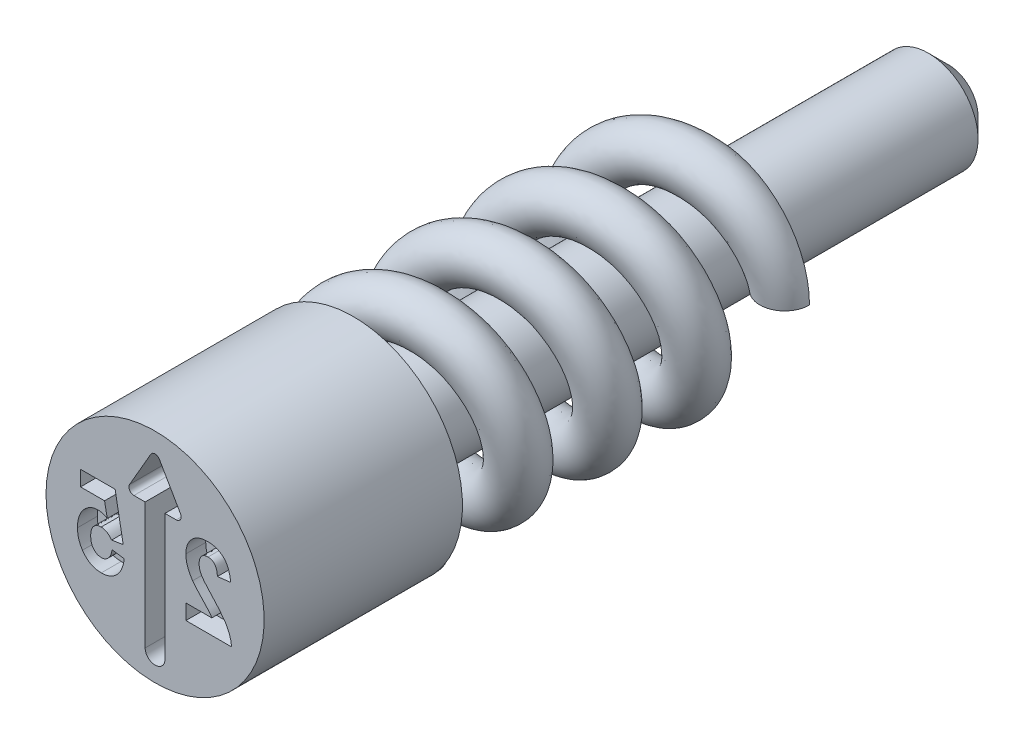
ISO-10303-21;
HEADER;
FILE_DESCRIPTION(('STEP AP214'),'2;1');
FILE_NAME('part.step','',(''),(''),'','','');
FILE_SCHEMA(('AUTOMOTIVE_DESIGN { 1 0 10303 214 1 1 1 1 }'));
ENDSEC;
DATA;
#1=APPLICATION_CONTEXT('core data for automotive mechanical design processes');
#2=APPLICATION_PROTOCOL_DEFINITION('international standard','automotive_design',2000,#1);
#3=PRODUCT_CONTEXT('',#1,'mechanical');
#4=PRODUCT('Part','Part','',(#3));
#5=PRODUCT_RELATED_PRODUCT_CATEGORY('part','',(#4));
#6=PRODUCT_DEFINITION_FORMATION('','',#4);
#7=PRODUCT_DEFINITION_CONTEXT('part definition',#1,'design');
#8=PRODUCT_DEFINITION('design','',#6,#7);
#9=PRODUCT_DEFINITION_SHAPE('','',#8);
#10=(LENGTH_UNIT() NAMED_UNIT(*) SI_UNIT(.MILLI.,.METRE.));
#11=(NAMED_UNIT(*) PLANE_ANGLE_UNIT() SI_UNIT($,.RADIAN.));
#12=(NAMED_UNIT(*) SI_UNIT($,.STERADIAN.) SOLID_ANGLE_UNIT());
#13=UNCERTAINTY_MEASURE_WITH_UNIT(LENGTH_MEASURE(1.E-05),#10,'distance_accuracy_value','');
#14=(GEOMETRIC_REPRESENTATION_CONTEXT(3) GLOBAL_UNCERTAINTY_ASSIGNED_CONTEXT((#13)) GLOBAL_UNIT_ASSIGNED_CONTEXT((#10,
#11,#12)) REPRESENTATION_CONTEXT('',''));
#15=CARTESIAN_POINT('',(0.,0.,0.));
#16=DIRECTION('',(0.,0.,1.));
#17=DIRECTION('',(1.,0.,0.));
#18=AXIS2_PLACEMENT_3D('',#15,#16,#17);
#19=CARTESIAN_POINT('',(0.,0.,0.));
#20=DIRECTION('',(0.,0.,-1.));
#21=DIRECTION('',(-1.,0.,0.));
#22=AXIS2_PLACEMENT_3D('',#19,#20,#21);
#23=PLANE('',#22);
#24=DIRECTION('',(-0.990256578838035,0.139254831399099,0.));
#25=VECTOR('',#24,1.);
#26=CARTESIAN_POINT('',(-0.310769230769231,-0.171153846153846,0.));
#27=LINE('',#26,#25);
#28=CARTESIAN_POINT('',(-0.310769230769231,-0.171153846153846,0.));
#29=VERTEX_POINT('',#28);
#30=CARTESIAN_POINT('',(-0.433846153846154,-0.153846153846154,0.));
#31=VERTEX_POINT('',#30);
#32=EDGE_CURVE('P0_E1146',#29,#31,#27,.T.);
#33=ORIENTED_EDGE('',*,*,#32,.F.);
#34=CARTESIAN_POINT('',(-0.542339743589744,-0.41025641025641,0.));
#35=CARTESIAN_POINT('',(-0.534423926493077,-0.410090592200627,0.));
#36=CARTESIAN_POINT('',(-0.518904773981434,-0.4097655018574,0.));
#37=CARTESIAN_POINT('',(-0.496190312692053,-0.406656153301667,0.));
#38=CARTESIAN_POINT('',(-0.474630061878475,-0.401505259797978,0.));
#39=CARTESIAN_POINT('',(-0.454118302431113,-0.394486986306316,0.));
#40=CARTESIAN_POINT('',(-0.434819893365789,-0.385258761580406,0.));
#41=CARTESIAN_POINT('',(-0.416558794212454,-0.374164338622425,0.));
#42=CARTESIAN_POINT('',(-0.399486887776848,-0.360918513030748,0.));
#43=CARTESIAN_POINT('',(-0.383656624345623,-0.345657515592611,0.));
#44=CARTESIAN_POINT('',(-0.369156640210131,-0.32872486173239,0.));
#45=CARTESIAN_POINT('',(-0.356067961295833,-0.310358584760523,0.));
#46=CARTESIAN_POINT('',(-0.344680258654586,-0.290511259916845,0.));
#47=CARTESIAN_POINT('',(-0.334793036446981,-0.269311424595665,0.));
#48=CARTESIAN_POINT('',(-0.32616836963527,-0.246819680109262,0.));
#49=CARTESIAN_POINT('',(-0.319577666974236,-0.222791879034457,0.));
#50=CARTESIAN_POINT('',(-0.314218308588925,-0.197479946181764,0.));
#51=CARTESIAN_POINT('',(-0.311933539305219,-0.18004077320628,0.));
#52=CARTESIAN_POINT('',(-0.310769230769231,-0.171153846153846,0.));
#53=B_SPLINE_CURVE_WITH_KNOTS('',3,(#34,#35,#36,#37,#38,#39,#40,#41,#42,#43,#44,#45,#46,#47,#48,
#49,#50,#51,#52),.UNSPECIFIED.,.F.,.F.,(4,1,1,1,1,1,1,1,1,1,1,1,1,1,1,1,4),(0.,
0.0643982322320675,0.126254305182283,0.186151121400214,0.244586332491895,0.302344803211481,
0.35990822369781,0.418173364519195,0.477826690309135,0.538564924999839,0.599365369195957,
0.66111133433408,0.72451567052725,0.789598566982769,0.85690310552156,0.927078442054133,1.),.UNSPECIFIED.);
#54=CARTESIAN_POINT('',(-0.542339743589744,-0.41025641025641,0.));
#55=VERTEX_POINT('',#54);
#56=EDGE_CURVE('P0_E32',#55,#29,#53,.T.);
#57=ORIENTED_EDGE('',*,*,#56,.F.);
#58=CARTESIAN_POINT('',(-0.73224358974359,-0.307371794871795,0.));
#59=CARTESIAN_POINT('',(-0.726436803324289,-0.315523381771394,0.));
#60=CARTESIAN_POINT('',(-0.715077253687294,-0.331469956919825,0.));
#61=CARTESIAN_POINT('',(-0.69541712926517,-0.352557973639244,0.));
#62=CARTESIAN_POINT('',(-0.674084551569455,-0.370451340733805,0.));
#63=CARTESIAN_POINT('',(-0.650915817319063,-0.384969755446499,0.));
#64=CARTESIAN_POINT('',(-0.626173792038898,-0.396449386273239,0.));
#65=CARTESIAN_POINT('',(-0.599688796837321,-0.404462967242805,0.));
#66=CARTESIAN_POINT('',(-0.571584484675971,-0.409398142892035,0.));
#67=CARTESIAN_POINT('',(-0.552243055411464,-0.409965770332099,0.));
#68=CARTESIAN_POINT('',(-0.542339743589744,-0.41025641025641,0.));
#69=B_SPLINE_CURVE_WITH_KNOTS('',3,(#58,#59,#60,#61,#62,#63,#64,#65,#66,#67,#68),.UNSPECIFIED.,
.F.,.F.,(4,1,1,1,1,1,1,1,4),(0.,0.132868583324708,0.25992470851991,0.381880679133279,
0.501806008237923,0.622167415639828,0.743179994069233,0.868501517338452,1.),.UNSPECIFIED.);
#70=CARTESIAN_POINT('',(-0.73224358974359,-0.307371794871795,0.));
#71=VERTEX_POINT('',#70);
#72=EDGE_CURVE('P0_E289',#71,#55,#69,.T.);
#73=ORIENTED_EDGE('',*,*,#72,.F.);
#74=CARTESIAN_POINT('',(-0.782564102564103,-0.136217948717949,0.));
#75=CARTESIAN_POINT('',(-0.782414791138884,-0.144076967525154,0.));
#76=CARTESIAN_POINT('',(-0.782118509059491,-0.159671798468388,0.));
#77=CARTESIAN_POINT('',(-0.779615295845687,-0.182690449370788,0.));
#78=CARTESIAN_POINT('',(-0.775787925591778,-0.205134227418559,0.));
#79=CARTESIAN_POINT('',(-0.770431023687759,-0.226939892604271,0.));
#80=CARTESIAN_POINT('',(-0.763054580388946,-0.248020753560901,0.));
#81=CARTESIAN_POINT('',(-0.754455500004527,-0.268500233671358,0.));
#82=CARTESIAN_POINT('',(-0.744354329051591,-0.288461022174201,0.));
#83=CARTESIAN_POINT('',(-0.736307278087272,-0.301026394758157,0.));
#84=CARTESIAN_POINT('',(-0.73224358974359,-0.307371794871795,0.));
#85=B_SPLINE_CURVE_WITH_KNOTS('',3,(#74,#75,#76,#77,#78,#79,#80,#81,#82,#83,#84),.UNSPECIFIED.,
.F.,.F.,(4,1,1,1,1,1,1,1,4),(0.,0.130195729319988,0.258350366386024,0.38321002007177,
0.507298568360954,0.629907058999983,0.752879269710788,0.875206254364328,1.),.UNSPECIFIED.);
#86=CARTESIAN_POINT('',(-0.782564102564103,-0.136217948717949,0.));
#87=VERTEX_POINT('',#86);
#88=EDGE_CURVE('P0_E292',#87,#71,#85,.T.);
#89=ORIENTED_EDGE('',*,*,#88,.F.);
#90=CARTESIAN_POINT('',(-0.572307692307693,0.123076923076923,0.));
#91=CARTESIAN_POINT('',(-0.579532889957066,0.122870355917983,0.));
#92=CARTESIAN_POINT('',(-0.593743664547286,0.122464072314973,0.));
#93=CARTESIAN_POINT('',(-0.614605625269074,0.118977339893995,0.));
#94=CARTESIAN_POINT('',(-0.634604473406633,0.113358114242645,0.));
#95=CARTESIAN_POINT('',(-0.65385178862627,0.105478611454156,0.));
#96=CARTESIAN_POINT('',(-0.672102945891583,0.0951155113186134,0.));
#97=CARTESIAN_POINT('',(-0.689632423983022,0.0826848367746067,0.));
#98=CARTESIAN_POINT('',(-0.706072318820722,0.0678014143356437,0.));
#99=CARTESIAN_POINT('',(-0.721760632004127,0.0510399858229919,0.));
#100=CARTESIAN_POINT('',(-0.736103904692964,0.0324918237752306,0.));
#101=CARTESIAN_POINT('',(-0.748446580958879,0.012263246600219,0.));
#102=CARTESIAN_POINT('',(-0.75912484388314,-0.00914064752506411,0.));
#103=CARTESIAN_POINT('',(-0.767794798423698,-0.0319473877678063,0.));
#104=CARTESIAN_POINT('',(-0.774299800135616,-0.0561884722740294,0.));
#105=CARTESIAN_POINT('',(-0.779103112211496,-0.0816828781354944,0.));
#106=CARTESIAN_POINT('',(-0.782038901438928,-0.108531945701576,0.));
#107=CARTESIAN_POINT('',(-0.782386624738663,-0.126862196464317,0.));
#108=CARTESIAN_POINT('',(-0.782564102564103,-0.136217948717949,0.));
#109=B_SPLINE_CURVE_WITH_KNOTS('',3,(#90,#91,#92,#93,#94,#95,#96,#97,#98,#99,#100,#101,#102,
#103,#104,#105,#106,#107,#108),.UNSPECIFIED.,.F.,.F.,(4,1,1,1,1,1,1,1,1,1,1,1,1,1,1,1,4),(0.,
0.0581744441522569,0.11441955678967,0.169867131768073,0.225249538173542,0.281511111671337,
0.338591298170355,0.398023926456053,0.459833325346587,0.523356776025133,0.586536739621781,
0.650432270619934,0.715810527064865,0.782730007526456,0.852361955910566,0.924645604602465,1.),.UNSPECIFIED.);
#110=CARTESIAN_POINT('',(-0.572307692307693,0.123076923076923,0.));
#111=VERTEX_POINT('',#110);
#112=EDGE_CURVE('P0_E1080',#111,#87,#109,.T.);
#113=ORIENTED_EDGE('',*,*,#112,.F.);
#114=CARTESIAN_POINT('',(-0.482083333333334,0.0947115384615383,0.));
#115=CARTESIAN_POINT('',(-0.489408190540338,0.0990218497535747,0.));
#116=CARTESIAN_POINT('',(-0.503683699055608,0.107422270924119,0.));
#117=CARTESIAN_POINT('',(-0.5263127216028,0.116455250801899,0.));
#118=CARTESIAN_POINT('',(-0.549225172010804,0.122050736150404,0.));
#119=CARTESIAN_POINT('',(-0.564638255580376,0.122735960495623,0.));
#120=CARTESIAN_POINT('',(-0.572307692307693,0.123076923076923,0.));
#121=B_SPLINE_CURVE_WITH_KNOTS('',3,(#114,#115,#116,#117,#118,#119,#120),.UNSPECIFIED.,.F.,.F.,
(4,1,1,1,4),(0.,0.265758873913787,0.517940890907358,0.760130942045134,1.),.UNSPECIFIED.);
#122=CARTESIAN_POINT('',(-0.482083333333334,0.0947115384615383,0.));
#123=VERTEX_POINT('',#122);
#124=EDGE_CURVE('P0_E1088',#123,#111,#121,.T.);
#125=ORIENTED_EDGE('',*,*,#124,.F.);
#126=DIRECTION('',(0.190541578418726,-0.98167912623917,0.));
#127=VECTOR('',#126,1.);
#128=CARTESIAN_POINT('',(-0.50948717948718,0.235897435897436,0.));
#129=LINE('',#128,#127);
#130=CARTESIAN_POINT('',(-0.50948717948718,0.235897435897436,0.));
#131=VERTEX_POINT('',#130);
#132=EDGE_CURVE('P0_E1096',#131,#123,#129,.T.);
#133=ORIENTED_EDGE('',*,*,#132,.F.);
#134=DIRECTION('',(1.,0.,0.));
#135=VECTOR('',#134,1.);
#136=CARTESIAN_POINT('',(-0.751794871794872,0.235897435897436,0.));
#137=LINE('',#136,#135);
#138=CARTESIAN_POINT('',(-0.751794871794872,0.235897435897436,0.));
#139=VERTEX_POINT('',#138);
#140=EDGE_CURVE('P0_E1102',#139,#131,#137,.T.);
#141=ORIENTED_EDGE('',*,*,#140,.F.);
#142=DIRECTION('',(0.,-1.,0.));
#143=VECTOR('',#142,1.);
#144=CARTESIAN_POINT('',(-0.751794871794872,0.38974358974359,0.));
#145=LINE('',#144,#143);
#146=CARTESIAN_POINT('',(-0.751794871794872,0.38974358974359,0.));
#147=VERTEX_POINT('',#146);
#148=EDGE_CURVE('P0_E1105',#147,#139,#145,.T.);
#149=ORIENTED_EDGE('',*,*,#148,.F.);
#150=DIRECTION('',(-1.,0.,0.));
#151=VECTOR('',#150,1.);
#152=CARTESIAN_POINT('',(-0.403076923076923,0.38974358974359,0.));
#153=LINE('',#152,#151);
#154=CARTESIAN_POINT('',(-0.403076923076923,0.38974358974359,0.));
#155=VERTEX_POINT('',#154);
#156=EDGE_CURVE('P0_E1108',#155,#147,#153,.T.);
#157=ORIENTED_EDGE('',*,*,#156,.F.);
#158=DIRECTION('',(-0.182267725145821,0.983248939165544,0.));
#159=VECTOR('',#158,1.);
#160=CARTESIAN_POINT('',(-0.321025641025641,-0.0528846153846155,0.));
#161=LINE('',#160,#159);
#162=CARTESIAN_POINT('',(-0.321025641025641,-0.0528846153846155,0.));
#163=VERTEX_POINT('',#162);
#164=EDGE_CURVE('P0_E1111',#163,#155,#161,.T.);
#165=ORIENTED_EDGE('',*,*,#164,.F.);
#166=DIRECTION('',(0.987254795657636,0.159147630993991,0.));
#167=VECTOR('',#166,1.);
#168=CARTESIAN_POINT('',(-0.438333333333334,-0.0717948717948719,0.));
#169=LINE('',#168,#167);
#170=CARTESIAN_POINT('',(-0.438333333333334,-0.0717948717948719,0.));
#171=VERTEX_POINT('',#170);
#172=EDGE_CURVE('P0_E1114',#171,#163,#169,.T.);
#173=ORIENTED_EDGE('',*,*,#172,.F.);
#174=CARTESIAN_POINT('',(-0.543461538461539,-0.0102564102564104,0.));
#175=CARTESIAN_POINT('',(-0.538639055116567,-0.0104390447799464,0.));
#176=CARTESIAN_POINT('',(-0.529014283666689,-0.0108035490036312,0.));
#177=CARTESIAN_POINT('',(-0.514786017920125,-0.0138337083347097,0.));
#178=CARTESIAN_POINT('',(-0.500923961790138,-0.0186332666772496,0.));
#179=CARTESIAN_POINT('',(-0.487503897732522,-0.0255070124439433,0.));
#180=CARTESIAN_POINT('',(-0.474470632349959,-0.0341946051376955,0.));
#181=CARTESIAN_POINT('',(-0.461938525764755,-0.044935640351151,0.));
#182=CARTESIAN_POINT('',(-0.449686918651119,-0.0574729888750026,0.));
#183=CARTESIAN_POINT('',(-0.442202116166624,-0.0669146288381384,0.));
#184=CARTESIAN_POINT('',(-0.438333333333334,-0.0717948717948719,0.));
#185=B_SPLINE_CURVE_WITH_KNOTS('',3,(#174,#175,#176,#177,#178,#179,#180,#181,#182,#183,#184),
.UNSPECIFIED.,.F.,.F.,(4,1,1,1,1,1,1,1,4),(0.,0.11431126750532,0.228143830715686,
0.343573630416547,0.461460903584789,0.584833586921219,0.714322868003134,0.852337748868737,1.),.UNSPECIFIED.);
#186=CARTESIAN_POINT('',(-0.543461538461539,-0.0102564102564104,0.));
#187=VERTEX_POINT('',#186);
#188=EDGE_CURVE('P0_E1117',#187,#171,#185,.T.);
#189=ORIENTED_EDGE('',*,*,#188,.F.);
#190=CARTESIAN_POINT('',(-0.64923076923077,-0.139583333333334,0.));
#191=CARTESIAN_POINT('',(-0.649125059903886,-0.134346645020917,0.));
#192=CARTESIAN_POINT('',(-0.648920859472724,-0.124230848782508,0.));
#193=CARTESIAN_POINT('',(-0.647734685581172,-0.109531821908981,0.));
#194=CARTESIAN_POINT('',(-0.645267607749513,-0.0958897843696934,0.));
#195=CARTESIAN_POINT('',(-0.642065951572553,-0.0831992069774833,0.));
#196=CARTESIAN_POINT('',(-0.638200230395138,-0.0713905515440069,0.));
#197=CARTESIAN_POINT('',(-0.632930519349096,-0.060799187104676,0.));
#198=CARTESIAN_POINT('',(-0.627090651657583,-0.0510598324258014,0.));
#199=CARTESIAN_POINT('',(-0.617876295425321,-0.0398855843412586,0.));
#200=CARTESIAN_POINT('',(-0.60473299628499,-0.0279651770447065,0.));
#201=CARTESIAN_POINT('',(-0.586347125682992,-0.0174809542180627,0.));
#202=CARTESIAN_POINT('',(-0.565520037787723,-0.0114229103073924,0.));
#203=CARTESIAN_POINT('',(-0.550979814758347,-0.0106539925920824,0.));
#204=CARTESIAN_POINT('',(-0.543461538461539,-0.0102564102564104,0.));
#205=B_SPLINE_CURVE_WITH_KNOTS('',3,(#190,#191,#192,#193,#194,#195,#196,#197,#198,#199,#200,
#201,#202,#203,#204),.UNSPECIFIED.,.F.,.F.,(4,1,1,1,1,1,1,1,1,1,1,1,4),(0.,0.0830930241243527,
0.160512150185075,0.233661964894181,0.302725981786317,0.368120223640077,0.430282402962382,
0.490023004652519,0.54786387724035,0.659488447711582,0.769548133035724,0.880840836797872,1.),.UNSPECIFIED.);
#206=CARTESIAN_POINT('',(-0.649230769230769,-0.139583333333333,0.));
#207=VERTEX_POINT('',#206);
#208=EDGE_CURVE('P0_E1122',#207,#187,#205,.T.);
#209=ORIENTED_EDGE('',*,*,#208,.F.);
#210=CARTESIAN_POINT('',(-0.54073717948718,-0.276923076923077,0.));
#211=CARTESIAN_POINT('',(-0.548107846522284,-0.276564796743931,0.));
#212=CARTESIAN_POINT('',(-0.562507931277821,-0.275864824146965,0.));
#213=CARTESIAN_POINT('',(-0.583141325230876,-0.269063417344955,0.));
#214=CARTESIAN_POINT('',(-0.601842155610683,-0.258127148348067,0.));
#215=CARTESIAN_POINT('',(-0.61560214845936,-0.245645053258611,0.));
#216=CARTESIAN_POINT('',(-0.625309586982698,-0.233706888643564,0.));
#217=CARTESIAN_POINT('',(-0.63168799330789,-0.223386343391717,0.));
#218=CARTESIAN_POINT('',(-0.63717427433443,-0.212062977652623,0.));
#219=CARTESIAN_POINT('',(-0.641702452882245,-0.199675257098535,0.));
#220=CARTESIAN_POINT('',(-0.644934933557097,-0.186099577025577,0.));
#221=CARTESIAN_POINT('',(-0.647571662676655,-0.171561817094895,0.));
#222=CARTESIAN_POINT('',(-0.648963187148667,-0.155903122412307,0.));
#223=CARTESIAN_POINT('',(-0.64913964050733,-0.145141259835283,0.));
#224=CARTESIAN_POINT('',(-0.649230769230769,-0.139583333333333,0.));
#225=B_SPLINE_CURVE_WITH_KNOTS('',3,(#210,#211,#212,#213,#214,#215,#216,#217,#218,#219,#220,
#221,#222,#223,#224),.UNSPECIFIED.,.F.,.F.,(4,1,1,1,1,1,1,1,1,1,1,1,4),(0.,0.111915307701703,
0.218649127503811,0.326887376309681,0.439744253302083,0.499311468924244,0.56068871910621,
0.623975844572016,0.690607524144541,0.761022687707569,0.836163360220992,0.915387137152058,1.),.UNSPECIFIED.);
#226=CARTESIAN_POINT('',(-0.54073717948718,-0.276923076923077,0.));
#227=VERTEX_POINT('',#226);
#228=EDGE_CURVE('P0_E1130',#227,#207,#225,.T.);
#229=ORIENTED_EDGE('',*,*,#228,.F.);
#230=CARTESIAN_POINT('',(-0.433846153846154,-0.153846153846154,0.));
#231=CARTESIAN_POINT('',(-0.43512455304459,-0.162878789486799,0.));
#232=CARTESIAN_POINT('',(-0.437576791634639,-0.180205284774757,0.));
#233=CARTESIAN_POINT('',(-0.445458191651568,-0.204371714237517,0.));
#234=CARTESIAN_POINT('',(-0.455971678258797,-0.225834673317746,0.));
#235=CARTESIAN_POINT('',(-0.469827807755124,-0.2438524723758,0.));
#236=CARTESIAN_POINT('',(-0.485516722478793,-0.258573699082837,0.));
#237=CARTESIAN_POINT('',(-0.502895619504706,-0.269058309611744,0.));
#238=CARTESIAN_POINT('',(-0.521403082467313,-0.275766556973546,0.));
#239=CARTESIAN_POINT('',(-0.534271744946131,-0.276536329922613,0.));
#240=CARTESIAN_POINT('',(-0.54073717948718,-0.276923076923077,0.));
#241=B_SPLINE_CURVE_WITH_KNOTS('',3,(#230,#231,#232,#233,#234,#235,#236,#237,#238,#239,#240),
.UNSPECIFIED.,.F.,.F.,(4,1,1,1,1,1,1,1,4),(0.,0.15300386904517,0.293493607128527,
0.425139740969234,0.552582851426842,0.673264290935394,0.784390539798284,0.891674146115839,1.),.UNSPECIFIED.);
#242=EDGE_CURVE('P0_E1138',#31,#227,#241,.T.);
#243=ORIENTED_EDGE('',*,*,#242,.F.);
#244=EDGE_LOOP('',(#33,#57,#73,#89,#113,#125,#133,#141,#149,#157,#165,#173,#189,#209,#229,#243));
#245=FACE_BOUND('',#244,.T.);
#246=DIRECTION('',(0.,-1.,0.));
#247=VECTOR('',#246,1.);
#248=CARTESIAN_POINT('',(0.310769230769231,-0.246153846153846,0.));
#249=LINE('',#248,#247);
#250=CARTESIAN_POINT('',(0.310769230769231,-0.246153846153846,0.));
#251=VERTEX_POINT('',#250);
#252=CARTESIAN_POINT('',(0.310769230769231,-0.4,0.));
#253=VERTEX_POINT('',#252);
#254=EDGE_CURVE('P0_E337',#251,#253,#249,.T.);
#255=ORIENTED_EDGE('',*,*,#254,.F.);
#256=DIRECTION('',(-1.,0.,0.));
#257=VECTOR('',#256,1.);
#258=CARTESIAN_POINT('',(0.572147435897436,-0.246153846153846,0.));
#259=LINE('',#258,#257);
#260=CARTESIAN_POINT('',(0.572147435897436,-0.246153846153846,0.));
#261=VERTEX_POINT('',#260);
#262=EDGE_CURVE('P0_E40',#261,#251,#259,.T.);
#263=ORIENTED_EDGE('',*,*,#262,.F.);
#264=CARTESIAN_POINT('',(0.378717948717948,-0.0182692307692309,0.));
#265=CARTESIAN_POINT('',(0.38082088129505,-0.0213389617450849,0.));
#266=CARTESIAN_POINT('',(0.385334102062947,-0.0279270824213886,0.));
#267=CARTESIAN_POINT('',(0.393276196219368,-0.0378849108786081,0.));
#268=CARTESIAN_POINT('',(0.402227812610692,-0.0490058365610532,0.));
#269=CARTESIAN_POINT('',(0.412509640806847,-0.0610112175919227,0.));
#270=CARTESIAN_POINT('',(0.424075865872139,-0.0739206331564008,0.));
#271=CARTESIAN_POINT('',(0.436665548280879,-0.087977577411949,0.));
#272=CARTESIAN_POINT('',(0.450918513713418,-0.102587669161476,0.));
#273=CARTESIAN_POINT('',(0.465614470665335,-0.118120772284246,0.));
#274=CARTESIAN_POINT('',(0.480556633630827,-0.133101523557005,0.));
#275=CARTESIAN_POINT('',(0.494099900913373,-0.147438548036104,0.));
#276=CARTESIAN_POINT('',(0.5063555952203,-0.160240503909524,0.));
#277=CARTESIAN_POINT('',(0.51704763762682,-0.171768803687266,0.));
#278=CARTESIAN_POINT('',(0.526332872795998,-0.181873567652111,0.));
#279=CARTESIAN_POINT('',(0.534254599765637,-0.190472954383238,0.));
#280=CARTESIAN_POINT('',(0.540539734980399,-0.197870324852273,0.));
#281=CARTESIAN_POINT('',(0.549408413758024,-0.20916106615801,0.));
#282=CARTESIAN_POINT('',(0.56057103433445,-0.224666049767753,0.));
#283=CARTESIAN_POINT('',(0.568388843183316,-0.239177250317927,0.));
#284=CARTESIAN_POINT('',(0.572147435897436,-0.246153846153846,0.));
#285=B_SPLINE_CURVE_WITH_KNOTS('',3,(#264,#265,#266,#267,#268,#269,#270,#271,#272,#273,#274,
#275,#276,#277,#278,#279,#280,#281,#282,#283,#284),.UNSPECIFIED.,.F.,.F.,(4,1,1,1,1,1,1,1,1,1,1,
1,1,1,1,1,1,1,4),(0.,0.0372293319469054,0.0798999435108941,0.127410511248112,0.180123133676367,
0.238064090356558,0.300892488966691,0.368957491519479,0.442313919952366,0.514902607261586,
0.580699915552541,0.639694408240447,0.692276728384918,0.73805927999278,0.777043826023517,
0.809286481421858,0.835170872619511,0.920754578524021,1.),.UNSPECIFIED.);
#286=CARTESIAN_POINT('',(0.378717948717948,-0.0182692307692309,0.));
#287=VERTEX_POINT('',#286);
#288=EDGE_CURVE('P0_E407',#287,#261,#285,.T.);
#289=ORIENTED_EDGE('',*,*,#288,.F.);
#290=CARTESIAN_POINT('',(0.310769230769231,0.182371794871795,0.));
#291=CARTESIAN_POINT('',(0.310938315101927,0.173655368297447,0.));
#292=CARTESIAN_POINT('',(0.311273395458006,0.156381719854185,0.));
#293=CARTESIAN_POINT('',(0.314430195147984,0.130811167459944,0.));
#294=CARTESIAN_POINT('',(0.319520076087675,0.105871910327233,0.));
#295=CARTESIAN_POINT('',(0.326892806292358,0.0814170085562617,0.));
#296=CARTESIAN_POINT('',(0.336263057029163,0.0569634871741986,0.));
#297=CARTESIAN_POINT('',(0.348118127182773,0.0322306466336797,0.));
#298=CARTESIAN_POINT('',(0.362172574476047,0.00686386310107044,0.));
#299=CARTESIAN_POINT('',(0.373102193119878,-0.00973867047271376,0.));
#300=CARTESIAN_POINT('',(0.378717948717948,-0.0182692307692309,0.));
#301=B_SPLINE_CURVE_WITH_KNOTS('',3,(#290,#291,#292,#293,#294,#295,#296,#297,#298,#299,#300),
.UNSPECIFIED.,.F.,.F.,(4,1,1,1,1,1,1,1,4),(0.,0.121430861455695,0.240643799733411,
0.358470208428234,0.475770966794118,0.596193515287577,0.723070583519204,0.857710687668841,1.),.UNSPECIFIED.);
#302=CARTESIAN_POINT('',(0.310769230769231,0.182371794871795,0.));
#303=VERTEX_POINT('',#302);
#304=EDGE_CURVE('P0_E399',#303,#287,#301,.T.);
#305=ORIENTED_EDGE('',*,*,#304,.F.);
#306=CARTESIAN_POINT('',(0.531121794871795,0.4,0.));
#307=CARTESIAN_POINT('',(0.522780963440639,0.399820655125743,0.));
#308=CARTESIAN_POINT('',(0.506527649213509,0.399471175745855,0.));
#309=CARTESIAN_POINT('',(0.482790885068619,0.396597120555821,0.));
#310=CARTESIAN_POINT('',(0.460466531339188,0.39153635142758,0.));
#311=CARTESIAN_POINT('',(0.439359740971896,0.384984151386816,0.));
#312=CARTESIAN_POINT('',(0.419811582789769,0.375993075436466,0.));
#313=CARTESIAN_POINT('',(0.401526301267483,0.365244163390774,0.));
#314=CARTESIAN_POINT('',(0.384715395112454,0.35235385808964,0.));
#315=CARTESIAN_POINT('',(0.369330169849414,0.337767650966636,0.));
#316=CARTESIAN_POINT('',(0.355622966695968,0.321752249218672,0.));
#317=CARTESIAN_POINT('',(0.343511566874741,0.304746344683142,0.));
#318=CARTESIAN_POINT('',(0.333355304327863,0.28669774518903,0.));
#319=CARTESIAN_POINT('',(0.325173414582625,0.267654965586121,0.));
#320=CARTESIAN_POINT('',(0.318750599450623,0.247691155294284,0.));
#321=CARTESIAN_POINT('',(0.314080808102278,0.226780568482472,0.));
#322=CARTESIAN_POINT('',(0.311341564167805,0.204880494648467,0.));
#323=CARTESIAN_POINT('',(0.310962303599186,0.189964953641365,0.));
#324=CARTESIAN_POINT('',(0.310769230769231,0.182371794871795,0.));
#325=B_SPLINE_CURVE_WITH_KNOTS('',3,(#306,#307,#308,#309,#310,#311,#312,#313,#314,#315,#316,
#317,#318,#319,#320,#321,#322,#323,#324),.UNSPECIFIED.,.F.,.F.,(4,1,1,1,1,1,1,1,1,1,1,1,1,1,1,1,
4),(0.,0.0718026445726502,0.139917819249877,0.205419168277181,0.268691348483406,
0.329822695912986,0.390243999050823,0.450956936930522,0.511795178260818,0.572457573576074,
0.632179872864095,0.69128264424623,0.750406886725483,0.81033250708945,0.871593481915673,
0.934631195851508,1.),.UNSPECIFIED.);
#326=CARTESIAN_POINT('',(0.531121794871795,0.4,0.));
#327=VERTEX_POINT('',#326);
#328=EDGE_CURVE('P0_E391',#327,#303,#325,.T.);
#329=ORIENTED_EDGE('',*,*,#328,.F.);
#330=CARTESIAN_POINT('',(0.762051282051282,0.158653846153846,0.));
#331=CARTESIAN_POINT('',(0.760980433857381,0.169039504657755,0.));
#332=CARTESIAN_POINT('',(0.758905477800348,0.18916353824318,0.));
#333=CARTESIAN_POINT('',(0.753308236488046,0.218036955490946,0.));
#334=CARTESIAN_POINT('',(0.746588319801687,0.244720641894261,0.));
#335=CARTESIAN_POINT('',(0.738028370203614,0.269108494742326,0.));
#336=CARTESIAN_POINT('',(0.728041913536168,0.291297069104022,0.));
#337=CARTESIAN_POINT('',(0.716301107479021,0.311116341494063,0.));
#338=CARTESIAN_POINT('',(0.703047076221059,0.328723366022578,0.));
#339=CARTESIAN_POINT('',(0.688082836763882,0.343963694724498,0.));
#340=CARTESIAN_POINT('',(0.671712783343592,0.357068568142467,0.));
#341=CARTESIAN_POINT('',(0.654607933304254,0.368731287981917,0.));
#342=CARTESIAN_POINT('',(0.636352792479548,0.378369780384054,0.));
#343=CARTESIAN_POINT('',(0.617163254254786,0.386197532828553,0.));
#344=CARTESIAN_POINT('',(0.597099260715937,0.392572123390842,0.));
#345=CARTESIAN_POINT('',(0.575914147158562,0.396751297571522,0.));
#346=CARTESIAN_POINT('',(0.553851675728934,0.399647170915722,0.));
#347=CARTESIAN_POINT('',(0.538770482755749,0.399881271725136,0.));
#348=CARTESIAN_POINT('',(0.531121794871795,0.4,0.));
#349=B_SPLINE_CURVE_WITH_KNOTS('',3,(#330,#331,#332,#333,#334,#335,#336,#337,#338,#339,#340,
#341,#342,#343,#344,#345,#346,#347,#348),.UNSPECIFIED.,.F.,.F.,(4,1,1,1,1,1,1,1,1,1,1,1,1,1,1,1,
4),(0.,0.0836347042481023,0.16205689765,0.235468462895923,0.30397920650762,0.368923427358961,
0.430156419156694,0.488208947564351,0.545123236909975,0.600818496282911,0.656031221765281,
0.710804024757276,0.765898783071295,0.821956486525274,0.879217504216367,0.938743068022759,1.),.UNSPECIFIED.);
#350=CARTESIAN_POINT('',(0.762051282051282,0.158653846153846,0.));
#351=VERTEX_POINT('',#350);
#352=EDGE_CURVE('P0_E386',#351,#327,#349,.T.);
#353=ORIENTED_EDGE('',*,*,#352,.F.);
#354=DIRECTION('',(0.993678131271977,0.112266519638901,0.));
#355=VECTOR('',#354,1.);
#356=CARTESIAN_POINT('',(0.628717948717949,0.143589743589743,0.));
#357=LINE('',#356,#355);
#358=CARTESIAN_POINT('',(0.628717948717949,0.143589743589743,0.));
#359=VERTEX_POINT('',#358);
#360=EDGE_CURVE('P0_E380',#359,#351,#357,.T.);
#361=ORIENTED_EDGE('',*,*,#360,.F.);
#362=CARTESIAN_POINT('',(0.53400641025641,0.266666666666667,0.));
#363=CARTESIAN_POINT('',(0.540613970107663,0.266355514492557,0.));
#364=CARTESIAN_POINT('',(0.553366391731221,0.265754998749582,0.));
#365=CARTESIAN_POINT('',(0.571503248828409,0.260331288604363,0.));
#366=CARTESIAN_POINT('',(0.587395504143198,0.251098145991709,0.));
#367=CARTESIAN_POINT('',(0.598755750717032,0.240613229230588,0.));
#368=CARTESIAN_POINT('',(0.606399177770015,0.230397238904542,0.));
#369=CARTESIAN_POINT('',(0.611523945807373,0.221431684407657,0.));
#370=CARTESIAN_POINT('',(0.616191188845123,0.211388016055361,0.));
#371=CARTESIAN_POINT('',(0.619961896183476,0.200073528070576,0.));
#372=CARTESIAN_POINT('',(0.623185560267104,0.187653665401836,0.));
#373=CARTESIAN_POINT('',(0.625685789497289,0.17404589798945,0.));
#374=CARTESIAN_POINT('',(0.627634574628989,0.159229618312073,0.));
#375=CARTESIAN_POINT('',(0.628347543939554,0.148937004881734,0.));
#376=CARTESIAN_POINT('',(0.628717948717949,0.143589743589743,0.));
#377=B_SPLINE_CURVE_WITH_KNOTS('',3,(#362,#363,#364,#365,#366,#367,#368,#369,#370,#371,#372,
#373,#374,#375,#376),.UNSPECIFIED.,.F.,.F.,(4,1,1,1,1,1,1,1,1,1,1,1,4),(0.,0.113180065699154,
0.218434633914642,0.32108732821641,0.426146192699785,0.481136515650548,0.539455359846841,
0.603018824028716,0.670840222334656,0.743752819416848,0.823023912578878,0.908056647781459,1.),.UNSPECIFIED.);
#378=CARTESIAN_POINT('',(0.53400641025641,0.266666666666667,0.));
#379=VERTEX_POINT('',#378);
#380=EDGE_CURVE('P0_E372',#379,#359,#377,.T.);
#381=ORIENTED_EDGE('',*,*,#380,.F.);
#382=CARTESIAN_POINT('',(0.444102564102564,0.161698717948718,0.));
#383=CARTESIAN_POINT('',(0.444330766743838,0.169681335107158,0.));
#384=CARTESIAN_POINT('',(0.444762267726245,0.184775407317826,0.));
#385=CARTESIAN_POINT('',(0.449254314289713,0.206008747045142,0.));
#386=CARTESIAN_POINT('',(0.456803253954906,0.224317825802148,0.));
#387=CARTESIAN_POINT('',(0.467287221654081,0.23976439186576,0.));
#388=CARTESIAN_POINT('',(0.48072137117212,0.251723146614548,0.));
#389=CARTESIAN_POINT('',(0.49632401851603,0.26080059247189,0.));
#390=CARTESIAN_POINT('',(0.514551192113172,0.265646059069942,0.));
#391=CARTESIAN_POINT('',(0.527356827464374,0.266317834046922,0.));
#392=CARTESIAN_POINT('',(0.53400641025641,0.266666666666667,0.));
#393=B_SPLINE_CURVE_WITH_KNOTS('',3,(#382,#383,#384,#385,#386,#387,#388,#389,#390,#391,#392),
.UNSPECIFIED.,.F.,.F.,(4,1,1,1,1,1,1,1,4),(0.,0.152713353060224,0.288760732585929,
0.413023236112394,0.529943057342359,0.642943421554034,0.754737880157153,0.872642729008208,1.),.UNSPECIFIED.);
#394=CARTESIAN_POINT('',(0.444102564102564,0.161698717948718,0.));
#395=VERTEX_POINT('',#394);
#396=EDGE_CURVE('P0_E364',#395,#379,#393,.T.);
#397=ORIENTED_EDGE('',*,*,#396,.F.);
#398=CARTESIAN_POINT('',(0.471185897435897,0.0692307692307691,0.));
#399=CARTESIAN_POINT('',(0.467041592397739,0.0769401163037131,0.));
#400=CARTESIAN_POINT('',(0.459012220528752,0.0918765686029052,0.));
#401=CARTESIAN_POINT('',(0.45040844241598,0.115231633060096,0.));
#402=CARTESIAN_POINT('',(0.44523639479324,0.138501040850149,0.));
#403=CARTESIAN_POINT('',(0.444477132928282,0.154035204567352,0.));
#404=CARTESIAN_POINT('',(0.444102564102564,0.161698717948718,0.));
#405=B_SPLINE_CURVE_WITH_KNOTS('',3,(#398,#399,#400,#401,#402,#403,#404),.UNSPECIFIED.,.F.,.F.,
(4,1,1,1,4),(0.,0.269282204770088,0.52172003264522,0.764048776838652,1.),.UNSPECIFIED.);
#406=CARTESIAN_POINT('',(0.471185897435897,0.0692307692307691,0.));
#407=VERTEX_POINT('',#406);
#408=EDGE_CURVE('P0_E356',#407,#395,#405,.T.);
#409=ORIENTED_EDGE('',*,*,#408,.F.);
#410=CARTESIAN_POINT('',(0.58,-0.0599358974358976,0.));
#411=CARTESIAN_POINT('',(0.572937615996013,-0.052307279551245,0.));
#412=CARTESIAN_POINT('',(0.559503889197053,-0.0377964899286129,0.));
#413=CARTESIAN_POINT('',(0.540483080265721,-0.0169054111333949,0.));
#414=CARTESIAN_POINT('',(0.523692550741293,0.00214712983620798,0.));
#415=CARTESIAN_POINT('',(0.508977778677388,0.0192224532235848,0.));
#416=CARTESIAN_POINT('',(0.49635973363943,0.034347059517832,0.));
#417=CARTESIAN_POINT('',(0.485954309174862,0.0475716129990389,0.));
#418=CARTESIAN_POINT('',(0.477672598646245,0.0589333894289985,0.));
#419=CARTESIAN_POINT('',(0.473184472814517,0.0660581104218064,0.));
#420=CARTESIAN_POINT('',(0.471185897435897,0.0692307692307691,0.));
#421=B_SPLINE_CURVE_WITH_KNOTS('',3,(#410,#411,#412,#413,#414,#415,#416,#417,#418,#419,#420),
.UNSPECIFIED.,.F.,.F.,(4,1,1,1,1,1,1,1,4),(0.,0.184436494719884,0.350826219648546,
0.501230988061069,0.634967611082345,0.750729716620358,0.850641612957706,0.933490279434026,1.),.UNSPECIFIED.);
#422=CARTESIAN_POINT('',(0.58,-0.0599358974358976,0.));
#423=VERTEX_POINT('',#422);
#424=EDGE_CURVE('P0_E348',#423,#407,#421,.T.);
#425=ORIENTED_EDGE('',*,*,#424,.F.);
#426=CARTESIAN_POINT('',(0.772307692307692,-0.4,0.));
#427=CARTESIAN_POINT('',(0.770719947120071,-0.386862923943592,0.));
#428=CARTESIAN_POINT('',(0.76755287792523,-0.360658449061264,0.));
#429=CARTESIAN_POINT('',(0.757769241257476,-0.322294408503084,0.));
#430=CARTESIAN_POINT('',(0.74483593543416,-0.284830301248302,0.));
#431=CARTESIAN_POINT('',(0.73061727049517,-0.254379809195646,0.));
#432=CARTESIAN_POINT('',(0.716808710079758,-0.229613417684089,0.));
#433=CARTESIAN_POINT('',(0.703871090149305,-0.209651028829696,0.));
#434=CARTESIAN_POINT('',(0.688779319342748,-0.188175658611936,0.));
#435=CARTESIAN_POINT('',(0.671423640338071,-0.165275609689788,0.));
#436=CARTESIAN_POINT('',(0.651843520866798,-0.140925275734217,0.));
#437=CARTESIAN_POINT('',(0.630007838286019,-0.115147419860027,0.));
#438=CARTESIAN_POINT('',(0.605971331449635,-0.0878420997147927,0.));
#439=CARTESIAN_POINT('',(0.58886007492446,-0.0694560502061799,0.));
#440=CARTESIAN_POINT('',(0.58,-0.0599358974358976,0.));
#441=B_SPLINE_CURVE_WITH_KNOTS('',3,(#426,#427,#428,#429,#430,#431,#432,#433,#434,#435,#436,
#437,#438,#439,#440),.UNSPECIFIED.,.F.,.F.,(4,1,1,1,1,1,1,1,1,1,1,1,4),(0.,0.0994452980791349,
0.198363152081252,0.297103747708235,0.397237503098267,0.450667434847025,0.510300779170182,
0.576071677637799,0.648078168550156,0.72639487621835,0.811079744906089,0.902178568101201,1.),.UNSPECIFIED.);
#442=CARTESIAN_POINT('',(0.772307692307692,-0.4,0.));
#443=VERTEX_POINT('',#442);
#444=EDGE_CURVE('P0_E343',#443,#423,#441,.T.);
#445=ORIENTED_EDGE('',*,*,#444,.F.);
#446=DIRECTION('',(1.,0.,0.));
#447=VECTOR('',#446,1.);
#448=CARTESIAN_POINT('',(0.310769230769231,-0.4,0.));
#449=LINE('',#448,#447);
#450=EDGE_CURVE('P0_E340',#253,#443,#449,.T.);
#451=ORIENTED_EDGE('',*,*,#450,.F.);
#452=EDGE_LOOP('',(#255,#263,#289,#305,#329,#353,#361,#381,#397,#409,#425,#445,#451));
#453=FACE_BOUND('',#452,.T.);
#454=CARTESIAN_POINT('',(0.,0.,0.));
#455=DIRECTION('',(0.,0.,-1.));
#456=DIRECTION('',(-1.,0.,0.));
#457=AXIS2_PLACEMENT_3D('',#454,#455,#456);
#458=CIRCLE('',#457,1.1);
#459=CARTESIAN_POINT('',(-1.1,0.,0.));
#460=VERTEX_POINT('',#459);
#461=EDGE_CURVE('P0_E500',#460,#460,#458,.T.);
#462=ORIENTED_EDGE('',*,*,#461,.F.);
#463=EDGE_LOOP('',(#462));
#464=FACE_BOUND('',#463,.T.);
#465=DIRECTION('',(0.,1.,0.));
#466=VECTOR('',#465,1.);
#467=CARTESIAN_POINT('',(-0.0999999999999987,0.,0.));
#468=LINE('',#467,#466);
#469=CARTESIAN_POINT('',(-0.0999999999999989,-0.84472218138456,0.));
#470=VERTEX_POINT('',#469);
#471=CARTESIAN_POINT('',(-0.0999999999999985,0.43038475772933,0.));
#472=VERTEX_POINT('',#471);
#473=EDGE_CURVE('P0_E467',#470,#472,#468,.T.);
#474=ORIENTED_EDGE('',*,*,#473,.T.);
#475=DIRECTION('',(-1.,0.,0.));
#476=VECTOR('',#475,1.);
#477=CARTESIAN_POINT('',(0.,0.43038475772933,0.));
#478=LINE('',#477,#476);
#479=CARTESIAN_POINT('',(-0.213397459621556,0.43038475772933,0.));
#480=VERTEX_POINT('',#479);
#481=EDGE_CURVE('P0_E448',#472,#480,#478,.T.);
#482=ORIENTED_EDGE('',*,*,#481,.T.);
#483=CARTESIAN_POINT('',(-0.213397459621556,0.48038475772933,0.));
#484=DIRECTION('',(0.,0.,-1.));
#485=DIRECTION('',(-1.,0.,0.));
#486=AXIS2_PLACEMENT_3D('',#483,#484,#485);
#487=CIRCLE('',#486,0.05);
#488=CARTESIAN_POINT('',(-0.256698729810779,0.505384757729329,0.));
#489=VERTEX_POINT('',#488);
#490=EDGE_CURVE('P0_E529',#480,#489,#487,.T.);
#491=ORIENTED_EDGE('',*,*,#490,.T.);
#492=DIRECTION('',(0.499999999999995,0.866025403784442,0.));
#493=VECTOR('',#492,1.);
#494=CARTESIAN_POINT('',(-0.411362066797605,0.237499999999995,0.));
#495=LINE('',#494,#493);
#496=CARTESIAN_POINT('',(-0.0433012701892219,0.874999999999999,0.));
#497=VERTEX_POINT('',#496);
#498=EDGE_CURVE('P0_E483',#489,#497,#495,.T.);
#499=ORIENTED_EDGE('',*,*,#498,.T.);
#500=CARTESIAN_POINT('',(0.,0.849999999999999,0.));
#501=DIRECTION('',(0.,0.,-1.));
#502=DIRECTION('',(-1.,0.,0.));
#503=AXIS2_PLACEMENT_3D('',#500,#501,#502);
#504=CIRCLE('',#503,0.05);
#505=CARTESIAN_POINT('',(0.0433012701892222,0.874999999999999,0.));
#506=VERTEX_POINT('',#505);
#507=EDGE_CURVE('P0_E527',#497,#506,#504,.T.);
#508=ORIENTED_EDGE('',*,*,#507,.T.);
#509=DIRECTION('',(-0.499999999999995,0.866025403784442,0.));
#510=VECTOR('',#509,1.);
#511=CARTESIAN_POINT('',(0.411362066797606,0.237499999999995,0.));
#512=LINE('',#511,#510);
#513=CARTESIAN_POINT('',(0.256698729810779,0.505384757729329,0.));
#514=VERTEX_POINT('',#513);
#515=EDGE_CURVE('P0_E480',#514,#506,#512,.T.);
#516=ORIENTED_EDGE('',*,*,#515,.F.);
#517=CARTESIAN_POINT('',(0.213397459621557,0.48038475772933,0.));
#518=DIRECTION('',(0.,0.,-1.));
#519=DIRECTION('',(-1.,0.,0.));
#520=AXIS2_PLACEMENT_3D('',#517,#518,#519);
#521=CIRCLE('',#520,0.05);
#522=CARTESIAN_POINT('',(0.213397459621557,0.43038475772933,0.));
#523=VERTEX_POINT('',#522);
#524=EDGE_CURVE('P0_E531',#514,#523,#521,.T.);
#525=ORIENTED_EDGE('',*,*,#524,.T.);
#526=DIRECTION('',(1.,0.,0.));
#527=VECTOR('',#526,1.);
#528=CARTESIAN_POINT('',(0.,0.43038475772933,0.));
#529=LINE('',#528,#527);
#530=CARTESIAN_POINT('',(0.0999999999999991,0.43038475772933,0.));
#531=VERTEX_POINT('',#530);
#532=EDGE_CURVE('P0_E477',#531,#523,#529,.T.);
#533=ORIENTED_EDGE('',*,*,#532,.F.);
#534=DIRECTION('',(0.,1.,0.));
#535=VECTOR('',#534,1.);
#536=CARTESIAN_POINT('',(0.0999999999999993,0.,0.));
#537=LINE('',#536,#535);
#538=CARTESIAN_POINT('',(0.0999999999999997,-0.84472218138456,0.));
#539=VERTEX_POINT('',#538);
#540=EDGE_CURVE('P0_E474',#539,#531,#537,.T.);
#541=ORIENTED_EDGE('',*,*,#540,.F.);
#542=CARTESIAN_POINT('',(0.,-0.84472218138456,0.));
#543=DIRECTION('',(0.,0.,1.));
#544=DIRECTION('',(1.,0.,0.));
#545=AXIS2_PLACEMENT_3D('',#542,#543,#544);
#546=CIRCLE('',#545,0.0999999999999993);
#547=EDGE_CURVE('P0_E470',#470,#539,#546,.T.);
#548=ORIENTED_EDGE('',*,*,#547,.F.);
#549=EDGE_LOOP('',(#474,#482,#491,#499,#508,#516,#525,#533,#541,#548));
#550=FACE_BOUND('',#549,.T.);
#551=ADVANCED_FACE('P0_F17',(#245,#453,#464,#550),#23,.F.);
#552=CARTESIAN_POINT('',(0.,0.,-2.));
#553=DIRECTION('',(0.,0.,1.));
#554=DIRECTION('',(1.,0.,0.));
#555=AXIS2_PLACEMENT_3D('',#552,#553,#554);
#556=PLANE('',#555);
#557=CARTESIAN_POINT('',(0.,0.,-2.));
#558=DIRECTION('',(0.,0.,-1.));
#559=DIRECTION('',(-1.,0.,0.));
#560=AXIS2_PLACEMENT_3D('',#557,#558,#559);
#561=CIRCLE('',#560,0.499999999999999);
#562=CARTESIAN_POINT('',(-0.5,0.,-2.));
#563=VERTEX_POINT('',#562);
#564=EDGE_CURVE('P0_E503',#563,#563,#561,.T.);
#565=ORIENTED_EDGE('',*,*,#564,.F.);
#566=EDGE_LOOP('',(#565));
#567=FACE_BOUND('',#566,.T.);
#568=CARTESIAN_POINT('',(0.,0.,-2.));
#569=DIRECTION('',(0.,0.,-1.));
#570=DIRECTION('',(-1.,0.,0.));
#571=AXIS2_PLACEMENT_3D('',#568,#569,#570);
#572=CIRCLE('',#571,1.1);
#573=CARTESIAN_POINT('',(-1.1,0.,-2.));
#574=VERTEX_POINT('',#573);
#575=EDGE_CURVE('P0_E491',#574,#574,#572,.T.);
#576=ORIENTED_EDGE('',*,*,#575,.T.);
#577=EDGE_LOOP('',(#576));
#578=FACE_BOUND('',#577,.T.);
#579=ADVANCED_FACE('P0_F550',(#567,#578),#556,.F.);
#580=CARTESIAN_POINT('',(0.,0.,0.));
#581=DIRECTION('',(0.,0.,-1.));
#582=DIRECTION('',(-1.,0.,0.));
#583=AXIS2_PLACEMENT_3D('',#580,#581,#582);
#584=CYLINDRICAL_SURFACE('',#583,0.5);
#585=CARTESIAN_POINT('',(0.,0.,-7.8));
#586=DIRECTION('',(0.,0.,-1.));
#587=DIRECTION('',(-1.,0.,0.));
#588=AXIS2_PLACEMENT_3D('',#585,#586,#587);
#589=CIRCLE('',#588,0.5);
#590=CARTESIAN_POINT('',(-0.500000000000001,0.,-7.8));
#591=VERTEX_POINT('',#590);
#592=EDGE_CURVE('P0_E11',#591,#591,#589,.F.);
#593=ORIENTED_EDGE('',*,*,#592,.T.);
#594=EDGE_LOOP('',(#593));
#595=FACE_BOUND('',#594,.T.);
#596=ORIENTED_EDGE('',*,*,#564,.T.);
#597=EDGE_LOOP('',(#596));
#598=FACE_BOUND('',#597,.T.);
#599=ADVANCED_FACE('P0_F556',(#595,#598),#584,.T.);
#600=CARTESIAN_POINT('',(0.,0.,-8.));
#601=DIRECTION('',(0.,0.,-1.));
#602=DIRECTION('',(-1.,0.,0.));
#603=AXIS2_PLACEMENT_3D('',#600,#601,#602);
#604=PLANE('',#603);
#605=CARTESIAN_POINT('',(0.,0.,-8.));
#606=DIRECTION('',(0.,0.,-1.));
#607=DIRECTION('',(-1.,0.,0.));
#608=AXIS2_PLACEMENT_3D('',#605,#606,#607);
#609=CIRCLE('',#608,0.300000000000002);
#610=CARTESIAN_POINT('',(-0.300000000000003,0.,-8.));
#611=VERTEX_POINT('',#610);
#612=EDGE_CURVE('P0_E25',#611,#611,#609,.T.);
#613=ORIENTED_EDGE('',*,*,#612,.T.);
#614=EDGE_LOOP('',(#613));
#615=FACE_BOUND('',#614,.T.);
#616=ADVANCED_FACE('P0_F535',(#615),#604,.T.);
#617=CARTESIAN_POINT('',(0.,0.,0.));
#618=DIRECTION('',(0.,0.,-1.));
#619=DIRECTION('',(-1.,0.,0.));
#620=AXIS2_PLACEMENT_3D('',#617,#618,#619);
#621=CYLINDRICAL_SURFACE('',#620,1.1);
#622=ORIENTED_EDGE('',*,*,#575,.F.);
#623=EDGE_LOOP('',(#622));
#624=FACE_BOUND('',#623,.T.);
#625=ORIENTED_EDGE('',*,*,#461,.T.);
#626=EDGE_LOOP('',(#625));
#627=FACE_BOUND('',#626,.T.);
#628=ADVANCED_FACE('P0_F562',(#624,#627),#621,.T.);
#629=CARTESIAN_POINT('',(-0.0999999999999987,0.,-0.4));
#630=DIRECTION('',(1.,0.,0.));
#631=DIRECTION('',(0.,1.,0.));
#632=AXIS2_PLACEMENT_3D('',#629,#630,#631);
#633=PLANE('',#632);
#634=ORIENTED_EDGE('',*,*,#473,.F.);
#635=DIRECTION('',(0.,0.,1.));
#636=VECTOR('',#635,1.);
#637=CARTESIAN_POINT('',(-0.0999999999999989,-0.84472218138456,-0.4));
#638=LINE('',#637,#636);
#639=CARTESIAN_POINT('',(-0.0999999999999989,-0.84472218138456,-0.4));
#640=VERTEX_POINT('',#639);
#641=EDGE_CURVE('P0_E466',#640,#470,#638,.T.);
#642=ORIENTED_EDGE('',*,*,#641,.F.);
#643=DIRECTION('',(0.,1.,0.));
#644=VECTOR('',#643,1.);
#645=CARTESIAN_POINT('',(-0.0999999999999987,0.,-0.4));
#646=LINE('',#645,#644);
#647=CARTESIAN_POINT('',(-0.0999999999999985,0.43038475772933,-0.4));
#648=VERTEX_POINT('',#647);
#649=EDGE_CURVE('P0_E444',#640,#648,#646,.T.);
#650=ORIENTED_EDGE('',*,*,#649,.T.);
#651=DIRECTION('',(0.,0.,1.));
#652=VECTOR('',#651,1.);
#653=CARTESIAN_POINT('',(-0.0999999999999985,0.43038475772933,-0.4));
#654=LINE('',#653,#652);
#655=EDGE_CURVE('P0_E488',#648,#472,#654,.T.);
#656=ORIENTED_EDGE('',*,*,#655,.T.);
#657=EDGE_LOOP('',(#634,#642,#650,#656));
#658=FACE_BOUND('',#657,.T.);
#659=ADVANCED_FACE('P0_F588',(#658),#633,.T.);
#660=CARTESIAN_POINT('',(0.,0.43038475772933,-0.4));
#661=DIRECTION('',(0.,1.,0.));
#662=DIRECTION('',(0.,0.,1.));
#663=AXIS2_PLACEMENT_3D('',#660,#661,#662);
#664=PLANE('',#663);
#665=DIRECTION('',(-1.,0.,0.));
#666=VECTOR('',#665,1.);
#667=CARTESIAN_POINT('',(0.,0.43038475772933,-0.4));
#668=LINE('',#667,#666);
#669=CARTESIAN_POINT('',(-0.213397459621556,0.43038475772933,-0.4));
#670=VERTEX_POINT('',#669);
#671=EDGE_CURVE('P0_E463',#648,#670,#668,.T.);
#672=ORIENTED_EDGE('',*,*,#671,.T.);
#673=DIRECTION('',(0.,0.,1.));
#674=VECTOR('',#673,1.);
#675=CARTESIAN_POINT('',(-0.213397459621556,0.43038475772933,0.));
#676=LINE('',#675,#674);
#677=EDGE_CURVE('P0_E522',#670,#480,#676,.T.);
#678=ORIENTED_EDGE('',*,*,#677,.T.);
#679=ORIENTED_EDGE('',*,*,#481,.F.);
#680=ORIENTED_EDGE('',*,*,#655,.F.);
#681=EDGE_LOOP('',(#672,#678,#679,#680));
#682=FACE_BOUND('',#681,.T.);
#683=ADVANCED_FACE('P0_F586',(#682),#664,.T.);
#684=CARTESIAN_POINT('',(-0.411362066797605,0.237499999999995,-0.4));
#685=DIRECTION('',(0.866025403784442,-0.499999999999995,0.));
#686=DIRECTION('',(0.499999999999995,0.866025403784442,0.));
#687=AXIS2_PLACEMENT_3D('',#684,#685,#686);
#688=PLANE('',#687);
#689=DIRECTION('',(0.499999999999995,0.866025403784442,0.));
#690=VECTOR('',#689,1.);
#691=CARTESIAN_POINT('',(-0.411362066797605,0.237499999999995,-0.4));
#692=LINE('',#691,#690);
#693=CARTESIAN_POINT('',(-0.256698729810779,0.505384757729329,-0.4));
#694=VERTEX_POINT('',#693);
#695=CARTESIAN_POINT('',(-0.0433012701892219,0.874999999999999,-0.4));
#696=VERTEX_POINT('',#695);
#697=EDGE_CURVE('P0_E460',#694,#696,#692,.T.);
#698=ORIENTED_EDGE('',*,*,#697,.T.);
#699=DIRECTION('',(0.,0.,1.));
#700=VECTOR('',#699,1.);
#701=CARTESIAN_POINT('',(-0.0433012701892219,0.874999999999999,-0.4));
#702=LINE('',#701,#700);
#703=EDGE_CURVE('P0_E508',#696,#497,#702,.T.);
#704=ORIENTED_EDGE('',*,*,#703,.T.);
#705=ORIENTED_EDGE('',*,*,#498,.F.);
#706=DIRECTION('',(0.,0.,1.));
#707=VECTOR('',#706,1.);
#708=CARTESIAN_POINT('',(-0.256698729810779,0.505384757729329,-0.4));
#709=LINE('',#708,#707);
#710=EDGE_CURVE('P0_E506',#489,#694,#709,.F.);
#711=ORIENTED_EDGE('',*,*,#710,.T.);
#712=EDGE_LOOP('',(#698,#704,#705,#711));
#713=FACE_BOUND('',#712,.T.);
#714=ADVANCED_FACE('P0_F613',(#713),#688,.T.);
#715=CARTESIAN_POINT('',(0.411362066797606,0.237499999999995,-0.4));
#716=DIRECTION('',(0.866025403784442,0.499999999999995,0.));
#717=DIRECTION('',(-0.499999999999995,0.866025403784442,0.));
#718=AXIS2_PLACEMENT_3D('',#715,#716,#717);
#719=PLANE('',#718);
#720=ORIENTED_EDGE('',*,*,#515,.T.);
#721=DIRECTION('',(0.,0.,1.));
#722=VECTOR('',#721,1.);
#723=CARTESIAN_POINT('',(0.0433012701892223,0.874999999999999,-0.4));
#724=LINE('',#723,#722);
#725=CARTESIAN_POINT('',(0.0433012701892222,0.874999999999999,-0.4));
#726=VERTEX_POINT('',#725);
#727=EDGE_CURVE('P0_E514',#506,#726,#724,.F.);
#728=ORIENTED_EDGE('',*,*,#727,.T.);
#729=DIRECTION('',(-0.499999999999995,0.866025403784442,0.));
#730=VECTOR('',#729,1.);
#731=CARTESIAN_POINT('',(0.411362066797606,0.237499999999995,-0.4));
#732=LINE('',#731,#730);
#733=CARTESIAN_POINT('',(0.256698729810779,0.505384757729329,-0.4));
#734=VERTEX_POINT('',#733);
#735=EDGE_CURVE('P0_E457',#734,#726,#732,.T.);
#736=ORIENTED_EDGE('',*,*,#735,.F.);
#737=DIRECTION('',(0.,0.,1.));
#738=VECTOR('',#737,1.);
#739=CARTESIAN_POINT('',(0.256698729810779,0.505384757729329,0.));
#740=LINE('',#739,#738);
#741=EDGE_CURVE('P0_E511',#734,#514,#740,.T.);
#742=ORIENTED_EDGE('',*,*,#741,.T.);
#743=EDGE_LOOP('',(#720,#728,#736,#742));
#744=FACE_BOUND('',#743,.T.);
#745=ADVANCED_FACE('P0_F608',(#744),#719,.F.);
#746=CARTESIAN_POINT('',(0.,0.43038475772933,-0.4));
#747=DIRECTION('',(0.,-1.,0.));
#748=DIRECTION('',(0.,0.,-1.));
#749=AXIS2_PLACEMENT_3D('',#746,#747,#748);
#750=PLANE('',#749);
#751=ORIENTED_EDGE('',*,*,#532,.T.);
#752=DIRECTION('',(0.,0.,1.));
#753=VECTOR('',#752,1.);
#754=CARTESIAN_POINT('',(0.213397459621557,0.43038475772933,-0.4));
#755=LINE('',#754,#753);
#756=CARTESIAN_POINT('',(0.213397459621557,0.43038475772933,-0.4));
#757=VERTEX_POINT('',#756);
#758=EDGE_CURVE('P0_E525',#523,#757,#755,.F.);
#759=ORIENTED_EDGE('',*,*,#758,.T.);
#760=DIRECTION('',(1.,0.,0.));
#761=VECTOR('',#760,1.);
#762=CARTESIAN_POINT('',(0.,0.43038475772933,-0.4));
#763=LINE('',#762,#761);
#764=CARTESIAN_POINT('',(0.0999999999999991,0.43038475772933,-0.4));
#765=VERTEX_POINT('',#764);
#766=EDGE_CURVE('P0_E454',#765,#757,#763,.T.);
#767=ORIENTED_EDGE('',*,*,#766,.F.);
#768=DIRECTION('',(0.,0.,1.));
#769=VECTOR('',#768,1.);
#770=CARTESIAN_POINT('',(0.0999999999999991,0.43038475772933,-0.4));
#771=LINE('',#770,#769);
#772=EDGE_CURVE('P0_E492',#765,#531,#771,.T.);
#773=ORIENTED_EDGE('',*,*,#772,.T.);
#774=EDGE_LOOP('',(#751,#759,#767,#773));
#775=FACE_BOUND('',#774,.T.);
#776=ADVANCED_FACE('P0_F602',(#775),#750,.F.);
#777=CARTESIAN_POINT('',(0.0999999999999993,0.,-0.4));
#778=DIRECTION('',(1.,0.,0.));
#779=DIRECTION('',(0.,1.,0.));
#780=AXIS2_PLACEMENT_3D('',#777,#778,#779);
#781=PLANE('',#780);
#782=ORIENTED_EDGE('',*,*,#540,.T.);
#783=ORIENTED_EDGE('',*,*,#772,.F.);
#784=DIRECTION('',(0.,1.,0.));
#785=VECTOR('',#784,1.);
#786=CARTESIAN_POINT('',(0.0999999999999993,0.,-0.4));
#787=LINE('',#786,#785);
#788=CARTESIAN_POINT('',(0.0999999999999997,-0.84472218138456,-0.4));
#789=VERTEX_POINT('',#788);
#790=EDGE_CURVE('P0_E451',#789,#765,#787,.T.);
#791=ORIENTED_EDGE('',*,*,#790,.F.);
#792=DIRECTION('',(0.,0.,1.));
#793=VECTOR('',#792,1.);
#794=CARTESIAN_POINT('',(0.0999999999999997,-0.84472218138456,-0.4));
#795=LINE('',#794,#793);
#796=EDGE_CURVE('P0_E494',#789,#539,#795,.T.);
#797=ORIENTED_EDGE('',*,*,#796,.T.);
#798=EDGE_LOOP('',(#782,#783,#791,#797));
#799=FACE_BOUND('',#798,.T.);
#800=ADVANCED_FACE('P0_F600',(#799),#781,.F.);
#801=CARTESIAN_POINT('',(0.,-0.84472218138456,-0.4));
#802=DIRECTION('',(0.,0.,1.));
#803=DIRECTION('',(1.,0.,0.));
#804=AXIS2_PLACEMENT_3D('',#801,#802,#803);
#805=CYLINDRICAL_SURFACE('',#804,0.0999999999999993);
#806=ORIENTED_EDGE('',*,*,#547,.T.);
#807=ORIENTED_EDGE('',*,*,#796,.F.);
#808=CARTESIAN_POINT('',(0.,-0.84472218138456,-0.4));
#809=DIRECTION('',(0.,0.,1.));
#810=DIRECTION('',(1.,0.,0.));
#811=AXIS2_PLACEMENT_3D('',#808,#809,#810);
#812=CIRCLE('',#811,0.0999999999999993);
#813=EDGE_CURVE('P0_E447',#640,#789,#812,.T.);
#814=ORIENTED_EDGE('',*,*,#813,.F.);
#815=ORIENTED_EDGE('',*,*,#641,.T.);
#816=EDGE_LOOP('',(#806,#807,#814,#815));
#817=FACE_BOUND('',#816,.T.);
#818=ADVANCED_FACE('P0_F594',(#817),#805,.F.);
#819=CARTESIAN_POINT('',(0.,0.,-0.4));
#820=DIRECTION('',(0.,0.,1.));
#821=DIRECTION('',(1.,0.,0.));
#822=AXIS2_PLACEMENT_3D('',#819,#820,#821);
#823=PLANE('',#822);
#824=ORIENTED_EDGE('',*,*,#735,.T.);
#825=CARTESIAN_POINT('',(0.,0.849999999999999,-0.4));
#826=DIRECTION('',(0.,0.,1.));
#827=DIRECTION('',(1.,0.,0.));
#828=AXIS2_PLACEMENT_3D('',#825,#826,#827);
#829=CIRCLE('',#828,0.05);
#830=EDGE_CURVE('P0_E520',#726,#696,#829,.T.);
#831=ORIENTED_EDGE('',*,*,#830,.T.);
#832=ORIENTED_EDGE('',*,*,#697,.F.);
#833=CARTESIAN_POINT('',(-0.213397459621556,0.48038475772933,-0.4));
#834=DIRECTION('',(0.,0.,1.));
#835=DIRECTION('',(1.,0.,0.));
#836=AXIS2_PLACEMENT_3D('',#833,#834,#835);
#837=CIRCLE('',#836,0.05);
#838=EDGE_CURVE('P0_E518',#694,#670,#837,.T.);
#839=ORIENTED_EDGE('',*,*,#838,.T.);
#840=ORIENTED_EDGE('',*,*,#671,.F.);
#841=ORIENTED_EDGE('',*,*,#649,.F.);
#842=ORIENTED_EDGE('',*,*,#813,.T.);
#843=ORIENTED_EDGE('',*,*,#790,.T.);
#844=ORIENTED_EDGE('',*,*,#766,.T.);
#845=CARTESIAN_POINT('',(0.213397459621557,0.48038475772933,-0.4));
#846=DIRECTION('',(0.,0.,1.));
#847=DIRECTION('',(1.,0.,0.));
#848=AXIS2_PLACEMENT_3D('',#845,#846,#847);
#849=CIRCLE('',#848,0.05);
#850=EDGE_CURVE('P0_E516',#757,#734,#849,.T.);
#851=ORIENTED_EDGE('',*,*,#850,.T.);
#852=EDGE_LOOP('',(#824,#831,#832,#839,#840,#841,#842,#843,#844,#851));
#853=FACE_BOUND('',#852,.T.);
#854=ADVANCED_FACE('P0_F572',(#853),#823,.T.);
#855=CARTESIAN_POINT('',(0.,0.849999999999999,-0.4));
#856=DIRECTION('',(0.,0.,1.));
#857=DIRECTION('',(1.,0.,0.));
#858=AXIS2_PLACEMENT_3D('',#855,#856,#857);
#859=CYLINDRICAL_SURFACE('',#858,0.05);
#860=ORIENTED_EDGE('',*,*,#830,.F.);
#861=ORIENTED_EDGE('',*,*,#727,.F.);
#862=ORIENTED_EDGE('',*,*,#507,.F.);
#863=ORIENTED_EDGE('',*,*,#703,.F.);
#864=EDGE_LOOP('',(#860,#861,#862,#863));
#865=FACE_BOUND('',#864,.T.);
#866=ADVANCED_FACE('P0_F569',(#865),#859,.F.);
#867=CARTESIAN_POINT('',(-0.213397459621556,0.48038475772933,-0.4));
#868=DIRECTION('',(0.,0.,-1.));
#869=DIRECTION('',(-1.,0.,0.));
#870=AXIS2_PLACEMENT_3D('',#867,#868,#869);
#871=CYLINDRICAL_SURFACE('',#870,0.05);
#872=ORIENTED_EDGE('',*,*,#838,.F.);
#873=ORIENTED_EDGE('',*,*,#710,.F.);
#874=ORIENTED_EDGE('',*,*,#490,.F.);
#875=ORIENTED_EDGE('',*,*,#677,.F.);
#876=EDGE_LOOP('',(#872,#873,#874,#875));
#877=FACE_BOUND('',#876,.T.);
#878=ADVANCED_FACE('P0_F546',(#877),#871,.F.);
#879=CARTESIAN_POINT('',(0.213397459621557,0.48038475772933,-0.4));
#880=DIRECTION('',(0.,0.,-1.));
#881=DIRECTION('',(-1.,0.,0.));
#882=AXIS2_PLACEMENT_3D('',#879,#880,#881);
#883=CYLINDRICAL_SURFACE('',#882,0.05);
#884=ORIENTED_EDGE('',*,*,#850,.F.);
#885=ORIENTED_EDGE('',*,*,#758,.F.);
#886=ORIENTED_EDGE('',*,*,#524,.F.);
#887=ORIENTED_EDGE('',*,*,#741,.F.);
#888=EDGE_LOOP('',(#884,#885,#886,#887));
#889=FACE_BOUND('',#888,.T.);
#890=ADVANCED_FACE('P0_F538',(#889),#883,.F.);
#891=CARTESIAN_POINT('',(0.,0.,-8.));
#892=DIRECTION('',(0.,0.,1.));
#893=DIRECTION('',(1.,0.,0.));
#894=AXIS2_PLACEMENT_3D('',#891,#892,#893);
#895=CONICAL_SURFACE('',#894,0.300000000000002,0.785398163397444);
#896=ORIENTED_EDGE('',*,*,#592,.F.);
#897=EDGE_LOOP('',(#896));
#898=FACE_BOUND('',#897,.T.);
#899=ORIENTED_EDGE('',*,*,#612,.F.);
#900=EDGE_LOOP('',(#899));
#901=FACE_BOUND('',#900,.T.);
#902=ADVANCED_FACE('P0_F19',(#898,#901),#895,.T.);
#903=CARTESIAN_POINT('',(0.572147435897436,-0.246153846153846,-0.200000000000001));
#904=DIRECTION('',(0.,1.,0.));
#905=DIRECTION('',(0.,0.,1.));
#906=AXIS2_PLACEMENT_3D('',#903,#904,#905);
#907=PLANE('',#906);
#908=ORIENTED_EDGE('',*,*,#262,.T.);
#909=DIRECTION('',(0.,0.,1.));
#910=VECTOR('',#909,1.);
#911=CARTESIAN_POINT('',(0.310769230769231,-0.246153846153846,-0.200000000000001));
#912=LINE('',#911,#910);
#913=CARTESIAN_POINT('',(0.310769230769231,-0.246153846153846,-0.200000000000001));
#914=VERTEX_POINT('',#913);
#915=EDGE_CURVE('P0_E327',#914,#251,#912,.T.);
#916=ORIENTED_EDGE('',*,*,#915,.F.);
#917=DIRECTION('',(-1.,0.,0.));
#918=VECTOR('',#917,1.);
#919=CARTESIAN_POINT('',(0.572147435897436,-0.246153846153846,-0.200000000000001));
#920=LINE('',#919,#918);
#921=CARTESIAN_POINT('',(0.572147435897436,-0.246153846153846,-0.200000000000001));
#922=VERTEX_POINT('',#921);
#923=EDGE_CURVE('P0_E415',#922,#914,#920,.T.);
#924=ORIENTED_EDGE('',*,*,#923,.F.);
#925=DIRECTION('',(0.,0.,1.));
#926=VECTOR('',#925,1.);
#927=CARTESIAN_POINT('',(0.572147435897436,-0.246153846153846,-0.200000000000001));
#928=LINE('',#927,#926);
#929=EDGE_CURVE('P0_E416',#922,#261,#928,.T.);
#930=ORIENTED_EDGE('',*,*,#929,.T.);
#931=EDGE_LOOP('',(#908,#916,#924,#930));
#932=FACE_BOUND('',#931,.T.);
#933=ADVANCED_FACE('P0_F317',(#932),#907,.F.);
#934=CARTESIAN_POINT('',(0.378717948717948,-0.0182692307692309,-0.200000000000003));
#935=CARTESIAN_POINT('',(0.38082088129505,-0.0213389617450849,-0.200000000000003));
#936=CARTESIAN_POINT('',(0.385334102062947,-0.0279270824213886,-0.200000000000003));
#937=CARTESIAN_POINT('',(0.393276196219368,-0.0378849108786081,-0.200000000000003));
#938=CARTESIAN_POINT('',(0.402227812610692,-0.0490058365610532,-0.200000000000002));
#939=CARTESIAN_POINT('',(0.412509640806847,-0.0610112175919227,-0.200000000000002));
#940=CARTESIAN_POINT('',(0.424075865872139,-0.0739206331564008,-0.200000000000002));
#941=CARTESIAN_POINT('',(0.436665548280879,-0.087977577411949,-0.200000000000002));
#942=CARTESIAN_POINT('',(0.450918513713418,-0.102587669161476,-0.200000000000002));
#943=CARTESIAN_POINT('',(0.465614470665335,-0.118120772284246,-0.200000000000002));
#944=CARTESIAN_POINT('',(0.480556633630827,-0.133101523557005,-0.200000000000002));
#945=CARTESIAN_POINT('',(0.494099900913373,-0.147438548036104,-0.200000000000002));
#946=CARTESIAN_POINT('',(0.5063555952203,-0.160240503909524,-0.200000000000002));
#947=CARTESIAN_POINT('',(0.51704763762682,-0.171768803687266,-0.200000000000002));
#948=CARTESIAN_POINT('',(0.526332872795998,-0.181873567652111,-0.200000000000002));
#949=CARTESIAN_POINT('',(0.534254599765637,-0.190472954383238,-0.200000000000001));
#950=CARTESIAN_POINT('',(0.540539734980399,-0.197870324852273,-0.200000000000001));
#951=CARTESIAN_POINT('',(0.549408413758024,-0.20916106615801,-0.200000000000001));
#952=CARTESIAN_POINT('',(0.56057103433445,-0.224666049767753,-0.200000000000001));
#953=CARTESIAN_POINT('',(0.568388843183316,-0.239177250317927,-0.200000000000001));
#954=CARTESIAN_POINT('',(0.572147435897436,-0.246153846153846,-0.200000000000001));
#955=B_SPLINE_CURVE_WITH_KNOTS('',3,(#934,#935,#936,#937,#938,#939,#940,#941,#942,#943,#944,
#945,#946,#947,#948,#949,#950,#951,#952,#953,#954),.UNSPECIFIED.,.F.,.F.,(4,1,1,1,1,1,1,1,1,1,1,
1,1,1,1,1,1,1,4),(0.,0.0372293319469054,0.0798999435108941,0.127410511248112,0.180123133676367,
0.238064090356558,0.300892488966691,0.368957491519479,0.442313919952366,0.514902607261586,
0.580699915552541,0.639694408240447,0.692276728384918,0.73805927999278,0.777043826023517,
0.809286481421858,0.835170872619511,0.920754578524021,1.),.UNSPECIFIED.);
#956=DIRECTION('',(0.,0.,1.));
#957=VECTOR('',#956,1.);
#958=SURFACE_OF_LINEAR_EXTRUSION('',#955,#957);
#959=ORIENTED_EDGE('',*,*,#288,.T.);
#960=ORIENTED_EDGE('',*,*,#929,.F.);
#961=CARTESIAN_POINT('',(0.378717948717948,-0.0182692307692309,-0.200000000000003));
#962=VERTEX_POINT('',#961);
#963=EDGE_CURVE('P0_E321',#962,#922,#955,.T.);
#964=ORIENTED_EDGE('',*,*,#963,.F.);
#965=DIRECTION('',(0.,0.,1.));
#966=VECTOR('',#965,1.);
#967=CARTESIAN_POINT('',(0.378717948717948,-0.0182692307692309,-0.200000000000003));
#968=LINE('',#967,#966);
#969=EDGE_CURVE('P0_E421',#962,#287,#968,.T.);
#970=ORIENTED_EDGE('',*,*,#969,.T.);
#971=EDGE_LOOP('',(#959,#960,#964,#970));
#972=FACE_BOUND('',#971,.T.);
#973=ADVANCED_FACE('P0_F312',(#972),#958,.F.);
#974=CARTESIAN_POINT('',(0.310769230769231,0.182371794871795,-0.200000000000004));
#975=CARTESIAN_POINT('',(0.310938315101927,0.173655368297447,-0.200000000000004));
#976=CARTESIAN_POINT('',(0.311273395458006,0.156381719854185,-0.200000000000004));
#977=CARTESIAN_POINT('',(0.314430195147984,0.130811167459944,-0.200000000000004));
#978=CARTESIAN_POINT('',(0.319520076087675,0.105871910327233,-0.200000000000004));
#979=CARTESIAN_POINT('',(0.326892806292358,0.0814170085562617,-0.200000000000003));
#980=CARTESIAN_POINT('',(0.336263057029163,0.0569634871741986,-0.200000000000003));
#981=CARTESIAN_POINT('',(0.348118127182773,0.0322306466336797,-0.200000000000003));
#982=CARTESIAN_POINT('',(0.362172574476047,0.00686386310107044,-0.200000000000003));
#983=CARTESIAN_POINT('',(0.373102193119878,-0.00973867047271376,-0.200000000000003));
#984=CARTESIAN_POINT('',(0.378717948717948,-0.0182692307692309,-0.200000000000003));
#985=B_SPLINE_CURVE_WITH_KNOTS('',3,(#974,#975,#976,#977,#978,#979,#980,#981,#982,#983,#984),
.UNSPECIFIED.,.F.,.F.,(4,1,1,1,1,1,1,1,4),(0.,0.121430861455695,0.240643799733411,
0.358470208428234,0.475770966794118,0.596193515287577,0.723070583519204,0.857710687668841,1.),.UNSPECIFIED.);
#986=DIRECTION('',(0.,0.,1.));
#987=VECTOR('',#986,1.);
#988=SURFACE_OF_LINEAR_EXTRUSION('',#985,#987);
#989=ORIENTED_EDGE('',*,*,#304,.T.);
#990=ORIENTED_EDGE('',*,*,#969,.F.);
#991=CARTESIAN_POINT('',(0.310769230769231,0.182371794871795,-0.200000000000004));
#992=VERTEX_POINT('',#991);
#993=EDGE_CURVE('P0_E328',#992,#962,#985,.T.);
#994=ORIENTED_EDGE('',*,*,#993,.F.);
#995=DIRECTION('',(0.,0.,1.));
#996=VECTOR('',#995,1.);
#997=CARTESIAN_POINT('',(0.310769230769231,0.182371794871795,-0.200000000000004));
#998=LINE('',#997,#996);
#999=EDGE_CURVE('P0_E423',#992,#303,#998,.T.);
#1000=ORIENTED_EDGE('',*,*,#999,.T.);
#1001=EDGE_LOOP('',(#989,#990,#994,#1000));
#1002=FACE_BOUND('',#1001,.T.);
#1003=ADVANCED_FACE('P0_F316',(#1002),#988,.F.);
#1004=CARTESIAN_POINT('',(0.531121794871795,0.4,-0.200000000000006));
#1005=CARTESIAN_POINT('',(0.522780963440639,0.399820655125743,-0.200000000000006));
#1006=CARTESIAN_POINT('',(0.506527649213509,0.399471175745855,-0.200000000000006));
#1007=CARTESIAN_POINT('',(0.482790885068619,0.396597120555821,-0.200000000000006));
#1008=CARTESIAN_POINT('',(0.460466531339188,0.39153635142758,-0.200000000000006));
#1009=CARTESIAN_POINT('',(0.439359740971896,0.384984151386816,-0.200000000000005));
#1010=CARTESIAN_POINT('',(0.419811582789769,0.375993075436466,-0.200000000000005));
#1011=CARTESIAN_POINT('',(0.401526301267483,0.365244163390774,-0.200000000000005));
#1012=CARTESIAN_POINT('',(0.384715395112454,0.35235385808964,-0.200000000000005));
#1013=CARTESIAN_POINT('',(0.369330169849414,0.337767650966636,-0.200000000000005));
#1014=CARTESIAN_POINT('',(0.355622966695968,0.321752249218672,-0.200000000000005));
#1015=CARTESIAN_POINT('',(0.343511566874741,0.304746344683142,-0.200000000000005));
#1016=CARTESIAN_POINT('',(0.333355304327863,0.28669774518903,-0.200000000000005));
#1017=CARTESIAN_POINT('',(0.325173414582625,0.267654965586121,-0.200000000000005));
#1018=CARTESIAN_POINT('',(0.318750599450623,0.247691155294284,-0.200000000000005));
#1019=CARTESIAN_POINT('',(0.314080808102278,0.226780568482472,-0.200000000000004));
#1020=CARTESIAN_POINT('',(0.311341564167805,0.204880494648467,-0.200000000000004));
#1021=CARTESIAN_POINT('',(0.310962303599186,0.189964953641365,-0.200000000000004));
#1022=CARTESIAN_POINT('',(0.310769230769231,0.182371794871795,-0.200000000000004));
#1023=B_SPLINE_CURVE_WITH_KNOTS('',3,(#1004,#1005,#1006,#1007,#1008,#1009,#1010,#1011,#1012,
#1013,#1014,#1015,#1016,#1017,#1018,#1019,#1020,#1021,#1022),.UNSPECIFIED.,.F.,.F.,(4,1,1,1,1,1,
1,1,1,1,1,1,1,1,1,1,4),(0.,0.0718026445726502,0.139917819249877,0.205419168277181,
0.268691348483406,0.329822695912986,0.390243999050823,0.450956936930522,0.511795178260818,
0.572457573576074,0.632179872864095,0.69128264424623,0.750406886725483,0.81033250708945,
0.871593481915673,0.934631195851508,1.),.UNSPECIFIED.);
#1024=DIRECTION('',(0.,0.,1.));
#1025=VECTOR('',#1024,1.);
#1026=SURFACE_OF_LINEAR_EXTRUSION('',#1023,#1025);
#1027=ORIENTED_EDGE('',*,*,#328,.T.);
#1028=ORIENTED_EDGE('',*,*,#999,.F.);
#1029=CARTESIAN_POINT('',(0.531121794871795,0.4,-0.200000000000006));
#1030=VERTEX_POINT('',#1029);
#1031=EDGE_CURVE('P0_E1020',#1030,#992,#1023,.T.);
#1032=ORIENTED_EDGE('',*,*,#1031,.F.);
#1033=DIRECTION('',(0.,0.,1.));
#1034=VECTOR('',#1033,1.);
#1035=CARTESIAN_POINT('',(0.531121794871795,0.4,-0.200000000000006));
#1036=LINE('',#1035,#1034);
#1037=EDGE_CURVE('P0_E425',#1030,#327,#1036,.T.);
#1038=ORIENTED_EDGE('',*,*,#1037,.T.);
#1039=EDGE_LOOP('',(#1027,#1028,#1032,#1038));
#1040=FACE_BOUND('',#1039,.T.);
#1041=ADVANCED_FACE('P0_F726',(#1040),#1026,.F.);
#1042=CARTESIAN_POINT('',(0.762051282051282,0.158653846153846,-0.200000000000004));
#1043=CARTESIAN_POINT('',(0.760980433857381,0.169039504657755,-0.200000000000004));
#1044=CARTESIAN_POINT('',(0.758905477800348,0.18916353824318,-0.200000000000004));
#1045=CARTESIAN_POINT('',(0.753308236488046,0.218036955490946,-0.200000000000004));
#1046=CARTESIAN_POINT('',(0.746588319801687,0.244720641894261,-0.200000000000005));
#1047=CARTESIAN_POINT('',(0.738028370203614,0.269108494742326,-0.200000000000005));
#1048=CARTESIAN_POINT('',(0.728041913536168,0.291297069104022,-0.200000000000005));
#1049=CARTESIAN_POINT('',(0.716301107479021,0.311116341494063,-0.200000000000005));
#1050=CARTESIAN_POINT('',(0.703047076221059,0.328723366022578,-0.200000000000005));
#1051=CARTESIAN_POINT('',(0.688082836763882,0.343963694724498,-0.200000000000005));
#1052=CARTESIAN_POINT('',(0.671712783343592,0.357068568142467,-0.200000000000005));
#1053=CARTESIAN_POINT('',(0.654607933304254,0.368731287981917,-0.200000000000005));
#1054=CARTESIAN_POINT('',(0.636352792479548,0.378369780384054,-0.200000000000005));
#1055=CARTESIAN_POINT('',(0.617163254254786,0.386197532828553,-0.200000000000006));
#1056=CARTESIAN_POINT('',(0.597099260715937,0.392572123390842,-0.200000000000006));
#1057=CARTESIAN_POINT('',(0.575914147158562,0.396751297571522,-0.200000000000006));
#1058=CARTESIAN_POINT('',(0.553851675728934,0.399647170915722,-0.200000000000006));
#1059=CARTESIAN_POINT('',(0.538770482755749,0.399881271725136,-0.200000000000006));
#1060=CARTESIAN_POINT('',(0.531121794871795,0.4,-0.200000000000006));
#1061=B_SPLINE_CURVE_WITH_KNOTS('',3,(#1042,#1043,#1044,#1045,#1046,#1047,#1048,#1049,#1050,
#1051,#1052,#1053,#1054,#1055,#1056,#1057,#1058,#1059,#1060),.UNSPECIFIED.,.F.,.F.,(4,1,1,1,1,1,
1,1,1,1,1,1,1,1,1,1,4),(0.,0.0836347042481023,0.16205689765,0.235468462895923,0.30397920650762,
0.368923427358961,0.430156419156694,0.488208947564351,0.545123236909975,0.600818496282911,
0.656031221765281,0.710804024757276,0.765898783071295,0.821956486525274,0.879217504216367,
0.938743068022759,1.),.UNSPECIFIED.);
#1062=DIRECTION('',(0.,0.,1.));
#1063=VECTOR('',#1062,1.);
#1064=SURFACE_OF_LINEAR_EXTRUSION('',#1061,#1063);
#1065=ORIENTED_EDGE('',*,*,#352,.T.);
#1066=ORIENTED_EDGE('',*,*,#1037,.F.);
#1067=CARTESIAN_POINT('',(0.762051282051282,0.158653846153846,-0.200000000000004));
#1068=VERTEX_POINT('',#1067);
#1069=EDGE_CURVE('P0_E1015',#1068,#1030,#1061,.T.);
#1070=ORIENTED_EDGE('',*,*,#1069,.F.);
#1071=DIRECTION('',(0.,0.,1.));
#1072=VECTOR('',#1071,1.);
#1073=CARTESIAN_POINT('',(0.762051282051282,0.158653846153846,-0.200000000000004));
#1074=LINE('',#1073,#1072);
#1075=EDGE_CURVE('P0_E427',#1068,#351,#1074,.T.);
#1076=ORIENTED_EDGE('',*,*,#1075,.T.);
#1077=EDGE_LOOP('',(#1065,#1066,#1070,#1076));
#1078=FACE_BOUND('',#1077,.T.);
#1079=ADVANCED_FACE('P0_F735',(#1078),#1064,.F.);
#1080=CARTESIAN_POINT('',(0.628717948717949,0.143589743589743,-0.200000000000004));
#1081=DIRECTION('',(0.112266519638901,-0.993678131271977,0.));
#1082=DIRECTION('',(0.993678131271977,0.112266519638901,0.));
#1083=AXIS2_PLACEMENT_3D('',#1080,#1081,#1082);
#1084=PLANE('',#1083);
#1085=ORIENTED_EDGE('',*,*,#360,.T.);
#1086=ORIENTED_EDGE('',*,*,#1075,.F.);
#1087=DIRECTION('',(0.993678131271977,0.112266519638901,0.));
#1088=VECTOR('',#1087,1.);
#1089=CARTESIAN_POINT('',(0.628717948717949,0.143589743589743,-0.200000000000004));
#1090=LINE('',#1089,#1088);
#1091=CARTESIAN_POINT('',(0.628717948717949,0.143589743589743,-0.200000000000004));
#1092=VERTEX_POINT('',#1091);
#1093=EDGE_CURVE('P0_E1009',#1092,#1068,#1090,.T.);
#1094=ORIENTED_EDGE('',*,*,#1093,.F.);
#1095=DIRECTION('',(0.,0.,1.));
#1096=VECTOR('',#1095,1.);
#1097=CARTESIAN_POINT('',(0.628717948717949,0.143589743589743,-0.200000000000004));
#1098=LINE('',#1097,#1096);
#1099=EDGE_CURVE('P0_E429',#1092,#359,#1098,.T.);
#1100=ORIENTED_EDGE('',*,*,#1099,.T.);
#1101=EDGE_LOOP('',(#1085,#1086,#1094,#1100));
#1102=FACE_BOUND('',#1101,.T.);
#1103=ADVANCED_FACE('P0_F743',(#1102),#1084,.F.);
#1104=CARTESIAN_POINT('',(0.53400641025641,0.266666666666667,-0.200000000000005));
#1105=CARTESIAN_POINT('',(0.540613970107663,0.266355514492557,-0.200000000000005));
#1106=CARTESIAN_POINT('',(0.553366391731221,0.265754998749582,-0.200000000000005));
#1107=CARTESIAN_POINT('',(0.571503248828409,0.260331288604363,-0.200000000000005));
#1108=CARTESIAN_POINT('',(0.587395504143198,0.251098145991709,-0.200000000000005));
#1109=CARTESIAN_POINT('',(0.598755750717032,0.240613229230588,-0.200000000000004));
#1110=CARTESIAN_POINT('',(0.606399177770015,0.230397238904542,-0.200000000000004));
#1111=CARTESIAN_POINT('',(0.611523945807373,0.221431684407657,-0.200000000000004));
#1112=CARTESIAN_POINT('',(0.616191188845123,0.211388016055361,-0.200000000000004));
#1113=CARTESIAN_POINT('',(0.619961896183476,0.200073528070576,-0.200000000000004));
#1114=CARTESIAN_POINT('',(0.623185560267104,0.187653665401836,-0.200000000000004));
#1115=CARTESIAN_POINT('',(0.625685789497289,0.17404589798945,-0.200000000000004));
#1116=CARTESIAN_POINT('',(0.627634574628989,0.159229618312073,-0.200000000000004));
#1117=CARTESIAN_POINT('',(0.628347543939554,0.148937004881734,-0.200000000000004));
#1118=CARTESIAN_POINT('',(0.628717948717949,0.143589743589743,-0.200000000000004));
#1119=B_SPLINE_CURVE_WITH_KNOTS('',3,(#1104,#1105,#1106,#1107,#1108,#1109,#1110,#1111,#1112,
#1113,#1114,#1115,#1116,#1117,#1118),.UNSPECIFIED.,.F.,.F.,(4,1,1,1,1,1,1,1,1,1,1,1,4),(0.,
0.113180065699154,0.218434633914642,0.32108732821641,0.426146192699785,0.481136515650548,
0.539455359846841,0.603018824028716,0.670840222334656,0.743752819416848,0.823023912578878,
0.908056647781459,1.),.UNSPECIFIED.);
#1120=DIRECTION('',(0.,0.,1.));
#1121=VECTOR('',#1120,1.);
#1122=SURFACE_OF_LINEAR_EXTRUSION('',#1119,#1121);
#1123=ORIENTED_EDGE('',*,*,#380,.T.);
#1124=ORIENTED_EDGE('',*,*,#1099,.F.);
#1125=CARTESIAN_POINT('',(0.53400641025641,0.266666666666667,-0.200000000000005));
#1126=VERTEX_POINT('',#1125);
#1127=EDGE_CURVE('P0_E1003',#1126,#1092,#1119,.T.);
#1128=ORIENTED_EDGE('',*,*,#1127,.F.);
#1129=DIRECTION('',(0.,0.,1.));
#1130=VECTOR('',#1129,1.);
#1131=CARTESIAN_POINT('',(0.53400641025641,0.266666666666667,-0.200000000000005));
#1132=LINE('',#1131,#1130);
#1133=EDGE_CURVE('P0_E431',#1126,#379,#1132,.T.);
#1134=ORIENTED_EDGE('',*,*,#1133,.T.);
#1135=EDGE_LOOP('',(#1123,#1124,#1128,#1134));
#1136=FACE_BOUND('',#1135,.T.);
#1137=ADVANCED_FACE('P0_F752',(#1136),#1122,.F.);
#1138=CARTESIAN_POINT('',(0.444102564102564,0.161698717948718,-0.200000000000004));
#1139=CARTESIAN_POINT('',(0.444330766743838,0.169681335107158,-0.200000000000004));
#1140=CARTESIAN_POINT('',(0.444762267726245,0.184775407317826,-0.200000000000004));
#1141=CARTESIAN_POINT('',(0.449254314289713,0.206008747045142,-0.200000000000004));
#1142=CARTESIAN_POINT('',(0.456803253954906,0.224317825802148,-0.200000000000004));
#1143=CARTESIAN_POINT('',(0.467287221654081,0.23976439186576,-0.200000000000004));
#1144=CARTESIAN_POINT('',(0.48072137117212,0.251723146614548,-0.200000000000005));
#1145=CARTESIAN_POINT('',(0.49632401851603,0.26080059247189,-0.200000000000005));
#1146=CARTESIAN_POINT('',(0.514551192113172,0.265646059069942,-0.200000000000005));
#1147=CARTESIAN_POINT('',(0.527356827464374,0.266317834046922,-0.200000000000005));
#1148=CARTESIAN_POINT('',(0.53400641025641,0.266666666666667,-0.200000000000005));
#1149=B_SPLINE_CURVE_WITH_KNOTS('',3,(#1138,#1139,#1140,#1141,#1142,#1143,#1144,#1145,#1146,
#1147,#1148),.UNSPECIFIED.,.F.,.F.,(4,1,1,1,1,1,1,1,4),(0.,0.152713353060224,0.288760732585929,
0.413023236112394,0.529943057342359,0.642943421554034,0.754737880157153,0.872642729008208,1.),.UNSPECIFIED.);
#1150=DIRECTION('',(0.,0.,1.));
#1151=VECTOR('',#1150,1.);
#1152=SURFACE_OF_LINEAR_EXTRUSION('',#1149,#1151);
#1153=ORIENTED_EDGE('',*,*,#396,.T.);
#1154=ORIENTED_EDGE('',*,*,#1133,.F.);
#1155=CARTESIAN_POINT('',(0.444102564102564,0.161698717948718,-0.200000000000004));
#1156=VERTEX_POINT('',#1155);
#1157=EDGE_CURVE('P0_E995',#1156,#1126,#1149,.T.);
#1158=ORIENTED_EDGE('',*,*,#1157,.F.);
#1159=DIRECTION('',(0.,0.,1.));
#1160=VECTOR('',#1159,1.);
#1161=CARTESIAN_POINT('',(0.444102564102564,0.161698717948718,-0.200000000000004));
#1162=LINE('',#1161,#1160);
#1163=EDGE_CURVE('P0_E433',#1156,#395,#1162,.T.);
#1164=ORIENTED_EDGE('',*,*,#1163,.T.);
#1165=EDGE_LOOP('',(#1153,#1154,#1158,#1164));
#1166=FACE_BOUND('',#1165,.T.);
#1167=ADVANCED_FACE('P0_F761',(#1166),#1152,.F.);
#1168=CARTESIAN_POINT('',(0.471185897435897,0.0692307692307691,-0.200000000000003));
#1169=CARTESIAN_POINT('',(0.467041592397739,0.0769401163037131,-0.200000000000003));
#1170=CARTESIAN_POINT('',(0.459012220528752,0.0918765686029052,-0.200000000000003));
#1171=CARTESIAN_POINT('',(0.45040844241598,0.115231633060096,-0.200000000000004));
#1172=CARTESIAN_POINT('',(0.44523639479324,0.138501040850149,-0.200000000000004));
#1173=CARTESIAN_POINT('',(0.444477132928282,0.154035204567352,-0.200000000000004));
#1174=CARTESIAN_POINT('',(0.444102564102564,0.161698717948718,-0.200000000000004));
#1175=B_SPLINE_CURVE_WITH_KNOTS('',3,(#1168,#1169,#1170,#1171,#1172,#1173,#1174),.UNSPECIFIED.,
.F.,.F.,(4,1,1,1,4),(0.,0.269282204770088,0.52172003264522,0.764048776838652,1.),.UNSPECIFIED.);
#1176=DIRECTION('',(0.,0.,1.));
#1177=VECTOR('',#1176,1.);
#1178=SURFACE_OF_LINEAR_EXTRUSION('',#1175,#1177);
#1179=ORIENTED_EDGE('',*,*,#408,.T.);
#1180=ORIENTED_EDGE('',*,*,#1163,.F.);
#1181=CARTESIAN_POINT('',(0.471185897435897,0.0692307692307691,-0.200000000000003));
#1182=VERTEX_POINT('',#1181);
#1183=EDGE_CURVE('P0_E986',#1182,#1156,#1175,.T.);
#1184=ORIENTED_EDGE('',*,*,#1183,.F.);
#1185=DIRECTION('',(0.,0.,1.));
#1186=VECTOR('',#1185,1.);
#1187=CARTESIAN_POINT('',(0.471185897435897,0.0692307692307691,-0.200000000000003));
#1188=LINE('',#1187,#1186);
#1189=EDGE_CURVE('P0_E435',#1182,#407,#1188,.T.);
#1190=ORIENTED_EDGE('',*,*,#1189,.T.);
#1191=EDGE_LOOP('',(#1179,#1180,#1184,#1190));
#1192=FACE_BOUND('',#1191,.T.);
#1193=ADVANCED_FACE('P0_F770',(#1192),#1178,.F.);
#1194=CARTESIAN_POINT('',(0.58,-0.0599358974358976,-0.200000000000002));
#1195=CARTESIAN_POINT('',(0.572937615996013,-0.052307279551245,-0.200000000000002));
#1196=CARTESIAN_POINT('',(0.559503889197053,-0.0377964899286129,-0.200000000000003));
#1197=CARTESIAN_POINT('',(0.540483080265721,-0.0169054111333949,-0.200000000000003));
#1198=CARTESIAN_POINT('',(0.523692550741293,0.00214712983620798,-0.200000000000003));
#1199=CARTESIAN_POINT('',(0.508977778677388,0.0192224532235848,-0.200000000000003));
#1200=CARTESIAN_POINT('',(0.49635973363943,0.034347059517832,-0.200000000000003));
#1201=CARTESIAN_POINT('',(0.485954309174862,0.0475716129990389,-0.200000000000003));
#1202=CARTESIAN_POINT('',(0.477672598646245,0.0589333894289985,-0.200000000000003));
#1203=CARTESIAN_POINT('',(0.473184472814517,0.0660581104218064,-0.200000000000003));
#1204=CARTESIAN_POINT('',(0.471185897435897,0.0692307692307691,-0.200000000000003));
#1205=B_SPLINE_CURVE_WITH_KNOTS('',3,(#1194,#1195,#1196,#1197,#1198,#1199,#1200,#1201,#1202,
#1203,#1204),.UNSPECIFIED.,.F.,.F.,(4,1,1,1,1,1,1,1,4),(0.,0.184436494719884,0.350826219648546,
0.501230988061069,0.634967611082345,0.750729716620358,0.850641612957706,0.933490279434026,1.),.UNSPECIFIED.);
#1206=DIRECTION('',(0.,0.,1.));
#1207=VECTOR('',#1206,1.);
#1208=SURFACE_OF_LINEAR_EXTRUSION('',#1205,#1207);
#1209=ORIENTED_EDGE('',*,*,#424,.T.);
#1210=ORIENTED_EDGE('',*,*,#1189,.F.);
#1211=CARTESIAN_POINT('',(0.58,-0.0599358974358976,-0.200000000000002));
#1212=VERTEX_POINT('',#1211);
#1213=EDGE_CURVE('P0_E975',#1212,#1182,#1205,.T.);
#1214=ORIENTED_EDGE('',*,*,#1213,.F.);
#1215=DIRECTION('',(0.,0.,1.));
#1216=VECTOR('',#1215,1.);
#1217=CARTESIAN_POINT('',(0.58,-0.0599358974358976,-0.200000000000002));
#1218=LINE('',#1217,#1216);
#1219=EDGE_CURVE('P0_E437',#1212,#423,#1218,.T.);
#1220=ORIENTED_EDGE('',*,*,#1219,.T.);
#1221=EDGE_LOOP('',(#1209,#1210,#1214,#1220));
#1222=FACE_BOUND('',#1221,.T.);
#1223=ADVANCED_FACE('P0_F779',(#1222),#1208,.F.);
#1224=CARTESIAN_POINT('',(0.772307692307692,-0.4,-0.2));
#1225=CARTESIAN_POINT('',(0.770719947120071,-0.386862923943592,-0.2));
#1226=CARTESIAN_POINT('',(0.76755287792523,-0.360658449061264,-0.2));
#1227=CARTESIAN_POINT('',(0.757769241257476,-0.322294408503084,-0.200000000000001));
#1228=CARTESIAN_POINT('',(0.74483593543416,-0.284830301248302,-0.200000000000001));
#1229=CARTESIAN_POINT('',(0.73061727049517,-0.254379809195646,-0.200000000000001));
#1230=CARTESIAN_POINT('',(0.716808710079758,-0.229613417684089,-0.200000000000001));
#1231=CARTESIAN_POINT('',(0.703871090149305,-0.209651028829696,-0.200000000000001));
#1232=CARTESIAN_POINT('',(0.688779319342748,-0.188175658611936,-0.200000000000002));
#1233=CARTESIAN_POINT('',(0.671423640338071,-0.165275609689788,-0.200000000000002));
#1234=CARTESIAN_POINT('',(0.651843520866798,-0.140925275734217,-0.200000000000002));
#1235=CARTESIAN_POINT('',(0.630007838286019,-0.115147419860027,-0.200000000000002));
#1236=CARTESIAN_POINT('',(0.605971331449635,-0.0878420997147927,-0.200000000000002));
#1237=CARTESIAN_POINT('',(0.58886007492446,-0.0694560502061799,-0.200000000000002));
#1238=CARTESIAN_POINT('',(0.58,-0.0599358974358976,-0.200000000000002));
#1239=B_SPLINE_CURVE_WITH_KNOTS('',3,(#1224,#1225,#1226,#1227,#1228,#1229,#1230,#1231,#1232,
#1233,#1234,#1235,#1236,#1237,#1238),.UNSPECIFIED.,.F.,.F.,(4,1,1,1,1,1,1,1,1,1,1,1,4),(0.,
0.0994452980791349,0.198363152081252,0.297103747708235,0.397237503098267,0.450667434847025,
0.510300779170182,0.576071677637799,0.648078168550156,0.72639487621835,0.811079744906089,
0.902178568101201,1.),.UNSPECIFIED.);
#1240=DIRECTION('',(0.,0.,1.));
#1241=VECTOR('',#1240,1.);
#1242=SURFACE_OF_LINEAR_EXTRUSION('',#1239,#1241);
#1243=ORIENTED_EDGE('',*,*,#444,.T.);
#1244=ORIENTED_EDGE('',*,*,#1219,.F.);
#1245=CARTESIAN_POINT('',(0.772307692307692,-0.4,-0.2));
#1246=VERTEX_POINT('',#1245);
#1247=EDGE_CURVE('P0_E969',#1246,#1212,#1239,.T.);
#1248=ORIENTED_EDGE('',*,*,#1247,.F.);
#1249=DIRECTION('',(0.,0.,1.));
#1250=VECTOR('',#1249,1.);
#1251=CARTESIAN_POINT('',(0.772307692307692,-0.4,-0.2));
#1252=LINE('',#1251,#1250);
#1253=EDGE_CURVE('P0_E439',#1246,#443,#1252,.T.);
#1254=ORIENTED_EDGE('',*,*,#1253,.T.);
#1255=EDGE_LOOP('',(#1243,#1244,#1248,#1254));
#1256=FACE_BOUND('',#1255,.T.);
#1257=ADVANCED_FACE('P0_F788',(#1256),#1242,.F.);
#1258=CARTESIAN_POINT('',(0.310769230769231,-0.4,-0.2));
#1259=DIRECTION('',(0.,-1.,0.));
#1260=DIRECTION('',(0.,0.,-1.));
#1261=AXIS2_PLACEMENT_3D('',#1258,#1259,#1260);
#1262=PLANE('',#1261);
#1263=ORIENTED_EDGE('',*,*,#450,.T.);
#1264=ORIENTED_EDGE('',*,*,#1253,.F.);
#1265=DIRECTION('',(1.,0.,0.));
#1266=VECTOR('',#1265,1.);
#1267=CARTESIAN_POINT('',(0.310769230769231,-0.4,-0.2));
#1268=LINE('',#1267,#1266);
#1269=CARTESIAN_POINT('',(0.310769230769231,-0.4,-0.2));
#1270=VERTEX_POINT('',#1269);
#1271=EDGE_CURVE('P0_E976',#1270,#1246,#1268,.T.);
#1272=ORIENTED_EDGE('',*,*,#1271,.F.);
#1273=DIRECTION('',(0.,0.,1.));
#1274=VECTOR('',#1273,1.);
#1275=CARTESIAN_POINT('',(0.310769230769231,-0.4,-0.2));
#1276=LINE('',#1275,#1274);
#1277=EDGE_CURVE('P0_E441',#1270,#253,#1276,.T.);
#1278=ORIENTED_EDGE('',*,*,#1277,.T.);
#1279=EDGE_LOOP('',(#1263,#1264,#1272,#1278));
#1280=FACE_BOUND('',#1279,.T.);
#1281=ADVANCED_FACE('P0_F797',(#1280),#1262,.F.);
#1282=CARTESIAN_POINT('',(0.310769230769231,-0.246153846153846,-0.200000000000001));
#1283=DIRECTION('',(-1.,0.,0.));
#1284=DIRECTION('',(0.,0.,1.));
#1285=AXIS2_PLACEMENT_3D('',#1282,#1283,#1284);
#1286=PLANE('',#1285);
#1287=ORIENTED_EDGE('',*,*,#254,.T.);
#1288=ORIENTED_EDGE('',*,*,#1277,.F.);
#1289=DIRECTION('',(0.,-1.,0.));
#1290=VECTOR('',#1289,1.);
#1291=CARTESIAN_POINT('',(0.310769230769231,-0.246153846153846,-0.200000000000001));
#1292=LINE('',#1291,#1290);
#1293=EDGE_CURVE('P0_E1040',#914,#1270,#1292,.T.);
#1294=ORIENTED_EDGE('',*,*,#1293,.F.);
#1295=ORIENTED_EDGE('',*,*,#915,.T.);
#1296=EDGE_LOOP('',(#1287,#1288,#1294,#1295));
#1297=FACE_BOUND('',#1296,.T.);
#1298=ADVANCED_FACE('P0_F310',(#1297),#1286,.F.);
#1299=CARTESIAN_POINT('',(0.706483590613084,-0.213831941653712,-0.200000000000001));
#1300=DIRECTION('',(0.,0.,-1.));
#1301=DIRECTION('',(0.,1.,0.));
#1302=AXIS2_PLACEMENT_3D('',#1299,#1300,#1301);
#1303=PLANE('',#1302);
#1304=ORIENTED_EDGE('',*,*,#923,.T.);
#1305=ORIENTED_EDGE('',*,*,#1293,.T.);
#1306=ORIENTED_EDGE('',*,*,#1271,.T.);
#1307=ORIENTED_EDGE('',*,*,#1247,.T.);
#1308=ORIENTED_EDGE('',*,*,#1213,.T.);
#1309=ORIENTED_EDGE('',*,*,#1183,.T.);
#1310=ORIENTED_EDGE('',*,*,#1157,.T.);
#1311=ORIENTED_EDGE('',*,*,#1127,.T.);
#1312=ORIENTED_EDGE('',*,*,#1093,.T.);
#1313=ORIENTED_EDGE('',*,*,#1069,.T.);
#1314=ORIENTED_EDGE('',*,*,#1031,.T.);
#1315=ORIENTED_EDGE('',*,*,#993,.T.);
#1316=ORIENTED_EDGE('',*,*,#963,.T.);
#1317=EDGE_LOOP('',(#1304,#1305,#1306,#1307,#1308,#1309,#1310,#1311,#1312,#1313,#1314,#1315,#1316));
#1318=FACE_BOUND('',#1317,.T.);
#1319=ADVANCED_FACE('P0_F306',(#1318),#1303,.F.);
#1320=CARTESIAN_POINT('',(-0.542339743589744,-0.41025641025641,-0.2));
#1321=CARTESIAN_POINT('',(-0.534423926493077,-0.410090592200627,-0.2));
#1322=CARTESIAN_POINT('',(-0.518904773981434,-0.4097655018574,-0.2));
#1323=CARTESIAN_POINT('',(-0.496190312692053,-0.406656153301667,-0.2));
#1324=CARTESIAN_POINT('',(-0.474630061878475,-0.401505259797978,-0.2));
#1325=CARTESIAN_POINT('',(-0.454118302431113,-0.394486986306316,-0.2));
#1326=CARTESIAN_POINT('',(-0.434819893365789,-0.385258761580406,-0.2));
#1327=CARTESIAN_POINT('',(-0.416558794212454,-0.374164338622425,-0.2));
#1328=CARTESIAN_POINT('',(-0.399486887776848,-0.360918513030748,-0.2));
#1329=CARTESIAN_POINT('',(-0.383656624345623,-0.345657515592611,-0.2));
#1330=CARTESIAN_POINT('',(-0.369156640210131,-0.32872486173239,-0.200000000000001));
#1331=CARTESIAN_POINT('',(-0.356067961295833,-0.310358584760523,-0.200000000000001));
#1332=CARTESIAN_POINT('',(-0.344680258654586,-0.290511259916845,-0.200000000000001));
#1333=CARTESIAN_POINT('',(-0.334793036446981,-0.269311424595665,-0.200000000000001));
#1334=CARTESIAN_POINT('',(-0.32616836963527,-0.246819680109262,-0.200000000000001));
#1335=CARTESIAN_POINT('',(-0.319577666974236,-0.222791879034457,-0.200000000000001));
#1336=CARTESIAN_POINT('',(-0.314218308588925,-0.197479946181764,-0.200000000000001));
#1337=CARTESIAN_POINT('',(-0.311933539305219,-0.18004077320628,-0.200000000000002));
#1338=CARTESIAN_POINT('',(-0.310769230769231,-0.171153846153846,-0.200000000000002));
#1339=B_SPLINE_CURVE_WITH_KNOTS('',3,(#1320,#1321,#1322,#1323,#1324,#1325,#1326,#1327,#1328,
#1329,#1330,#1331,#1332,#1333,#1334,#1335,#1336,#1337,#1338),.UNSPECIFIED.,.F.,.F.,(4,1,1,1,1,1,
1,1,1,1,1,1,1,1,1,1,4),(0.,0.0643982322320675,0.126254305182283,0.186151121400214,
0.244586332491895,0.302344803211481,0.35990822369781,0.418173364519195,0.477826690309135,
0.538564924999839,0.599365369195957,0.66111133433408,0.72451567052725,0.789598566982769,
0.85690310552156,0.927078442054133,1.),.UNSPECIFIED.);
#1340=DIRECTION('',(0.,0.,1.));
#1341=VECTOR('',#1340,1.);
#1342=SURFACE_OF_LINEAR_EXTRUSION('',#1339,#1341);
#1343=ORIENTED_EDGE('',*,*,#56,.T.);
#1344=DIRECTION('',(0.,0.,1.));
#1345=VECTOR('',#1344,1.);
#1346=CARTESIAN_POINT('',(-0.310769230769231,-0.171153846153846,-0.200000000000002));
#1347=LINE('',#1346,#1345);
#1348=CARTESIAN_POINT('',(-0.310769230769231,-0.171153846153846,-0.200000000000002));
#1349=VERTEX_POINT('',#1348);
#1350=EDGE_CURVE('P0_E266',#1349,#29,#1347,.T.);
#1351=ORIENTED_EDGE('',*,*,#1350,.F.);
#1352=CARTESIAN_POINT('',(-0.542339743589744,-0.41025641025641,-0.2));
#1353=VERTEX_POINT('',#1352);
#1354=EDGE_CURVE('P0_E270',#1353,#1349,#1339,.T.);
#1355=ORIENTED_EDGE('',*,*,#1354,.F.);
#1356=DIRECTION('',(0.,0.,1.));
#1357=VECTOR('',#1356,1.);
#1358=CARTESIAN_POINT('',(-0.542339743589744,-0.41025641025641,-0.2));
#1359=LINE('',#1358,#1357);
#1360=EDGE_CURVE('P0_E471',#1353,#55,#1359,.T.);
#1361=ORIENTED_EDGE('',*,*,#1360,.T.);
#1362=EDGE_LOOP('',(#1343,#1351,#1355,#1361));
#1363=FACE_BOUND('',#1362,.T.);
#1364=ADVANCED_FACE('P0_F268',(#1363),#1342,.F.);
#1365=CARTESIAN_POINT('',(-0.73224358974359,-0.307371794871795,-0.200000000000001));
#1366=CARTESIAN_POINT('',(-0.726436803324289,-0.315523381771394,-0.200000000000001));
#1367=CARTESIAN_POINT('',(-0.715077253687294,-0.331469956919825,-0.200000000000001));
#1368=CARTESIAN_POINT('',(-0.69541712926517,-0.352557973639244,-0.2));
#1369=CARTESIAN_POINT('',(-0.674084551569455,-0.370451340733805,-0.2));
#1370=CARTESIAN_POINT('',(-0.650915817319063,-0.384969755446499,-0.2));
#1371=CARTESIAN_POINT('',(-0.626173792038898,-0.396449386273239,-0.2));
#1372=CARTESIAN_POINT('',(-0.599688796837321,-0.404462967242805,-0.2));
#1373=CARTESIAN_POINT('',(-0.571584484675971,-0.409398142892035,-0.2));
#1374=CARTESIAN_POINT('',(-0.552243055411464,-0.409965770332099,-0.2));
#1375=CARTESIAN_POINT('',(-0.542339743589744,-0.41025641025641,-0.2));
#1376=B_SPLINE_CURVE_WITH_KNOTS('',3,(#1365,#1366,#1367,#1368,#1369,#1370,#1371,#1372,#1373,
#1374,#1375),.UNSPECIFIED.,.F.,.F.,(4,1,1,1,1,1,1,1,4),(0.,0.132868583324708,0.25992470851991,
0.381880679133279,0.501806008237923,0.622167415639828,0.743179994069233,0.868501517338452,1.),.UNSPECIFIED.);
#1377=DIRECTION('',(0.,0.,1.));
#1378=VECTOR('',#1377,1.);
#1379=SURFACE_OF_LINEAR_EXTRUSION('',#1376,#1378);
#1380=ORIENTED_EDGE('',*,*,#72,.T.);
#1381=ORIENTED_EDGE('',*,*,#1360,.F.);
#1382=CARTESIAN_POINT('',(-0.73224358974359,-0.307371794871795,-0.200000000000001));
#1383=VERTEX_POINT('',#1382);
#1384=EDGE_CURVE('P0_E276',#1383,#1353,#1376,.T.);
#1385=ORIENTED_EDGE('',*,*,#1384,.F.);
#1386=DIRECTION('',(0.,0.,1.));
#1387=VECTOR('',#1386,1.);
#1388=CARTESIAN_POINT('',(-0.73224358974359,-0.307371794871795,-0.200000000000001));
#1389=LINE('',#1388,#1387);
#1390=EDGE_CURVE('P0_E1068',#1383,#71,#1389,.T.);
#1391=ORIENTED_EDGE('',*,*,#1390,.T.);
#1392=EDGE_LOOP('',(#1380,#1381,#1385,#1391));
#1393=FACE_BOUND('',#1392,.T.);
#1394=ADVANCED_FACE('P0_F305',(#1393),#1379,.F.);
#1395=CARTESIAN_POINT('',(-0.782564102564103,-0.136217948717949,-0.200000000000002));
#1396=CARTESIAN_POINT('',(-0.782414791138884,-0.144076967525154,-0.200000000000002));
#1397=CARTESIAN_POINT('',(-0.782118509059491,-0.159671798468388,-0.200000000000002));
#1398=CARTESIAN_POINT('',(-0.779615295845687,-0.182690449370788,-0.200000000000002));
#1399=CARTESIAN_POINT('',(-0.775787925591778,-0.205134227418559,-0.200000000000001));
#1400=CARTESIAN_POINT('',(-0.770431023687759,-0.226939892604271,-0.200000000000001));
#1401=CARTESIAN_POINT('',(-0.763054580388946,-0.248020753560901,-0.200000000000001));
#1402=CARTESIAN_POINT('',(-0.754455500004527,-0.268500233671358,-0.200000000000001));
#1403=CARTESIAN_POINT('',(-0.744354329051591,-0.288461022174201,-0.200000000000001));
#1404=CARTESIAN_POINT('',(-0.736307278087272,-0.301026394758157,-0.200000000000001));
#1405=CARTESIAN_POINT('',(-0.73224358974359,-0.307371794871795,-0.200000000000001));
#1406=B_SPLINE_CURVE_WITH_KNOTS('',3,(#1395,#1396,#1397,#1398,#1399,#1400,#1401,#1402,#1403,
#1404,#1405),.UNSPECIFIED.,.F.,.F.,(4,1,1,1,1,1,1,1,4),(0.,0.130195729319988,0.258350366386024,
0.38321002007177,0.507298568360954,0.629907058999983,0.752879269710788,0.875206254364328,1.),.UNSPECIFIED.);
#1407=DIRECTION('',(0.,0.,1.));
#1408=VECTOR('',#1407,1.);
#1409=SURFACE_OF_LINEAR_EXTRUSION('',#1406,#1408);
#1410=ORIENTED_EDGE('',*,*,#88,.T.);
#1411=ORIENTED_EDGE('',*,*,#1390,.F.);
#1412=CARTESIAN_POINT('',(-0.782564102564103,-0.136217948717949,-0.200000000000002));
#1413=VERTEX_POINT('',#1412);
#1414=EDGE_CURVE('P0_E1161',#1413,#1383,#1406,.T.);
#1415=ORIENTED_EDGE('',*,*,#1414,.F.);
#1416=DIRECTION('',(0.,0.,1.));
#1417=VECTOR('',#1416,1.);
#1418=CARTESIAN_POINT('',(-0.782564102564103,-0.136217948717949,-0.200000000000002));
#1419=LINE('',#1418,#1417);
#1420=EDGE_CURVE('P0_E1066',#1413,#87,#1419,.T.);
#1421=ORIENTED_EDGE('',*,*,#1420,.T.);
#1422=EDGE_LOOP('',(#1410,#1411,#1415,#1421));
#1423=FACE_BOUND('',#1422,.T.);
#1424=ADVANCED_FACE('P0_F823',(#1423),#1409,.F.);
#1425=CARTESIAN_POINT('',(-0.572307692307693,0.123076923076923,-0.200000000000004));
#1426=CARTESIAN_POINT('',(-0.579532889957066,0.122870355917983,-0.200000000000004));
#1427=CARTESIAN_POINT('',(-0.593743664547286,0.122464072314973,-0.200000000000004));
#1428=CARTESIAN_POINT('',(-0.614605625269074,0.118977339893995,-0.200000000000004));
#1429=CARTESIAN_POINT('',(-0.634604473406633,0.113358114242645,-0.200000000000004));
#1430=CARTESIAN_POINT('',(-0.65385178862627,0.105478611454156,-0.200000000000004));
#1431=CARTESIAN_POINT('',(-0.672102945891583,0.0951155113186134,-0.200000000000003));
#1432=CARTESIAN_POINT('',(-0.689632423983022,0.0826848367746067,-0.200000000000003));
#1433=CARTESIAN_POINT('',(-0.706072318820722,0.0678014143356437,-0.200000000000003));
#1434=CARTESIAN_POINT('',(-0.721760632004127,0.0510399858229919,-0.200000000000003));
#1435=CARTESIAN_POINT('',(-0.736103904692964,0.0324918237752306,-0.200000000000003));
#1436=CARTESIAN_POINT('',(-0.748446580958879,0.012263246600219,-0.200000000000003));
#1437=CARTESIAN_POINT('',(-0.75912484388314,-0.00914064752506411,-0.200000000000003));
#1438=CARTESIAN_POINT('',(-0.767794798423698,-0.0319473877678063,-0.200000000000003));
#1439=CARTESIAN_POINT('',(-0.774299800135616,-0.0561884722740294,-0.200000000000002));
#1440=CARTESIAN_POINT('',(-0.779103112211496,-0.0816828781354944,-0.200000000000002));
#1441=CARTESIAN_POINT('',(-0.782038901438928,-0.108531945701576,-0.200000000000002));
#1442=CARTESIAN_POINT('',(-0.782386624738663,-0.126862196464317,-0.200000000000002));
#1443=CARTESIAN_POINT('',(-0.782564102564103,-0.136217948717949,-0.200000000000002));
#1444=B_SPLINE_CURVE_WITH_KNOTS('',3,(#1425,#1426,#1427,#1428,#1429,#1430,#1431,#1432,#1433,
#1434,#1435,#1436,#1437,#1438,#1439,#1440,#1441,#1442,#1443),.UNSPECIFIED.,.F.,.F.,(4,1,1,1,1,1,
1,1,1,1,1,1,1,1,1,1,4),(0.,0.0581744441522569,0.11441955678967,0.169867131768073,
0.225249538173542,0.281511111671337,0.338591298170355,0.398023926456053,0.459833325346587,
0.523356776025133,0.586536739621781,0.650432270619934,0.715810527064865,0.782730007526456,
0.852361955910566,0.924645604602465,1.),.UNSPECIFIED.);
#1445=DIRECTION('',(0.,0.,1.));
#1446=VECTOR('',#1445,1.);
#1447=SURFACE_OF_LINEAR_EXTRUSION('',#1444,#1446);
#1448=ORIENTED_EDGE('',*,*,#112,.T.);
#1449=ORIENTED_EDGE('',*,*,#1420,.F.);
#1450=CARTESIAN_POINT('',(-0.572307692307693,0.123076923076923,-0.200000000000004));
#1451=VERTEX_POINT('',#1450);
#1452=EDGE_CURVE('P0_E1170',#1451,#1413,#1444,.T.);
#1453=ORIENTED_EDGE('',*,*,#1452,.F.);
#1454=DIRECTION('',(0.,0.,1.));
#1455=VECTOR('',#1454,1.);
#1456=CARTESIAN_POINT('',(-0.572307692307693,0.123076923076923,-0.200000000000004));
#1457=LINE('',#1456,#1455);
#1458=EDGE_CURVE('P0_E1064',#1451,#111,#1457,.T.);
#1459=ORIENTED_EDGE('',*,*,#1458,.T.);
#1460=EDGE_LOOP('',(#1448,#1449,#1453,#1459));
#1461=FACE_BOUND('',#1460,.T.);
#1462=ADVANCED_FACE('P0_F833',(#1461),#1447,.F.);
#1463=CARTESIAN_POINT('',(-0.482083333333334,0.0947115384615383,-0.200000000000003));
#1464=CARTESIAN_POINT('',(-0.489408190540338,0.0990218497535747,-0.200000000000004));
#1465=CARTESIAN_POINT('',(-0.503683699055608,0.107422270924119,-0.200000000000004));
#1466=CARTESIAN_POINT('',(-0.5263127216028,0.116455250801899,-0.200000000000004));
#1467=CARTESIAN_POINT('',(-0.549225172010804,0.122050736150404,-0.200000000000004));
#1468=CARTESIAN_POINT('',(-0.564638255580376,0.122735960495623,-0.200000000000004));
#1469=CARTESIAN_POINT('',(-0.572307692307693,0.123076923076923,-0.200000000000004));
#1470=B_SPLINE_CURVE_WITH_KNOTS('',3,(#1463,#1464,#1465,#1466,#1467,#1468,#1469),.UNSPECIFIED.,
.F.,.F.,(4,1,1,1,4),(0.,0.265758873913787,0.517940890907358,0.760130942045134,1.),.UNSPECIFIED.);
#1471=DIRECTION('',(0.,0.,1.));
#1472=VECTOR('',#1471,1.);
#1473=SURFACE_OF_LINEAR_EXTRUSION('',#1470,#1472);
#1474=ORIENTED_EDGE('',*,*,#124,.T.);
#1475=ORIENTED_EDGE('',*,*,#1458,.F.);
#1476=CARTESIAN_POINT('',(-0.482083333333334,0.0947115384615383,-0.200000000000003));
#1477=VERTEX_POINT('',#1476);
#1478=EDGE_CURVE('P0_E1175',#1477,#1451,#1470,.T.);
#1479=ORIENTED_EDGE('',*,*,#1478,.F.);
#1480=DIRECTION('',(0.,0.,1.));
#1481=VECTOR('',#1480,1.);
#1482=CARTESIAN_POINT('',(-0.482083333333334,0.0947115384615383,-0.200000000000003));
#1483=LINE('',#1482,#1481);
#1484=EDGE_CURVE('P0_E1062',#1477,#123,#1483,.T.);
#1485=ORIENTED_EDGE('',*,*,#1484,.T.);
#1486=EDGE_LOOP('',(#1474,#1475,#1479,#1485));
#1487=FACE_BOUND('',#1486,.T.);
#1488=ADVANCED_FACE('P0_F842',(#1487),#1473,.F.);
#1489=CARTESIAN_POINT('',(-0.50948717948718,0.235897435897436,-0.200000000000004));
#1490=DIRECTION('',(-0.98167912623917,-0.190541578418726,0.));
#1491=DIRECTION('',(0.190541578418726,-0.98167912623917,0.));
#1492=AXIS2_PLACEMENT_3D('',#1489,#1490,#1491);
#1493=PLANE('',#1492);
#1494=ORIENTED_EDGE('',*,*,#132,.T.);
#1495=ORIENTED_EDGE('',*,*,#1484,.F.);
#1496=DIRECTION('',(0.190541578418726,-0.98167912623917,0.));
#1497=VECTOR('',#1496,1.);
#1498=CARTESIAN_POINT('',(-0.50948717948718,0.235897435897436,-0.200000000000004));
#1499=LINE('',#1498,#1497);
#1500=CARTESIAN_POINT('',(-0.50948717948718,0.235897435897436,-0.200000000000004));
#1501=VERTEX_POINT('',#1500);
#1502=EDGE_CURVE('P0_E1184',#1501,#1477,#1499,.T.);
#1503=ORIENTED_EDGE('',*,*,#1502,.F.);
#1504=DIRECTION('',(0.,0.,1.));
#1505=VECTOR('',#1504,1.);
#1506=CARTESIAN_POINT('',(-0.50948717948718,0.235897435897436,-0.200000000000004));
#1507=LINE('',#1506,#1505);
#1508=EDGE_CURVE('P0_E1060',#1501,#131,#1507,.T.);
#1509=ORIENTED_EDGE('',*,*,#1508,.T.);
#1510=EDGE_LOOP('',(#1494,#1495,#1503,#1509));
#1511=FACE_BOUND('',#1510,.T.);
#1512=ADVANCED_FACE('P0_F851',(#1511),#1493,.F.);
#1513=CARTESIAN_POINT('',(-0.751794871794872,0.235897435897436,-0.200000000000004));
#1514=DIRECTION('',(0.,-1.,0.));
#1515=DIRECTION('',(0.,0.,-1.));
#1516=AXIS2_PLACEMENT_3D('',#1513,#1514,#1515);
#1517=PLANE('',#1516);
#1518=ORIENTED_EDGE('',*,*,#140,.T.);
#1519=ORIENTED_EDGE('',*,*,#1508,.F.);
#1520=DIRECTION('',(1.,0.,0.));
#1521=VECTOR('',#1520,1.);
#1522=CARTESIAN_POINT('',(-0.751794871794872,0.235897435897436,-0.200000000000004));
#1523=LINE('',#1522,#1521);
#1524=CARTESIAN_POINT('',(-0.751794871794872,0.235897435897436,-0.200000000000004));
#1525=VERTEX_POINT('',#1524);
#1526=EDGE_CURVE('P0_E1190',#1525,#1501,#1523,.T.);
#1527=ORIENTED_EDGE('',*,*,#1526,.F.);
#1528=DIRECTION('',(0.,0.,1.));
#1529=VECTOR('',#1528,1.);
#1530=CARTESIAN_POINT('',(-0.751794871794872,0.235897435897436,-0.200000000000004));
#1531=LINE('',#1530,#1529);
#1532=EDGE_CURVE('P0_E1058',#1525,#139,#1531,.T.);
#1533=ORIENTED_EDGE('',*,*,#1532,.T.);
#1534=EDGE_LOOP('',(#1518,#1519,#1527,#1533));
#1535=FACE_BOUND('',#1534,.T.);
#1536=ADVANCED_FACE('P0_F860',(#1535),#1517,.F.);
#1537=CARTESIAN_POINT('',(-0.751794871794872,0.38974358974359,-0.200000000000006));
#1538=DIRECTION('',(-1.,0.,0.));
#1539=DIRECTION('',(0.,0.,1.));
#1540=AXIS2_PLACEMENT_3D('',#1537,#1538,#1539);
#1541=PLANE('',#1540);
#1542=ORIENTED_EDGE('',*,*,#148,.T.);
#1543=ORIENTED_EDGE('',*,*,#1532,.F.);
#1544=DIRECTION('',(0.,-1.,0.));
#1545=VECTOR('',#1544,1.);
#1546=CARTESIAN_POINT('',(-0.751794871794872,0.38974358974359,-0.200000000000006));
#1547=LINE('',#1546,#1545);
#1548=CARTESIAN_POINT('',(-0.751794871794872,0.38974358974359,-0.200000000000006));
#1549=VERTEX_POINT('',#1548);
#1550=EDGE_CURVE('P0_E1193',#1549,#1525,#1547,.T.);
#1551=ORIENTED_EDGE('',*,*,#1550,.F.);
#1552=DIRECTION('',(0.,0.,1.));
#1553=VECTOR('',#1552,1.);
#1554=CARTESIAN_POINT('',(-0.751794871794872,0.38974358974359,-0.200000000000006));
#1555=LINE('',#1554,#1553);
#1556=EDGE_CURVE('P0_E1056',#1549,#147,#1555,.T.);
#1557=ORIENTED_EDGE('',*,*,#1556,.T.);
#1558=EDGE_LOOP('',(#1542,#1543,#1551,#1557));
#1559=FACE_BOUND('',#1558,.T.);
#1560=ADVANCED_FACE('P0_F869',(#1559),#1541,.F.);
#1561=CARTESIAN_POINT('',(-0.403076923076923,0.38974358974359,-0.200000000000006));
#1562=DIRECTION('',(0.,1.,0.));
#1563=DIRECTION('',(0.,0.,1.));
#1564=AXIS2_PLACEMENT_3D('',#1561,#1562,#1563);
#1565=PLANE('',#1564);
#1566=ORIENTED_EDGE('',*,*,#156,.T.);
#1567=ORIENTED_EDGE('',*,*,#1556,.F.);
#1568=DIRECTION('',(-1.,0.,0.));
#1569=VECTOR('',#1568,1.);
#1570=CARTESIAN_POINT('',(-0.403076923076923,0.38974358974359,-0.200000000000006));
#1571=LINE('',#1570,#1569);
#1572=CARTESIAN_POINT('',(-0.403076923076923,0.38974358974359,-0.200000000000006));
#1573=VERTEX_POINT('',#1572);
#1574=EDGE_CURVE('P0_E1196',#1573,#1549,#1571,.T.);
#1575=ORIENTED_EDGE('',*,*,#1574,.F.);
#1576=DIRECTION('',(0.,0.,1.));
#1577=VECTOR('',#1576,1.);
#1578=CARTESIAN_POINT('',(-0.403076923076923,0.38974358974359,-0.200000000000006));
#1579=LINE('',#1578,#1577);
#1580=EDGE_CURVE('P0_E1054',#1573,#155,#1579,.T.);
#1581=ORIENTED_EDGE('',*,*,#1580,.T.);
#1582=EDGE_LOOP('',(#1566,#1567,#1575,#1581));
#1583=FACE_BOUND('',#1582,.T.);
#1584=ADVANCED_FACE('P0_F878',(#1583),#1565,.F.);
#1585=CARTESIAN_POINT('',(-0.321025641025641,-0.0528846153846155,-0.200000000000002));
#1586=DIRECTION('',(0.983248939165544,0.182267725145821,0.));
#1587=DIRECTION('',(-0.182267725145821,0.983248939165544,0.));
#1588=AXIS2_PLACEMENT_3D('',#1585,#1586,#1587);
#1589=PLANE('',#1588);
#1590=ORIENTED_EDGE('',*,*,#164,.T.);
#1591=ORIENTED_EDGE('',*,*,#1580,.F.);
#1592=DIRECTION('',(-0.182267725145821,0.983248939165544,0.));
#1593=VECTOR('',#1592,1.);
#1594=CARTESIAN_POINT('',(-0.321025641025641,-0.0528846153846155,-0.200000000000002));
#1595=LINE('',#1594,#1593);
#1596=CARTESIAN_POINT('',(-0.321025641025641,-0.0528846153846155,-0.200000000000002));
#1597=VERTEX_POINT('',#1596);
#1598=EDGE_CURVE('P0_E1199',#1597,#1573,#1595,.T.);
#1599=ORIENTED_EDGE('',*,*,#1598,.F.);
#1600=DIRECTION('',(0.,0.,1.));
#1601=VECTOR('',#1600,1.);
#1602=CARTESIAN_POINT('',(-0.321025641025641,-0.0528846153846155,-0.200000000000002));
#1603=LINE('',#1602,#1601);
#1604=EDGE_CURVE('P0_E1052',#1597,#163,#1603,.T.);
#1605=ORIENTED_EDGE('',*,*,#1604,.T.);
#1606=EDGE_LOOP('',(#1590,#1591,#1599,#1605));
#1607=FACE_BOUND('',#1606,.T.);
#1608=ADVANCED_FACE('P0_F887',(#1607),#1589,.F.);
#1609=CARTESIAN_POINT('',(-0.438333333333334,-0.0717948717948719,-0.200000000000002));
#1610=DIRECTION('',(0.159147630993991,-0.987254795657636,0.));
#1611=DIRECTION('',(0.987254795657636,0.159147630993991,0.));
#1612=AXIS2_PLACEMENT_3D('',#1609,#1610,#1611);
#1613=PLANE('',#1612);
#1614=ORIENTED_EDGE('',*,*,#172,.T.);
#1615=ORIENTED_EDGE('',*,*,#1604,.F.);
#1616=DIRECTION('',(0.987254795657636,0.159147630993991,0.));
#1617=VECTOR('',#1616,1.);
#1618=CARTESIAN_POINT('',(-0.438333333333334,-0.0717948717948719,-0.200000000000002));
#1619=LINE('',#1618,#1617);
#1620=CARTESIAN_POINT('',(-0.438333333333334,-0.0717948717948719,-0.200000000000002));
#1621=VERTEX_POINT('',#1620);
#1622=EDGE_CURVE('P0_E1202',#1621,#1597,#1619,.T.);
#1623=ORIENTED_EDGE('',*,*,#1622,.F.);
#1624=DIRECTION('',(0.,0.,1.));
#1625=VECTOR('',#1624,1.);
#1626=CARTESIAN_POINT('',(-0.438333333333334,-0.0717948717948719,-0.200000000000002));
#1627=LINE('',#1626,#1625);
#1628=EDGE_CURVE('P0_E1050',#1621,#171,#1627,.T.);
#1629=ORIENTED_EDGE('',*,*,#1628,.T.);
#1630=EDGE_LOOP('',(#1614,#1615,#1623,#1629));
#1631=FACE_BOUND('',#1630,.T.);
#1632=ADVANCED_FACE('P0_F896',(#1631),#1613,.F.);
#1633=CARTESIAN_POINT('',(-0.543461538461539,-0.0102564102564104,-0.200000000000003));
#1634=CARTESIAN_POINT('',(-0.538639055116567,-0.0104390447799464,-0.200000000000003));
#1635=CARTESIAN_POINT('',(-0.529014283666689,-0.0108035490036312,-0.200000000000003));
#1636=CARTESIAN_POINT('',(-0.514786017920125,-0.0138337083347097,-0.200000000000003));
#1637=CARTESIAN_POINT('',(-0.500923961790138,-0.0186332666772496,-0.200000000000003));
#1638=CARTESIAN_POINT('',(-0.487503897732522,-0.0255070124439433,-0.200000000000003));
#1639=CARTESIAN_POINT('',(-0.474470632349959,-0.0341946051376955,-0.200000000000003));
#1640=CARTESIAN_POINT('',(-0.461938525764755,-0.044935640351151,-0.200000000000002));
#1641=CARTESIAN_POINT('',(-0.449686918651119,-0.0574729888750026,-0.200000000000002));
#1642=CARTESIAN_POINT('',(-0.442202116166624,-0.0669146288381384,-0.200000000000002));
#1643=CARTESIAN_POINT('',(-0.438333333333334,-0.0717948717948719,-0.200000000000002));
#1644=B_SPLINE_CURVE_WITH_KNOTS('',3,(#1633,#1634,#1635,#1636,#1637,#1638,#1639,#1640,#1641,
#1642,#1643),.UNSPECIFIED.,.F.,.F.,(4,1,1,1,1,1,1,1,4),(0.,0.11431126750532,0.228143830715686,
0.343573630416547,0.461460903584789,0.584833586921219,0.714322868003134,0.852337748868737,1.),.UNSPECIFIED.);
#1645=DIRECTION('',(0.,0.,1.));
#1646=VECTOR('',#1645,1.);
#1647=SURFACE_OF_LINEAR_EXTRUSION('',#1644,#1646);
#1648=ORIENTED_EDGE('',*,*,#188,.T.);
#1649=ORIENTED_EDGE('',*,*,#1628,.F.);
#1650=CARTESIAN_POINT('',(-0.543461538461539,-0.0102564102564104,-0.200000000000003));
#1651=VERTEX_POINT('',#1650);
#1652=EDGE_CURVE('P0_E1205',#1651,#1621,#1644,.T.);
#1653=ORIENTED_EDGE('',*,*,#1652,.F.);
#1654=DIRECTION('',(0.,0.,1.));
#1655=VECTOR('',#1654,1.);
#1656=CARTESIAN_POINT('',(-0.543461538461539,-0.0102564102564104,-0.200000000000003));
#1657=LINE('',#1656,#1655);
#1658=EDGE_CURVE('P0_E1048',#1651,#187,#1657,.T.);
#1659=ORIENTED_EDGE('',*,*,#1658,.T.);
#1660=EDGE_LOOP('',(#1648,#1649,#1653,#1659));
#1661=FACE_BOUND('',#1660,.T.);
#1662=ADVANCED_FACE('P0_F905',(#1661),#1647,.F.);
#1663=CARTESIAN_POINT('',(-0.64923076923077,-0.139583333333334,-0.200000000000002));
#1664=CARTESIAN_POINT('',(-0.649125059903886,-0.134346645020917,-0.200000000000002));
#1665=CARTESIAN_POINT('',(-0.648920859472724,-0.124230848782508,-0.200000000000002));
#1666=CARTESIAN_POINT('',(-0.647734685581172,-0.109531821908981,-0.200000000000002));
#1667=CARTESIAN_POINT('',(-0.645267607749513,-0.0958897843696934,-0.200000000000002));
#1668=CARTESIAN_POINT('',(-0.642065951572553,-0.0831992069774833,-0.200000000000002));
#1669=CARTESIAN_POINT('',(-0.638200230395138,-0.0713905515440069,-0.200000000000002));
#1670=CARTESIAN_POINT('',(-0.632930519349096,-0.060799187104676,-0.200000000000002));
#1671=CARTESIAN_POINT('',(-0.627090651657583,-0.0510598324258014,-0.200000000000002));
#1672=CARTESIAN_POINT('',(-0.617876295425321,-0.0398855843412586,-0.200000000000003));
#1673=CARTESIAN_POINT('',(-0.60473299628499,-0.0279651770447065,-0.200000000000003));
#1674=CARTESIAN_POINT('',(-0.586347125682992,-0.0174809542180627,-0.200000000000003));
#1675=CARTESIAN_POINT('',(-0.565520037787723,-0.0114229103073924,-0.200000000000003));
#1676=CARTESIAN_POINT('',(-0.550979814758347,-0.0106539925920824,-0.200000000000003));
#1677=CARTESIAN_POINT('',(-0.543461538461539,-0.0102564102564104,-0.200000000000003));
#1678=B_SPLINE_CURVE_WITH_KNOTS('',3,(#1663,#1664,#1665,#1666,#1667,#1668,#1669,#1670,#1671,
#1672,#1673,#1674,#1675,#1676,#1677),.UNSPECIFIED.,.F.,.F.,(4,1,1,1,1,1,1,1,1,1,1,1,4),(0.,
0.0830930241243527,0.160512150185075,0.233661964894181,0.302725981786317,0.368120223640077,
0.430282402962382,0.490023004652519,0.54786387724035,0.659488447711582,0.769548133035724,
0.880840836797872,1.),.UNSPECIFIED.);
#1679=DIRECTION('',(0.,0.,1.));
#1680=VECTOR('',#1679,1.);
#1681=SURFACE_OF_LINEAR_EXTRUSION('',#1678,#1680);
#1682=ORIENTED_EDGE('',*,*,#208,.T.);
#1683=ORIENTED_EDGE('',*,*,#1658,.F.);
#1684=CARTESIAN_POINT('',(-0.649230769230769,-0.139583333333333,-0.200000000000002));
#1685=VERTEX_POINT('',#1684);
#1686=EDGE_CURVE('P0_E1211',#1685,#1651,#1678,.T.);
#1687=ORIENTED_EDGE('',*,*,#1686,.F.);
#1688=DIRECTION('',(0.,0.,1.));
#1689=VECTOR('',#1688,1.);
#1690=CARTESIAN_POINT('',(-0.649230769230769,-0.139583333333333,-0.200000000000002));
#1691=LINE('',#1690,#1689);
#1692=EDGE_CURVE('P0_E1046',#1685,#207,#1691,.T.);
#1693=ORIENTED_EDGE('',*,*,#1692,.T.);
#1694=EDGE_LOOP('',(#1682,#1683,#1687,#1693));
#1695=FACE_BOUND('',#1694,.T.);
#1696=ADVANCED_FACE('P0_F914',(#1695),#1681,.F.);
#1697=CARTESIAN_POINT('',(-0.54073717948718,-0.276923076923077,-0.200000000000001));
#1698=CARTESIAN_POINT('',(-0.548107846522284,-0.276564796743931,-0.200000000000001));
#1699=CARTESIAN_POINT('',(-0.562507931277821,-0.275864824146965,-0.200000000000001));
#1700=CARTESIAN_POINT('',(-0.583141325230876,-0.269063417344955,-0.200000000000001));
#1701=CARTESIAN_POINT('',(-0.601842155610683,-0.258127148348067,-0.200000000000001));
#1702=CARTESIAN_POINT('',(-0.61560214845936,-0.245645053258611,-0.200000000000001));
#1703=CARTESIAN_POINT('',(-0.625309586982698,-0.233706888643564,-0.200000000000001));
#1704=CARTESIAN_POINT('',(-0.63168799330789,-0.223386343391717,-0.200000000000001));
#1705=CARTESIAN_POINT('',(-0.63717427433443,-0.212062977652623,-0.200000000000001));
#1706=CARTESIAN_POINT('',(-0.641702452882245,-0.199675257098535,-0.200000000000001));
#1707=CARTESIAN_POINT('',(-0.644934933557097,-0.186099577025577,-0.200000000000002));
#1708=CARTESIAN_POINT('',(-0.647571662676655,-0.171561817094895,-0.200000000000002));
#1709=CARTESIAN_POINT('',(-0.648963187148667,-0.155903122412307,-0.200000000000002));
#1710=CARTESIAN_POINT('',(-0.64913964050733,-0.145141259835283,-0.200000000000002));
#1711=CARTESIAN_POINT('',(-0.649230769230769,-0.139583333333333,-0.200000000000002));
#1712=B_SPLINE_CURVE_WITH_KNOTS('',3,(#1697,#1698,#1699,#1700,#1701,#1702,#1703,#1704,#1705,
#1706,#1707,#1708,#1709,#1710,#1711),.UNSPECIFIED.,.F.,.F.,(4,1,1,1,1,1,1,1,1,1,1,1,4),(0.,
0.111915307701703,0.218649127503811,0.326887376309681,0.439744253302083,0.499311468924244,
0.56068871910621,0.623975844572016,0.690607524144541,0.761022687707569,0.836163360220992,
0.915387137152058,1.),.UNSPECIFIED.);
#1713=DIRECTION('',(0.,0.,1.));
#1714=VECTOR('',#1713,1.);
#1715=SURFACE_OF_LINEAR_EXTRUSION('',#1712,#1714);
#1716=ORIENTED_EDGE('',*,*,#228,.T.);
#1717=ORIENTED_EDGE('',*,*,#1692,.F.);
#1718=CARTESIAN_POINT('',(-0.54073717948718,-0.276923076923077,-0.200000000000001));
#1719=VERTEX_POINT('',#1718);
#1720=EDGE_CURVE('P0_E1219',#1719,#1685,#1712,.T.);
#1721=ORIENTED_EDGE('',*,*,#1720,.F.);
#1722=DIRECTION('',(0.,0.,1.));
#1723=VECTOR('',#1722,1.);
#1724=CARTESIAN_POINT('',(-0.54073717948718,-0.276923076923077,-0.200000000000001));
#1725=LINE('',#1724,#1723);
#1726=EDGE_CURVE('P0_E1044',#1719,#227,#1725,.T.);
#1727=ORIENTED_EDGE('',*,*,#1726,.T.);
#1728=EDGE_LOOP('',(#1716,#1717,#1721,#1727));
#1729=FACE_BOUND('',#1728,.T.);
#1730=ADVANCED_FACE('P0_F923',(#1729),#1715,.F.);
#1731=CARTESIAN_POINT('',(-0.433846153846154,-0.153846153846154,-0.200000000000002));
#1732=CARTESIAN_POINT('',(-0.43512455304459,-0.162878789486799,-0.200000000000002));
#1733=CARTESIAN_POINT('',(-0.437576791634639,-0.180205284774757,-0.200000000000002));
#1734=CARTESIAN_POINT('',(-0.445458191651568,-0.204371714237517,-0.200000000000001));
#1735=CARTESIAN_POINT('',(-0.455971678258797,-0.225834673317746,-0.200000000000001));
#1736=CARTESIAN_POINT('',(-0.469827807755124,-0.2438524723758,-0.200000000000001));
#1737=CARTESIAN_POINT('',(-0.485516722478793,-0.258573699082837,-0.200000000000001));
#1738=CARTESIAN_POINT('',(-0.502895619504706,-0.269058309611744,-0.200000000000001));
#1739=CARTESIAN_POINT('',(-0.521403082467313,-0.275766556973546,-0.200000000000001));
#1740=CARTESIAN_POINT('',(-0.534271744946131,-0.276536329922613,-0.200000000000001));
#1741=CARTESIAN_POINT('',(-0.54073717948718,-0.276923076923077,-0.200000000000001));
#1742=B_SPLINE_CURVE_WITH_KNOTS('',3,(#1731,#1732,#1733,#1734,#1735,#1736,#1737,#1738,#1739,
#1740,#1741),.UNSPECIFIED.,.F.,.F.,(4,1,1,1,1,1,1,1,4),(0.,0.15300386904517,0.293493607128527,
0.425139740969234,0.552582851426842,0.673264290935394,0.784390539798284,0.891674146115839,1.),.UNSPECIFIED.);
#1743=DIRECTION('',(0.,0.,1.));
#1744=VECTOR('',#1743,1.);
#1745=SURFACE_OF_LINEAR_EXTRUSION('',#1742,#1744);
#1746=ORIENTED_EDGE('',*,*,#242,.T.);
#1747=ORIENTED_EDGE('',*,*,#1726,.F.);
#1748=CARTESIAN_POINT('',(-0.433846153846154,-0.153846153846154,-0.200000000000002));
#1749=VERTEX_POINT('',#1748);
#1750=EDGE_CURVE('P0_E284',#1749,#1719,#1742,.T.);
#1751=ORIENTED_EDGE('',*,*,#1750,.F.);
#1752=DIRECTION('',(0.,0.,1.));
#1753=VECTOR('',#1752,1.);
#1754=CARTESIAN_POINT('',(-0.433846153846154,-0.153846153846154,-0.200000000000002));
#1755=LINE('',#1754,#1753);
#1756=EDGE_CURVE('P0_E275',#1749,#31,#1755,.T.);
#1757=ORIENTED_EDGE('',*,*,#1756,.T.);
#1758=EDGE_LOOP('',(#1746,#1747,#1751,#1757));
#1759=FACE_BOUND('',#1758,.T.);
#1760=ADVANCED_FACE('P0_F932',(#1759),#1745,.F.);
#1761=CARTESIAN_POINT('',(-0.310769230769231,-0.171153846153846,-0.200000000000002));
#1762=DIRECTION('',(0.139254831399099,0.990256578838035,0.));
#1763=DIRECTION('',(-0.990256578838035,0.139254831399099,0.));
#1764=AXIS2_PLACEMENT_3D('',#1761,#1762,#1763);
#1765=PLANE('',#1764);
#1766=ORIENTED_EDGE('',*,*,#32,.T.);
#1767=ORIENTED_EDGE('',*,*,#1756,.F.);
#1768=DIRECTION('',(-0.990256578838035,0.139254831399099,0.));
#1769=VECTOR('',#1768,1.);
#1770=CARTESIAN_POINT('',(-0.310769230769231,-0.171153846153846,-0.200000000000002));
#1771=LINE('',#1770,#1769);
#1772=EDGE_CURVE('P0_E279',#1349,#1749,#1771,.T.);
#1773=ORIENTED_EDGE('',*,*,#1772,.F.);
#1774=ORIENTED_EDGE('',*,*,#1350,.T.);
#1775=EDGE_LOOP('',(#1766,#1767,#1773,#1774));
#1776=FACE_BOUND('',#1775,.T.);
#1777=ADVANCED_FACE('P0_F280',(#1776),#1765,.F.);
#1778=CARTESIAN_POINT('',(-0.378500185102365,-0.339469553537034,-0.2));
#1779=DIRECTION('',(0.,0.,-1.));
#1780=DIRECTION('',(0.,1.,0.));
#1781=AXIS2_PLACEMENT_3D('',#1778,#1779,#1780);
#1782=PLANE('',#1781);
#1783=ORIENTED_EDGE('',*,*,#1354,.T.);
#1784=ORIENTED_EDGE('',*,*,#1772,.T.);
#1785=ORIENTED_EDGE('',*,*,#1750,.T.);
#1786=ORIENTED_EDGE('',*,*,#1720,.T.);
#1787=ORIENTED_EDGE('',*,*,#1686,.T.);
#1788=ORIENTED_EDGE('',*,*,#1652,.T.);
#1789=ORIENTED_EDGE('',*,*,#1622,.T.);
#1790=ORIENTED_EDGE('',*,*,#1598,.T.);
#1791=ORIENTED_EDGE('',*,*,#1574,.T.);
#1792=ORIENTED_EDGE('',*,*,#1550,.T.);
#1793=ORIENTED_EDGE('',*,*,#1526,.T.);
#1794=ORIENTED_EDGE('',*,*,#1502,.T.);
#1795=ORIENTED_EDGE('',*,*,#1478,.T.);
#1796=ORIENTED_EDGE('',*,*,#1452,.T.);
#1797=ORIENTED_EDGE('',*,*,#1414,.T.);
#1798=ORIENTED_EDGE('',*,*,#1384,.T.);
#1799=EDGE_LOOP('',(#1783,#1784,#1785,#1786,#1787,#1788,#1789,#1790,#1791,#1792,#1793,#1794,
#1795,#1796,#1797,#1798));
#1800=FACE_BOUND('',#1799,.T.);
#1801=ADVANCED_FACE('P0_F286',(#1800),#1782,.F.);
#1802=CLOSED_SHELL('',(#551,#579,#599,#616,#628,#659,#683,#714,#745,#776,#800,#818,#854,#866,
#878,#890,#902,#933,#973,#1003,#1041,#1079,#1103,#1137,#1167,#1193,#1223,#1257,#1281,#1298,
#1319,#1364,#1394,#1424,#1462,#1488,#1512,#1536,#1560,#1584,#1608,#1632,#1662,#1696,#1730,#1760,
#1777,#1801));
#1803=MANIFOLD_SOLID_BREP('P0_B1',#1802);
#1804=CARTESIAN_POINT('',(0.85,0.,-5.75));
#1805=DIRECTION('',(0.,-1.,0.));
#1806=DIRECTION('',(0.,0.,-1.));
#1807=AXIS2_PLACEMENT_3D('',#1804,#1805,#1806);
#1808=PLANE('',#1807);
#1809=CARTESIAN_POINT('',(0.85,0.,-5.5));
#1810=DIRECTION('',(0.,1.,0.));
#1811=DIRECTION('',(0.,0.,1.));
#1812=AXIS2_PLACEMENT_3D('',#1809,#1810,#1811);
#1813=CIRCLE('',#1812,0.25);
#1814=CARTESIAN_POINT('',(0.6,0.,-5.5));
#1815=VERTEX_POINT('',#1814);
#1816=CARTESIAN_POINT('',(1.1,0.,-5.5));
#1817=VERTEX_POINT('',#1816);
#1818=EDGE_CURVE('P1_E59',#1815,#1817,#1813,.T.);
#1819=ORIENTED_EDGE('',*,*,#1818,.F.);
#1820=DIRECTION('',(1.,0.,0.));
#1821=VECTOR('',#1820,1.);
#1822=CARTESIAN_POINT('',(0.85,0.,-5.5));
#1823=LINE('',#1822,#1821);
#1824=EDGE_CURVE('P1_E43',#1815,#1817,#1823,.T.);
#1825=ORIENTED_EDGE('',*,*,#1824,.T.);
#1826=EDGE_LOOP('',(#1819,#1825));
#1827=FACE_BOUND('',#1826,.T.);
#1828=ADVANCED_FACE('P1_F16',(#1827),#1808,.T.);
#1829=CARTESIAN_POINT('',(0.651184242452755,-0.546314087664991,-2.25043832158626));
#1830=DIRECTION('',(-0.642722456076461,-0.766099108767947,0.));
#1831=DIRECTION('',(0.766099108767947,-0.642722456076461,0.));
#1832=AXIS2_PLACEMENT_3D('',#1829,#1830,#1831);
#1833=PLANE('',#1832);
#1834=DIRECTION('',(-0.766099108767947,0.642722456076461,0.));
#1835=VECTOR('',#1834,1.);
#1836=CARTESIAN_POINT('',(0.651184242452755,-0.546314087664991,-2.));
#1837=LINE('',#1836,#1835);
#1838=CARTESIAN_POINT('',(0.842708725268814,-0.706994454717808,-2.));
#1839=VERTEX_POINT('',#1838);
#1840=CARTESIAN_POINT('',(0.459659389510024,-0.385633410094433,-1.99999997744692));
#1841=VERTEX_POINT('',#1840);
#1842=EDGE_CURVE('P1_E36',#1839,#1841,#1837,.T.);
#1843=ORIENTED_EDGE('',*,*,#1842,.F.);
#1844=CARTESIAN_POINT('',(0.651184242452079,-0.546314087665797,-1.75043832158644));
#1845=CARTESIAN_POINT('',(0.268134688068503,-0.224952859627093,-1.75043832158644));
#1846=CARTESIAN_POINT('',(0.268134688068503,-0.224952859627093,-2.25043832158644));
#1847=CARTESIAN_POINT('',(0.651184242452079,-0.546314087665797,-2.25043832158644));
#1848=CARTESIAN_POINT('',(1.03423379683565,-0.867675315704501,-2.25043832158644));
#1849=CARTESIAN_POINT('',(1.03423379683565,-0.867675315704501,-1.75043832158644));
#1850=CARTESIAN_POINT('',(0.651184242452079,-0.546314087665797,-1.75043832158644));
#1851=(BOUNDED_CURVE() B_SPLINE_CURVE(3,(#1844,#1845,#1846,#1847,#1848,#1849,#1850),
.UNSPECIFIED.,.T.,.F.) B_SPLINE_CURVE_WITH_KNOTS((4,3,4),(0.,0.5,1.),
.UNSPECIFIED.) CURVE() GEOMETRIC_REPRESENTATION_ITEM() RATIONAL_B_SPLINE_CURVE((0.984714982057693,
0.328238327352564,0.328238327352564,0.984714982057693,0.328238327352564,0.328238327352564,0.984714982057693)) REPRESENTATION_ITEM(''));
#1852=EDGE_CURVE('P1_E51',#1841,#1839,#1851,.T.);
#1853=ORIENTED_EDGE('',*,*,#1852,.F.);
#1854=EDGE_LOOP('',(#1843,#1853));
#1855=FACE_BOUND('',#1854,.T.);
#1856=ADVANCED_FACE('P1_F18',(#1855),#1833,.F.);
#1857=CARTESIAN_POINT('',(0.85,0.,-5.25));
#1858=CARTESIAN_POINT('',(0.85,0.352081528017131,-5.19375));
#1859=CARTESIAN_POINT('',(0.601040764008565,0.601040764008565,-5.1375));
#1860=CARTESIAN_POINT('',(0.352081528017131,0.85,-5.08125));
#1861=CARTESIAN_POINT('',(0.,0.85,-5.025));
#1862=CARTESIAN_POINT('',(-0.352081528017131,0.85,-4.96875));
#1863=CARTESIAN_POINT('',(-0.601040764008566,0.601040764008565,-4.9125));
#1864=CARTESIAN_POINT('',(-0.85,0.352081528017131,-4.85625));
#1865=CARTESIAN_POINT('',(-0.85,0.,-4.8));
#1866=CARTESIAN_POINT('',(-0.850000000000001,-0.352081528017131,-4.74375));
#1867=CARTESIAN_POINT('',(-0.601040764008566,-0.601040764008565,-4.6875));
#1868=CARTESIAN_POINT('',(-0.352081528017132,-0.85,-4.63125));
#1869=CARTESIAN_POINT('',(0.,-0.85,-4.575));
#1870=CARTESIAN_POINT('',(0.352081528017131,-0.85,-4.51875));
#1871=CARTESIAN_POINT('',(0.601040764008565,-0.601040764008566,-4.4625));
#1872=CARTESIAN_POINT('',(0.85,-0.352081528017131,-4.40625));
#1873=CARTESIAN_POINT('',(0.85,0.,-4.35));
#1874=CARTESIAN_POINT('',(0.85,0.352081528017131,-4.29375));
#1875=CARTESIAN_POINT('',(0.601040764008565,0.601040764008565,-4.2375));
#1876=CARTESIAN_POINT('',(0.352081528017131,0.85,-4.18125));
#1877=CARTESIAN_POINT('',(0.,0.85,-4.125));
#1878=CARTESIAN_POINT('',(-0.352081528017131,0.85,-4.06875));
#1879=CARTESIAN_POINT('',(-0.601040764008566,0.601040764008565,-4.0125));
#1880=CARTESIAN_POINT('',(-0.85,0.352081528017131,-3.95625));
#1881=CARTESIAN_POINT('',(-0.85,0.,-3.9));
#1882=CARTESIAN_POINT('',(-0.850000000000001,-0.352081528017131,-3.84375));
#1883=CARTESIAN_POINT('',(-0.601040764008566,-0.601040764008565,-3.7875));
#1884=CARTESIAN_POINT('',(-0.352081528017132,-0.85,-3.73125));
#1885=CARTESIAN_POINT('',(0.,-0.85,-3.675));
#1886=CARTESIAN_POINT('',(0.352081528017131,-0.85,-3.61875));
#1887=CARTESIAN_POINT('',(0.601040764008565,-0.601040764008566,-3.5625));
#1888=CARTESIAN_POINT('',(0.85,-0.352081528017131,-3.50625));
#1889=CARTESIAN_POINT('',(0.85,0.,-3.45));
#1890=CARTESIAN_POINT('',(0.85,0.352081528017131,-3.39375));
#1891=CARTESIAN_POINT('',(0.601040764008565,0.601040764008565,-3.3375));
#1892=CARTESIAN_POINT('',(0.352081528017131,0.85,-3.28125));
#1893=CARTESIAN_POINT('',(0.,0.85,-3.225));
#1894=CARTESIAN_POINT('',(-0.352081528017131,0.85,-3.16875));
#1895=CARTESIAN_POINT('',(-0.601040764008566,0.601040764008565,-3.1125));
#1896=CARTESIAN_POINT('',(-0.85,0.352081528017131,-3.05625));
#1897=CARTESIAN_POINT('',(-0.85,0.,-3.));
#1898=CARTESIAN_POINT('',(-0.850000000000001,-0.352081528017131,-2.94375));
#1899=CARTESIAN_POINT('',(-0.601040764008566,-0.601040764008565,-2.8875));
#1900=CARTESIAN_POINT('',(-0.352081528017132,-0.85,-2.83125));
#1901=CARTESIAN_POINT('',(0.,-0.85,-2.775));
#1902=CARTESIAN_POINT('',(0.352081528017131,-0.85,-2.71875));
#1903=CARTESIAN_POINT('',(0.601040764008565,-0.601040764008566,-2.6625));
#1904=CARTESIAN_POINT('',(0.85,-0.352081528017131,-2.60625));
#1905=CARTESIAN_POINT('',(0.85,0.,-2.55));
#1906=CARTESIAN_POINT('',(0.85,0.352081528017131,-2.49375));
#1907=CARTESIAN_POINT('',(0.601040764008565,0.601040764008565,-2.4375));
#1908=CARTESIAN_POINT('',(0.352081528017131,0.85,-2.38125));
#1909=CARTESIAN_POINT('',(0.,0.85,-2.325));
#1910=CARTESIAN_POINT('',(-0.352081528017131,0.85,-2.26875));
#1911=CARTESIAN_POINT('',(-0.601040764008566,0.601040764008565,-2.2125));
#1912=CARTESIAN_POINT('',(-0.85,0.352081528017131,-2.15625));
#1913=CARTESIAN_POINT('',(-0.85,0.,-2.1));
#1914=CARTESIAN_POINT('',(-0.850000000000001,-0.352081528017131,-2.04375));
#1915=CARTESIAN_POINT('',(-0.601040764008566,-0.601040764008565,-1.9875));
#1916=CARTESIAN_POINT('',(-0.352081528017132,-0.85,-1.93125));
#1917=CARTESIAN_POINT('',(0.,-0.85,-1.875));
#1918=CARTESIAN_POINT('',(0.352081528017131,-0.85,-1.81875));
#1919=CARTESIAN_POINT('',(0.601040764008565,-0.601040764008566,-1.7625));
#1920=CARTESIAN_POINT('',(0.627308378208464,-0.574773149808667,-1.756565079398));
#1921=CARTESIAN_POINT('',(0.651184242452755,-0.546314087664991,-1.75043832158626));
#1922=CARTESIAN_POINT('',(1.35,0.,-5.25));
#1923=CARTESIAN_POINT('',(1.35,0.559188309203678,-5.19375));
#1924=CARTESIAN_POINT('',(0.954594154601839,0.954594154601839,-5.1375));
#1925=CARTESIAN_POINT('',(0.559188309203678,1.35,-5.08125));
#1926=CARTESIAN_POINT('',(0.,1.35,-5.025));
#1927=CARTESIAN_POINT('',(-0.559188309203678,1.35,-4.96875));
#1928=CARTESIAN_POINT('',(-0.954594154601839,0.954594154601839,-4.9125));
#1929=CARTESIAN_POINT('',(-1.35,0.559188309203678,-4.85625));
#1930=CARTESIAN_POINT('',(-1.35,0.,-4.8));
#1931=CARTESIAN_POINT('',(-1.35,-0.559188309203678,-4.74375));
#1932=CARTESIAN_POINT('',(-0.95459415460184,-0.954594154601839,-4.6875));
#1933=CARTESIAN_POINT('',(-0.559188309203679,-1.35,-4.63125));
#1934=CARTESIAN_POINT('',(0.,-1.35,-4.575));
#1935=CARTESIAN_POINT('',(0.559188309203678,-1.35,-4.51875));
#1936=CARTESIAN_POINT('',(0.954594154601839,-0.954594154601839,-4.4625));
#1937=CARTESIAN_POINT('',(1.35,-0.559188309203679,-4.40625));
#1938=CARTESIAN_POINT('',(1.35,0.,-4.35));
#1939=CARTESIAN_POINT('',(1.35,0.559188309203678,-4.29375));
#1940=CARTESIAN_POINT('',(0.954594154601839,0.954594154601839,-4.2375));
#1941=CARTESIAN_POINT('',(0.559188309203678,1.35,-4.18125));
#1942=CARTESIAN_POINT('',(0.,1.35,-4.125));
#1943=CARTESIAN_POINT('',(-0.559188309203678,1.35,-4.06875));
#1944=CARTESIAN_POINT('',(-0.954594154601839,0.954594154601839,-4.0125));
#1945=CARTESIAN_POINT('',(-1.35,0.559188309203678,-3.95625));
#1946=CARTESIAN_POINT('',(-1.35,0.,-3.9));
#1947=CARTESIAN_POINT('',(-1.35,-0.559188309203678,-3.84375));
#1948=CARTESIAN_POINT('',(-0.95459415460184,-0.954594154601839,-3.7875));
#1949=CARTESIAN_POINT('',(-0.559188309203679,-1.35,-3.73125));
#1950=CARTESIAN_POINT('',(0.,-1.35,-3.675));
#1951=CARTESIAN_POINT('',(0.559188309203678,-1.35,-3.61875));
#1952=CARTESIAN_POINT('',(0.954594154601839,-0.954594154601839,-3.5625));
#1953=CARTESIAN_POINT('',(1.35,-0.559188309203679,-3.50625));
#1954=CARTESIAN_POINT('',(1.35,0.,-3.45));
#1955=CARTESIAN_POINT('',(1.35,0.559188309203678,-3.39375));
#1956=CARTESIAN_POINT('',(0.954594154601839,0.954594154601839,-3.3375));
#1957=CARTESIAN_POINT('',(0.559188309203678,1.35,-3.28125));
#1958=CARTESIAN_POINT('',(0.,1.35,-3.225));
#1959=CARTESIAN_POINT('',(-0.559188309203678,1.35,-3.16875));
#1960=CARTESIAN_POINT('',(-0.954594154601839,0.954594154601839,-3.1125));
#1961=CARTESIAN_POINT('',(-1.35,0.559188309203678,-3.05625));
#1962=CARTESIAN_POINT('',(-1.35,0.,-3.));
#1963=CARTESIAN_POINT('',(-1.35,-0.559188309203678,-2.94375));
#1964=CARTESIAN_POINT('',(-0.95459415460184,-0.954594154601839,-2.8875));
#1965=CARTESIAN_POINT('',(-0.559188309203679,-1.35,-2.83125));
#1966=CARTESIAN_POINT('',(0.,-1.35,-2.775));
#1967=CARTESIAN_POINT('',(0.559188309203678,-1.35,-2.71875));
#1968=CARTESIAN_POINT('',(0.954594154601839,-0.954594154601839,-2.6625));
#1969=CARTESIAN_POINT('',(1.35,-0.559188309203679,-2.60625));
#1970=CARTESIAN_POINT('',(1.35,0.,-2.55));
#1971=CARTESIAN_POINT('',(1.35,0.559188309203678,-2.49375));
#1972=CARTESIAN_POINT('',(0.954594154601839,0.954594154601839,-2.4375));
#1973=CARTESIAN_POINT('',(0.559188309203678,1.35,-2.38125));
#1974=CARTESIAN_POINT('',(0.,1.35,-2.325));
#1975=CARTESIAN_POINT('',(-0.559188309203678,1.35,-2.26875));
#1976=CARTESIAN_POINT('',(-0.954594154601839,0.954594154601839,-2.2125));
#1977=CARTESIAN_POINT('',(-1.35,0.559188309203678,-2.15625));
#1978=CARTESIAN_POINT('',(-1.35,0.,-2.1));
#1979=CARTESIAN_POINT('',(-1.35,-0.559188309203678,-2.04375));
#1980=CARTESIAN_POINT('',(-0.95459415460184,-0.954594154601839,-1.9875));
#1981=CARTESIAN_POINT('',(-0.559188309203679,-1.35,-1.93125));
#1982=CARTESIAN_POINT('',(0.,-1.35,-1.875));
#1983=CARTESIAN_POINT('',(0.559188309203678,-1.35,-1.81875));
#1984=CARTESIAN_POINT('',(0.954594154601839,-0.954594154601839,-1.7625));
#1985=CARTESIAN_POINT('',(0.996313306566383,-0.912875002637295,-1.756565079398));
#1986=CARTESIAN_POINT('',(1.03423379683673,-0.867675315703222,-1.75043832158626));
#1987=CARTESIAN_POINT('',(1.35,0.,-5.75));
#1988=CARTESIAN_POINT('',(1.35,0.559188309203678,-5.69375));
#1989=CARTESIAN_POINT('',(0.954594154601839,0.954594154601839,-5.6375));
#1990=CARTESIAN_POINT('',(0.559188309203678,1.35,-5.58125));
#1991=CARTESIAN_POINT('',(0.,1.35,-5.525));
#1992=CARTESIAN_POINT('',(-0.559188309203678,1.35,-5.46875));
#1993=CARTESIAN_POINT('',(-0.954594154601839,0.954594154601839,-5.4125));
#1994=CARTESIAN_POINT('',(-1.35,0.559188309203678,-5.35625));
#1995=CARTESIAN_POINT('',(-1.35,0.,-5.3));
#1996=CARTESIAN_POINT('',(-1.35,-0.559188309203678,-5.24375));
#1997=CARTESIAN_POINT('',(-0.95459415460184,-0.954594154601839,-5.1875));
#1998=CARTESIAN_POINT('',(-0.559188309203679,-1.35,-5.13125));
#1999=CARTESIAN_POINT('',(0.,-1.35,-5.075));
#2000=CARTESIAN_POINT('',(0.559188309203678,-1.35,-5.01875));
#2001=CARTESIAN_POINT('',(0.954594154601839,-0.954594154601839,-4.9625));
#2002=CARTESIAN_POINT('',(1.35,-0.559188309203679,-4.90625));
#2003=CARTESIAN_POINT('',(1.35,0.,-4.85));
#2004=CARTESIAN_POINT('',(1.35,0.559188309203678,-4.79375));
#2005=CARTESIAN_POINT('',(0.954594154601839,0.954594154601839,-4.7375));
#2006=CARTESIAN_POINT('',(0.559188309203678,1.35,-4.68125));
#2007=CARTESIAN_POINT('',(0.,1.35,-4.625));
#2008=CARTESIAN_POINT('',(-0.559188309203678,1.35,-4.56875));
#2009=CARTESIAN_POINT('',(-0.954594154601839,0.954594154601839,-4.5125));
#2010=CARTESIAN_POINT('',(-1.35,0.559188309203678,-4.45625));
#2011=CARTESIAN_POINT('',(-1.35,0.,-4.4));
#2012=CARTESIAN_POINT('',(-1.35,-0.559188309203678,-4.34375));
#2013=CARTESIAN_POINT('',(-0.95459415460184,-0.954594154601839,-4.2875));
#2014=CARTESIAN_POINT('',(-0.559188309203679,-1.35,-4.23125));
#2015=CARTESIAN_POINT('',(0.,-1.35,-4.175));
#2016=CARTESIAN_POINT('',(0.559188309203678,-1.35,-4.11875));
#2017=CARTESIAN_POINT('',(0.954594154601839,-0.954594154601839,-4.0625));
#2018=CARTESIAN_POINT('',(1.35,-0.559188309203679,-4.00625));
#2019=CARTESIAN_POINT('',(1.35,0.,-3.95));
#2020=CARTESIAN_POINT('',(1.35,0.559188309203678,-3.89375));
#2021=CARTESIAN_POINT('',(0.954594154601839,0.954594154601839,-3.8375));
#2022=CARTESIAN_POINT('',(0.559188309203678,1.35,-3.78125));
#2023=CARTESIAN_POINT('',(0.,1.35,-3.725));
#2024=CARTESIAN_POINT('',(-0.559188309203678,1.35,-3.66875));
#2025=CARTESIAN_POINT('',(-0.954594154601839,0.954594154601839,-3.6125));
#2026=CARTESIAN_POINT('',(-1.35,0.559188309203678,-3.55625));
#2027=CARTESIAN_POINT('',(-1.35,0.,-3.5));
#2028=CARTESIAN_POINT('',(-1.35,-0.559188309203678,-3.44375));
#2029=CARTESIAN_POINT('',(-0.95459415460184,-0.954594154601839,-3.3875));
#2030=CARTESIAN_POINT('',(-0.559188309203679,-1.35,-3.33125));
#2031=CARTESIAN_POINT('',(0.,-1.35,-3.275));
#2032=CARTESIAN_POINT('',(0.559188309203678,-1.35,-3.21875));
#2033=CARTESIAN_POINT('',(0.954594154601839,-0.954594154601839,-3.1625));
#2034=CARTESIAN_POINT('',(1.35,-0.559188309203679,-3.10625));
#2035=CARTESIAN_POINT('',(1.35,0.,-3.05));
#2036=CARTESIAN_POINT('',(1.35,0.559188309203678,-2.99375));
#2037=CARTESIAN_POINT('',(0.954594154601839,0.954594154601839,-2.9375));
#2038=CARTESIAN_POINT('',(0.559188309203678,1.35,-2.88125));
#2039=CARTESIAN_POINT('',(0.,1.35,-2.825));
#2040=CARTESIAN_POINT('',(-0.559188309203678,1.35,-2.76875));
#2041=CARTESIAN_POINT('',(-0.954594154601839,0.954594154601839,-2.7125));
#2042=CARTESIAN_POINT('',(-1.35,0.559188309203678,-2.65625));
#2043=CARTESIAN_POINT('',(-1.35,0.,-2.6));
#2044=CARTESIAN_POINT('',(-1.35,-0.559188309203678,-2.54375));
#2045=CARTESIAN_POINT('',(-0.95459415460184,-0.954594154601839,-2.4875));
#2046=CARTESIAN_POINT('',(-0.559188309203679,-1.35,-2.43125));
#2047=CARTESIAN_POINT('',(0.,-1.35,-2.375));
#2048=CARTESIAN_POINT('',(0.559188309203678,-1.35,-2.31875));
#2049=CARTESIAN_POINT('',(0.954594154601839,-0.954594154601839,-2.2625));
#2050=CARTESIAN_POINT('',(0.996313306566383,-0.912875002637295,-2.256565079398));
#2051=CARTESIAN_POINT('',(1.03423379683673,-0.867675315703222,-2.25043832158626));
#2052=CARTESIAN_POINT('',(0.85,0.,-5.75));
#2053=CARTESIAN_POINT('',(0.85,0.352081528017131,-5.69375));
#2054=CARTESIAN_POINT('',(0.601040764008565,0.601040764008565,-5.6375));
#2055=CARTESIAN_POINT('',(0.352081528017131,0.85,-5.58125));
#2056=CARTESIAN_POINT('',(0.,0.85,-5.525));
#2057=CARTESIAN_POINT('',(-0.352081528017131,0.85,-5.46875));
#2058=CARTESIAN_POINT('',(-0.601040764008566,0.601040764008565,-5.4125));
#2059=CARTESIAN_POINT('',(-0.85,0.352081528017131,-5.35625));
#2060=CARTESIAN_POINT('',(-0.85,0.,-5.3));
#2061=CARTESIAN_POINT('',(-0.850000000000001,-0.352081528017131,-5.24375));
#2062=CARTESIAN_POINT('',(-0.601040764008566,-0.601040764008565,-5.1875));
#2063=CARTESIAN_POINT('',(-0.352081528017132,-0.85,-5.13125));
#2064=CARTESIAN_POINT('',(0.,-0.85,-5.075));
#2065=CARTESIAN_POINT('',(0.352081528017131,-0.85,-5.01875));
#2066=CARTESIAN_POINT('',(0.601040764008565,-0.601040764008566,-4.9625));
#2067=CARTESIAN_POINT('',(0.85,-0.352081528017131,-4.90625));
#2068=CARTESIAN_POINT('',(0.85,0.,-4.85));
#2069=CARTESIAN_POINT('',(0.85,0.352081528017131,-4.79375));
#2070=CARTESIAN_POINT('',(0.601040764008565,0.601040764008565,-4.7375));
#2071=CARTESIAN_POINT('',(0.352081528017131,0.85,-4.68125));
#2072=CARTESIAN_POINT('',(0.,0.85,-4.625));
#2073=CARTESIAN_POINT('',(-0.352081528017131,0.85,-4.56875));
#2074=CARTESIAN_POINT('',(-0.601040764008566,0.601040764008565,-4.5125));
#2075=CARTESIAN_POINT('',(-0.85,0.352081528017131,-4.45625));
#2076=CARTESIAN_POINT('',(-0.85,0.,-4.4));
#2077=CARTESIAN_POINT('',(-0.850000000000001,-0.352081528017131,-4.34375));
#2078=CARTESIAN_POINT('',(-0.601040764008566,-0.601040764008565,-4.2875));
#2079=CARTESIAN_POINT('',(-0.352081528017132,-0.85,-4.23125));
#2080=CARTESIAN_POINT('',(0.,-0.85,-4.175));
#2081=CARTESIAN_POINT('',(0.352081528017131,-0.85,-4.11875));
#2082=CARTESIAN_POINT('',(0.601040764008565,-0.601040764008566,-4.0625));
#2083=CARTESIAN_POINT('',(0.85,-0.352081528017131,-4.00625));
#2084=CARTESIAN_POINT('',(0.85,0.,-3.95));
#2085=CARTESIAN_POINT('',(0.85,0.352081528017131,-3.89375));
#2086=CARTESIAN_POINT('',(0.601040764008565,0.601040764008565,-3.8375));
#2087=CARTESIAN_POINT('',(0.352081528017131,0.85,-3.78125));
#2088=CARTESIAN_POINT('',(0.,0.85,-3.725));
#2089=CARTESIAN_POINT('',(-0.352081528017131,0.85,-3.66875));
#2090=CARTESIAN_POINT('',(-0.601040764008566,0.601040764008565,-3.6125));
#2091=CARTESIAN_POINT('',(-0.85,0.352081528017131,-3.55625));
#2092=CARTESIAN_POINT('',(-0.85,0.,-3.5));
#2093=CARTESIAN_POINT('',(-0.850000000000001,-0.352081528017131,-3.44375));
#2094=CARTESIAN_POINT('',(-0.601040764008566,-0.601040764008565,-3.3875));
#2095=CARTESIAN_POINT('',(-0.352081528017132,-0.85,-3.33125));
#2096=CARTESIAN_POINT('',(0.,-0.85,-3.275));
#2097=CARTESIAN_POINT('',(0.352081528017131,-0.85,-3.21875));
#2098=CARTESIAN_POINT('',(0.601040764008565,-0.601040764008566,-3.1625));
#2099=CARTESIAN_POINT('',(0.85,-0.352081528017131,-3.10625));
#2100=CARTESIAN_POINT('',(0.85,0.,-3.05));
#2101=CARTESIAN_POINT('',(0.85,0.352081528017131,-2.99375));
#2102=CARTESIAN_POINT('',(0.601040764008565,0.601040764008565,-2.9375));
#2103=CARTESIAN_POINT('',(0.352081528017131,0.85,-2.88125));
#2104=CARTESIAN_POINT('',(0.,0.85,-2.825));
#2105=CARTESIAN_POINT('',(-0.352081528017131,0.85,-2.76875));
#2106=CARTESIAN_POINT('',(-0.601040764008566,0.601040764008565,-2.7125));
#2107=CARTESIAN_POINT('',(-0.85,0.352081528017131,-2.65625));
#2108=CARTESIAN_POINT('',(-0.85,0.,-2.6));
#2109=CARTESIAN_POINT('',(-0.850000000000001,-0.352081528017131,-2.54375));
#2110=CARTESIAN_POINT('',(-0.601040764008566,-0.601040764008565,-2.4875));
#2111=CARTESIAN_POINT('',(-0.352081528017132,-0.85,-2.43125));
#2112=CARTESIAN_POINT('',(0.,-0.85,-2.375));
#2113=CARTESIAN_POINT('',(0.352081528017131,-0.85,-2.31875));
#2114=CARTESIAN_POINT('',(0.601040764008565,-0.601040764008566,-2.2625));
#2115=CARTESIAN_POINT('',(0.627308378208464,-0.574773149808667,-2.256565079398));
#2116=CARTESIAN_POINT('',(0.651184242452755,-0.546314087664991,-2.25043832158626));
#2117=CARTESIAN_POINT('',(0.35,0.,-5.75));
#2118=CARTESIAN_POINT('',(0.35,0.144974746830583,-5.69375));
#2119=CARTESIAN_POINT('',(0.247487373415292,0.247487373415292,-5.6375));
#2120=CARTESIAN_POINT('',(0.144974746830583,0.35,-5.58125));
#2121=CARTESIAN_POINT('',(0.,0.35,-5.525));
#2122=CARTESIAN_POINT('',(-0.144974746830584,0.35,-5.46875));
#2123=CARTESIAN_POINT('',(-0.247487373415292,0.247487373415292,-5.4125));
#2124=CARTESIAN_POINT('',(-0.350000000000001,0.144974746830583,-5.35625));
#2125=CARTESIAN_POINT('',(-0.350000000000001,0.,-5.3));
#2126=CARTESIAN_POINT('',(-0.350000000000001,-0.144974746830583,-5.24375));
#2127=CARTESIAN_POINT('',(-0.247487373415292,-0.247487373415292,-5.1875));
#2128=CARTESIAN_POINT('',(-0.144974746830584,-0.35,-5.13125));
#2129=CARTESIAN_POINT('',(0.,-0.35,-5.075));
#2130=CARTESIAN_POINT('',(0.144974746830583,-0.35,-5.01875));
#2131=CARTESIAN_POINT('',(0.247487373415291,-0.247487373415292,-4.9625));
#2132=CARTESIAN_POINT('',(0.35,-0.144974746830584,-4.90625));
#2133=CARTESIAN_POINT('',(0.35,0.,-4.85));
#2134=CARTESIAN_POINT('',(0.35,0.144974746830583,-4.79375));
#2135=CARTESIAN_POINT('',(0.247487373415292,0.247487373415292,-4.7375));
#2136=CARTESIAN_POINT('',(0.144974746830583,0.35,-4.68125));
#2137=CARTESIAN_POINT('',(0.,0.35,-4.625));
#2138=CARTESIAN_POINT('',(-0.144974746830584,0.35,-4.56875));
#2139=CARTESIAN_POINT('',(-0.247487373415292,0.247487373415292,-4.5125));
#2140=CARTESIAN_POINT('',(-0.350000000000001,0.144974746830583,-4.45625));
#2141=CARTESIAN_POINT('',(-0.350000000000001,0.,-4.4));
#2142=CARTESIAN_POINT('',(-0.350000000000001,-0.144974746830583,-4.34375));
#2143=CARTESIAN_POINT('',(-0.247487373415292,-0.247487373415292,-4.2875));
#2144=CARTESIAN_POINT('',(-0.144974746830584,-0.35,-4.23125));
#2145=CARTESIAN_POINT('',(0.,-0.35,-4.175));
#2146=CARTESIAN_POINT('',(0.144974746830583,-0.35,-4.11875));
#2147=CARTESIAN_POINT('',(0.247487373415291,-0.247487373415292,-4.0625));
#2148=CARTESIAN_POINT('',(0.35,-0.144974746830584,-4.00625));
#2149=CARTESIAN_POINT('',(0.35,0.,-3.95));
#2150=CARTESIAN_POINT('',(0.35,0.144974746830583,-3.89375));
#2151=CARTESIAN_POINT('',(0.247487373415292,0.247487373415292,-3.8375));
#2152=CARTESIAN_POINT('',(0.144974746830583,0.35,-3.78125));
#2153=CARTESIAN_POINT('',(0.,0.35,-3.725));
#2154=CARTESIAN_POINT('',(-0.144974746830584,0.35,-3.66875));
#2155=CARTESIAN_POINT('',(-0.247487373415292,0.247487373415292,-3.6125));
#2156=CARTESIAN_POINT('',(-0.350000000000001,0.144974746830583,-3.55625));
#2157=CARTESIAN_POINT('',(-0.350000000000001,0.,-3.5));
#2158=CARTESIAN_POINT('',(-0.350000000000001,-0.144974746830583,-3.44375));
#2159=CARTESIAN_POINT('',(-0.247487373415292,-0.247487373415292,-3.3875));
#2160=CARTESIAN_POINT('',(-0.144974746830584,-0.35,-3.33125));
#2161=CARTESIAN_POINT('',(0.,-0.35,-3.275));
#2162=CARTESIAN_POINT('',(0.144974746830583,-0.35,-3.21875));
#2163=CARTESIAN_POINT('',(0.247487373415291,-0.247487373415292,-3.1625));
#2164=CARTESIAN_POINT('',(0.35,-0.144974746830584,-3.10625));
#2165=CARTESIAN_POINT('',(0.35,0.,-3.05));
#2166=CARTESIAN_POINT('',(0.35,0.144974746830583,-2.99375));
#2167=CARTESIAN_POINT('',(0.247487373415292,0.247487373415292,-2.9375));
#2168=CARTESIAN_POINT('',(0.144974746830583,0.35,-2.88125));
#2169=CARTESIAN_POINT('',(0.,0.35,-2.825));
#2170=CARTESIAN_POINT('',(-0.144974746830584,0.35,-2.76875));
#2171=CARTESIAN_POINT('',(-0.247487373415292,0.247487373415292,-2.7125));
#2172=CARTESIAN_POINT('',(-0.350000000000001,0.144974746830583,-2.65625));
#2173=CARTESIAN_POINT('',(-0.350000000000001,0.,-2.6));
#2174=CARTESIAN_POINT('',(-0.350000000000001,-0.144974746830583,-2.54375));
#2175=CARTESIAN_POINT('',(-0.247487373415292,-0.247487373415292,-2.4875));
#2176=CARTESIAN_POINT('',(-0.144974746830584,-0.35,-2.43125));
#2177=CARTESIAN_POINT('',(0.,-0.35,-2.375));
#2178=CARTESIAN_POINT('',(0.144974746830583,-0.35,-2.31875));
#2179=CARTESIAN_POINT('',(0.247487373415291,-0.247487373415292,-2.2625));
#2180=CARTESIAN_POINT('',(0.258303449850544,-0.23667129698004,-2.256565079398));
#2181=CARTESIAN_POINT('',(0.268134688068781,-0.224952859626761,-2.25043832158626));
#2182=CARTESIAN_POINT('',(0.35,0.,-5.25));
#2183=CARTESIAN_POINT('',(0.35,0.144974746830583,-5.19375));
#2184=CARTESIAN_POINT('',(0.247487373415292,0.247487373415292,-5.1375));
#2185=CARTESIAN_POINT('',(0.144974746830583,0.35,-5.08125));
#2186=CARTESIAN_POINT('',(0.,0.35,-5.025));
#2187=CARTESIAN_POINT('',(-0.144974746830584,0.35,-4.96875));
#2188=CARTESIAN_POINT('',(-0.247487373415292,0.247487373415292,-4.9125));
#2189=CARTESIAN_POINT('',(-0.350000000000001,0.144974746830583,-4.85625));
#2190=CARTESIAN_POINT('',(-0.350000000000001,0.,-4.8));
#2191=CARTESIAN_POINT('',(-0.350000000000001,-0.144974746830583,-4.74375));
#2192=CARTESIAN_POINT('',(-0.247487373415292,-0.247487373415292,-4.6875));
#2193=CARTESIAN_POINT('',(-0.144974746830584,-0.35,-4.63125));
#2194=CARTESIAN_POINT('',(0.,-0.35,-4.575));
#2195=CARTESIAN_POINT('',(0.144974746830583,-0.35,-4.51875));
#2196=CARTESIAN_POINT('',(0.247487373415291,-0.247487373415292,-4.4625));
#2197=CARTESIAN_POINT('',(0.35,-0.144974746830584,-4.40625));
#2198=CARTESIAN_POINT('',(0.35,0.,-4.35));
#2199=CARTESIAN_POINT('',(0.35,0.144974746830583,-4.29375));
#2200=CARTESIAN_POINT('',(0.247487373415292,0.247487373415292,-4.2375));
#2201=CARTESIAN_POINT('',(0.144974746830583,0.35,-4.18125));
#2202=CARTESIAN_POINT('',(0.,0.35,-4.125));
#2203=CARTESIAN_POINT('',(-0.144974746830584,0.35,-4.06875));
#2204=CARTESIAN_POINT('',(-0.247487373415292,0.247487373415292,-4.0125));
#2205=CARTESIAN_POINT('',(-0.350000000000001,0.144974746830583,-3.95625));
#2206=CARTESIAN_POINT('',(-0.350000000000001,0.,-3.9));
#2207=CARTESIAN_POINT('',(-0.350000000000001,-0.144974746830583,-3.84375));
#2208=CARTESIAN_POINT('',(-0.247487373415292,-0.247487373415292,-3.7875));
#2209=CARTESIAN_POINT('',(-0.144974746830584,-0.35,-3.73125));
#2210=CARTESIAN_POINT('',(0.,-0.35,-3.675));
#2211=CARTESIAN_POINT('',(0.144974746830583,-0.35,-3.61875));
#2212=CARTESIAN_POINT('',(0.247487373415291,-0.247487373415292,-3.5625));
#2213=CARTESIAN_POINT('',(0.35,-0.144974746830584,-3.50625));
#2214=CARTESIAN_POINT('',(0.35,0.,-3.45));
#2215=CARTESIAN_POINT('',(0.35,0.144974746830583,-3.39375));
#2216=CARTESIAN_POINT('',(0.247487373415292,0.247487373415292,-3.3375));
#2217=CARTESIAN_POINT('',(0.144974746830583,0.35,-3.28125));
#2218=CARTESIAN_POINT('',(0.,0.35,-3.225));
#2219=CARTESIAN_POINT('',(-0.144974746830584,0.35,-3.16875));
#2220=CARTESIAN_POINT('',(-0.247487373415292,0.247487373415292,-3.1125));
#2221=CARTESIAN_POINT('',(-0.350000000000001,0.144974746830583,-3.05625));
#2222=CARTESIAN_POINT('',(-0.350000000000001,0.,-3.));
#2223=CARTESIAN_POINT('',(-0.350000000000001,-0.144974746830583,-2.94375));
#2224=CARTESIAN_POINT('',(-0.247487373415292,-0.247487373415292,-2.8875));
#2225=CARTESIAN_POINT('',(-0.144974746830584,-0.35,-2.83125));
#2226=CARTESIAN_POINT('',(0.,-0.35,-2.775));
#2227=CARTESIAN_POINT('',(0.144974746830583,-0.35,-2.71875));
#2228=CARTESIAN_POINT('',(0.247487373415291,-0.247487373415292,-2.6625));
#2229=CARTESIAN_POINT('',(0.35,-0.144974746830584,-2.60625));
#2230=CARTESIAN_POINT('',(0.35,0.,-2.55));
#2231=CARTESIAN_POINT('',(0.35,0.144974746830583,-2.49375));
#2232=CARTESIAN_POINT('',(0.247487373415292,0.247487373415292,-2.4375));
#2233=CARTESIAN_POINT('',(0.144974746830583,0.35,-2.38125));
#2234=CARTESIAN_POINT('',(0.,0.35,-2.325));
#2235=CARTESIAN_POINT('',(-0.144974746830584,0.35,-2.26875));
#2236=CARTESIAN_POINT('',(-0.247487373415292,0.247487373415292,-2.2125));
#2237=CARTESIAN_POINT('',(-0.350000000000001,0.144974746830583,-2.15625));
#2238=CARTESIAN_POINT('',(-0.350000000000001,0.,-2.1));
#2239=CARTESIAN_POINT('',(-0.350000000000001,-0.144974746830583,-2.04375));
#2240=CARTESIAN_POINT('',(-0.247487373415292,-0.247487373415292,-1.9875));
#2241=CARTESIAN_POINT('',(-0.144974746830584,-0.35,-1.93125));
#2242=CARTESIAN_POINT('',(0.,-0.35,-1.875));
#2243=CARTESIAN_POINT('',(0.144974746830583,-0.35,-1.81875));
#2244=CARTESIAN_POINT('',(0.247487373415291,-0.247487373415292,-1.7625));
#2245=CARTESIAN_POINT('',(0.258303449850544,-0.23667129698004,-1.756565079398));
#2246=CARTESIAN_POINT('',(0.268134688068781,-0.224952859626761,-1.75043832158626));
#2247=CARTESIAN_POINT('',(0.85,0.,-5.25));
#2248=CARTESIAN_POINT('',(0.85,0.352081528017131,-5.19375));
#2249=CARTESIAN_POINT('',(0.601040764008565,0.601040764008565,-5.1375));
#2250=CARTESIAN_POINT('',(0.352081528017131,0.85,-5.08125));
#2251=CARTESIAN_POINT('',(0.,0.85,-5.025));
#2252=CARTESIAN_POINT('',(-0.352081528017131,0.85,-4.96875));
#2253=CARTESIAN_POINT('',(-0.601040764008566,0.601040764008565,-4.9125));
#2254=CARTESIAN_POINT('',(-0.85,0.352081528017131,-4.85625));
#2255=CARTESIAN_POINT('',(-0.85,0.,-4.8));
#2256=CARTESIAN_POINT('',(-0.850000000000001,-0.352081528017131,-4.74375));
#2257=CARTESIAN_POINT('',(-0.601040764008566,-0.601040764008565,-4.6875));
#2258=CARTESIAN_POINT('',(-0.352081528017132,-0.85,-4.63125));
#2259=CARTESIAN_POINT('',(0.,-0.85,-4.575));
#2260=CARTESIAN_POINT('',(0.352081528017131,-0.85,-4.51875));
#2261=CARTESIAN_POINT('',(0.601040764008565,-0.601040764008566,-4.4625));
#2262=CARTESIAN_POINT('',(0.85,-0.352081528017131,-4.40625));
#2263=CARTESIAN_POINT('',(0.85,0.,-4.35));
#2264=CARTESIAN_POINT('',(0.85,0.352081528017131,-4.29375));
#2265=CARTESIAN_POINT('',(0.601040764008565,0.601040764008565,-4.2375));
#2266=CARTESIAN_POINT('',(0.352081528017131,0.85,-4.18125));
#2267=CARTESIAN_POINT('',(0.,0.85,-4.125));
#2268=CARTESIAN_POINT('',(-0.352081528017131,0.85,-4.06875));
#2269=CARTESIAN_POINT('',(-0.601040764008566,0.601040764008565,-4.0125));
#2270=CARTESIAN_POINT('',(-0.85,0.352081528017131,-3.95625));
#2271=CARTESIAN_POINT('',(-0.85,0.,-3.9));
#2272=CARTESIAN_POINT('',(-0.850000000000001,-0.352081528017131,-3.84375));
#2273=CARTESIAN_POINT('',(-0.601040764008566,-0.601040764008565,-3.7875));
#2274=CARTESIAN_POINT('',(-0.352081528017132,-0.85,-3.73125));
#2275=CARTESIAN_POINT('',(0.,-0.85,-3.675));
#2276=CARTESIAN_POINT('',(0.352081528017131,-0.85,-3.61875));
#2277=CARTESIAN_POINT('',(0.601040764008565,-0.601040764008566,-3.5625));
#2278=CARTESIAN_POINT('',(0.85,-0.352081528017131,-3.50625));
#2279=CARTESIAN_POINT('',(0.85,0.,-3.45));
#2280=CARTESIAN_POINT('',(0.85,0.352081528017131,-3.39375));
#2281=CARTESIAN_POINT('',(0.601040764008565,0.601040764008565,-3.3375));
#2282=CARTESIAN_POINT('',(0.352081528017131,0.85,-3.28125));
#2283=CARTESIAN_POINT('',(0.,0.85,-3.225));
#2284=CARTESIAN_POINT('',(-0.352081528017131,0.85,-3.16875));
#2285=CARTESIAN_POINT('',(-0.601040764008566,0.601040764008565,-3.1125));
#2286=CARTESIAN_POINT('',(-0.85,0.352081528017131,-3.05625));
#2287=CARTESIAN_POINT('',(-0.85,0.,-3.));
#2288=CARTESIAN_POINT('',(-0.850000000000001,-0.352081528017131,-2.94375));
#2289=CARTESIAN_POINT('',(-0.601040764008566,-0.601040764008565,-2.8875));
#2290=CARTESIAN_POINT('',(-0.352081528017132,-0.85,-2.83125));
#2291=CARTESIAN_POINT('',(0.,-0.85,-2.775));
#2292=CARTESIAN_POINT('',(0.352081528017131,-0.85,-2.71875));
#2293=CARTESIAN_POINT('',(0.601040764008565,-0.601040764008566,-2.6625));
#2294=CARTESIAN_POINT('',(0.85,-0.352081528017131,-2.60625));
#2295=CARTESIAN_POINT('',(0.85,0.,-2.55));
#2296=CARTESIAN_POINT('',(0.85,0.352081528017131,-2.49375));
#2297=CARTESIAN_POINT('',(0.601040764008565,0.601040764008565,-2.4375));
#2298=CARTESIAN_POINT('',(0.352081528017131,0.85,-2.38125));
#2299=CARTESIAN_POINT('',(0.,0.85,-2.325));
#2300=CARTESIAN_POINT('',(-0.352081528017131,0.85,-2.26875));
#2301=CARTESIAN_POINT('',(-0.601040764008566,0.601040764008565,-2.2125));
#2302=CARTESIAN_POINT('',(-0.85,0.352081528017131,-2.15625));
#2303=CARTESIAN_POINT('',(-0.85,0.,-2.1));
#2304=CARTESIAN_POINT('',(-0.850000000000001,-0.352081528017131,-2.04375));
#2305=CARTESIAN_POINT('',(-0.601040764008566,-0.601040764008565,-1.9875));
#2306=CARTESIAN_POINT('',(-0.352081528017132,-0.85,-1.93125));
#2307=CARTESIAN_POINT('',(0.,-0.85,-1.875));
#2308=CARTESIAN_POINT('',(0.352081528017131,-0.85,-1.81875));
#2309=CARTESIAN_POINT('',(0.601040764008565,-0.601040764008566,-1.7625));
#2310=CARTESIAN_POINT('',(0.627308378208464,-0.574773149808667,-1.756565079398));
#2311=CARTESIAN_POINT('',(0.651184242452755,-0.546314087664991,-1.75043832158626));
#2312=(BOUNDED_SURFACE() B_SPLINE_SURFACE(3,2,((#1857,#1858,#1859,#1860,#1861,#1862,#1863,#1864,
#1865,#1866,#1867,#1868,#1869,#1870,#1871,#1872,#1873,#1874,#1875,#1876,#1877,#1878,#1879,#1880,
#1881,#1882,#1883,#1884,#1885,#1886,#1887,#1888,#1889,#1890,#1891,#1892,#1893,#1894,#1895,#1896,
#1897,#1898,#1899,#1900,#1901,#1902,#1903,#1904,#1905,#1906,#1907,#1908,#1909,#1910,#1911,#1912,
#1913,#1914,#1915,#1916,#1917,#1918,#1919,#1920,#1921),(#1922,#1923,#1924,#1925,#1926,#1927,
#1928,#1929,#1930,#1931,#1932,#1933,#1934,#1935,#1936,#1937,#1938,#1939,#1940,#1941,#1942,#1943,
#1944,#1945,#1946,#1947,#1948,#1949,#1950,#1951,#1952,#1953,#1954,#1955,#1956,#1957,#1958,#1959,
#1960,#1961,#1962,#1963,#1964,#1965,#1966,#1967,#1968,#1969,#1970,#1971,#1972,#1973,#1974,#1975,
#1976,#1977,#1978,#1979,#1980,#1981,#1982,#1983,#1984,#1985,#1986),(#1987,#1988,#1989,#1990,
#1991,#1992,#1993,#1994,#1995,#1996,#1997,#1998,#1999,#2000,#2001,#2002,#2003,#2004,#2005,#2006,
#2007,#2008,#2009,#2010,#2011,#2012,#2013,#2014,#2015,#2016,#2017,#2018,#2019,#2020,#2021,#2022,
#2023,#2024,#2025,#2026,#2027,#2028,#2029,#2030,#2031,#2032,#2033,#2034,#2035,#2036,#2037,#2038,
#2039,#2040,#2041,#2042,#2043,#2044,#2045,#2046,#2047,#2048,#2049,#2050,#2051),(#2052,#2053,
#2054,#2055,#2056,#2057,#2058,#2059,#2060,#2061,#2062,#2063,#2064,#2065,#2066,#2067,#2068,#2069,
#2070,#2071,#2072,#2073,#2074,#2075,#2076,#2077,#2078,#2079,#2080,#2081,#2082,#2083,#2084,#2085,
#2086,#2087,#2088,#2089,#2090,#2091,#2092,#2093,#2094,#2095,#2096,#2097,#2098,#2099,#2100,#2101,
#2102,#2103,#2104,#2105,#2106,#2107,#2108,#2109,#2110,#2111,#2112,#2113,#2114,#2115,#2116),
(#2117,#2118,#2119,#2120,#2121,#2122,#2123,#2124,#2125,#2126,#2127,#2128,#2129,#2130,#2131,
#2132,#2133,#2134,#2135,#2136,#2137,#2138,#2139,#2140,#2141,#2142,#2143,#2144,#2145,#2146,#2147,
#2148,#2149,#2150,#2151,#2152,#2153,#2154,#2155,#2156,#2157,#2158,#2159,#2160,#2161,#2162,#2163,
#2164,#2165,#2166,#2167,#2168,#2169,#2170,#2171,#2172,#2173,#2174,#2175,#2176,#2177,#2178,#2179,
#2180,#2181),(#2182,#2183,#2184,#2185,#2186,#2187,#2188,#2189,#2190,#2191,#2192,#2193,#2194,
#2195,#2196,#2197,#2198,#2199,#2200,#2201,#2202,#2203,#2204,#2205,#2206,#2207,#2208,#2209,#2210,
#2211,#2212,#2213,#2214,#2215,#2216,#2217,#2218,#2219,#2220,#2221,#2222,#2223,#2224,#2225,#2226,
#2227,#2228,#2229,#2230,#2231,#2232,#2233,#2234,#2235,#2236,#2237,#2238,#2239,#2240,#2241,#2242,
#2243,#2244,#2245,#2246),(#2247,#2248,#2249,#2250,#2251,#2252,#2253,#2254,#2255,#2256,#2257,
#2258,#2259,#2260,#2261,#2262,#2263,#2264,#2265,#2266,#2267,#2268,#2269,#2270,#2271,#2272,#2273,
#2274,#2275,#2276,#2277,#2278,#2279,#2280,#2281,#2282,#2283,#2284,#2285,#2286,#2287,#2288,#2289,
#2290,#2291,#2292,#2293,#2294,#2295,#2296,#2297,#2298,#2299,#2300,#2301,#2302,#2303,#2304,#2305,
#2306,#2307,#2308,#2309,#2310,#2311)),.UNSPECIFIED.,.T.,.F.,.F.) B_SPLINE_SURFACE_WITH_KNOTS((4,
3,4),(3,2,2,2,2,2,2,2,2,2,2,2,2,2,2,2,2,2,2,2,2,2,2,2,2,2,2,2,2,2,2,2,3),(0.,0.5,1.),(0.,
0.03125,0.0625,0.09375,0.125,0.15625,0.1875,0.21875,0.25,0.28125,0.3125,0.34375,0.375,0.40625,
0.4375,0.46875,0.5,0.53125,0.5625,0.59375,0.625,0.65625,0.6875,0.71875,0.75,0.78125,0.8125,
0.84375,0.875,0.90625,0.9375,0.96875,0.972288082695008),
.UNSPECIFIED.) GEOMETRIC_REPRESENTATION_ITEM() RATIONAL_B_SPLINE_SURFACE(((1.,0.923879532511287,
1.,0.923879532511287,1.,0.923879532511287,1.,0.923879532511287,1.,0.923879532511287,1.,
0.923879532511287,1.,0.923879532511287,1.,0.923879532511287,1.,0.923879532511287,1.,
0.923879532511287,1.,0.923879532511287,1.,0.923879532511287,1.,0.923879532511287,1.,
0.923879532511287,1.,0.923879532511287,1.,0.923879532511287,1.,0.923879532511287,1.,
0.923879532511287,1.,0.923879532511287,1.,0.923879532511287,1.,0.923879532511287,1.,
0.923879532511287,1.,0.923879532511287,1.,0.923879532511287,1.,0.923879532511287,1.,
0.923879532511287,1.,0.923879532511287,1.,0.923879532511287,1.,0.923879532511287,1.,
0.923879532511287,1.,0.923879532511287,1.,0.991381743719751,0.984714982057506),
(0.333333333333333,0.307959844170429,0.333333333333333,0.307959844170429,0.333333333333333,
0.307959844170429,0.333333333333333,0.307959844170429,0.333333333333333,0.307959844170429,
0.333333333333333,0.307959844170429,0.333333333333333,0.307959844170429,0.333333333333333,
0.307959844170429,0.333333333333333,0.307959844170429,0.333333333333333,0.307959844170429,
0.333333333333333,0.307959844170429,0.333333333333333,0.307959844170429,0.333333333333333,
0.307959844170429,0.333333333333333,0.307959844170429,0.333333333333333,0.307959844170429,
0.333333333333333,0.307959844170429,0.333333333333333,0.307959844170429,0.333333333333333,
0.307959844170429,0.333333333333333,0.307959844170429,0.333333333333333,0.307959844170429,
0.333333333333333,0.307959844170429,0.333333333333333,0.307959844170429,0.333333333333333,
0.307959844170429,0.333333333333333,0.307959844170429,0.333333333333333,0.307959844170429,
0.333333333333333,0.307959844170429,0.333333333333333,0.307959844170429,0.333333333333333,
0.307959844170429,0.333333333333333,0.307959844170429,0.333333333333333,0.307959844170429,
0.333333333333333,0.307959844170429,0.333333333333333,0.330460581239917,0.328238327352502),
(0.333333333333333,0.307959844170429,0.333333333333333,0.307959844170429,0.333333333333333,
0.307959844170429,0.333333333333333,0.307959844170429,0.333333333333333,0.307959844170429,
0.333333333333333,0.307959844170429,0.333333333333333,0.307959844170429,0.333333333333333,
0.307959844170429,0.333333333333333,0.307959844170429,0.333333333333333,0.307959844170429,
0.333333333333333,0.307959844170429,0.333333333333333,0.307959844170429,0.333333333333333,
0.307959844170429,0.333333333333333,0.307959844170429,0.333333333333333,0.307959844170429,
0.333333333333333,0.307959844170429,0.333333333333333,0.307959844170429,0.333333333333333,
0.307959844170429,0.333333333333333,0.307959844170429,0.333333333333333,0.307959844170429,
0.333333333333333,0.307959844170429,0.333333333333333,0.307959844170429,0.333333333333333,
0.307959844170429,0.333333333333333,0.307959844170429,0.333333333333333,0.307959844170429,
0.333333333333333,0.307959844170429,0.333333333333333,0.307959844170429,0.333333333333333,
0.307959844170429,0.333333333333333,0.307959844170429,0.333333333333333,0.307959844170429,
0.333333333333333,0.307959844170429,0.333333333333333,0.330460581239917,0.328238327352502),(1.,
0.923879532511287,1.,0.923879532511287,1.,0.923879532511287,1.,0.923879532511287,1.,
0.923879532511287,1.,0.923879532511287,1.,0.923879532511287,1.,0.923879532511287,1.,
0.923879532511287,1.,0.923879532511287,1.,0.923879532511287,1.,0.923879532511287,1.,
0.923879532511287,1.,0.923879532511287,1.,0.923879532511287,1.,0.923879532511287,1.,
0.923879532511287,1.,0.923879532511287,1.,0.923879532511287,1.,0.923879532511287,1.,
0.923879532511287,1.,0.923879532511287,1.,0.923879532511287,1.,0.923879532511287,1.,
0.923879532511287,1.,0.923879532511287,1.,0.923879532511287,1.,0.923879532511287,1.,
0.923879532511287,1.,0.923879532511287,1.,0.923879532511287,1.,0.991381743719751,
0.984714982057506),(0.333333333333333,0.307959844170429,0.333333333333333,0.307959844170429,
0.333333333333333,0.307959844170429,0.333333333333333,0.307959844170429,0.333333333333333,
0.307959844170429,0.333333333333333,0.307959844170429,0.333333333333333,0.307959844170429,
0.333333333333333,0.307959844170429,0.333333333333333,0.307959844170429,0.333333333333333,
0.307959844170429,0.333333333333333,0.307959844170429,0.333333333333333,0.307959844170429,
0.333333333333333,0.307959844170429,0.333333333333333,0.307959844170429,0.333333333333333,
0.307959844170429,0.333333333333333,0.307959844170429,0.333333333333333,0.307959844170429,
0.333333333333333,0.307959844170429,0.333333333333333,0.307959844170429,0.333333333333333,
0.307959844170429,0.333333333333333,0.307959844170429,0.333333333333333,0.307959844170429,
0.333333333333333,0.307959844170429,0.333333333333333,0.307959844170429,0.333333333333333,
0.307959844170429,0.333333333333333,0.307959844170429,0.333333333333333,0.307959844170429,
0.333333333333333,0.307959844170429,0.333333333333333,0.307959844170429,0.333333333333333,
0.307959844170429,0.333333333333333,0.307959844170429,0.333333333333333,0.330460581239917,
0.328238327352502),(0.333333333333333,0.307959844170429,0.333333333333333,0.307959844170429,
0.333333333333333,0.307959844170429,0.333333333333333,0.307959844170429,0.333333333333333,
0.307959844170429,0.333333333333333,0.307959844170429,0.333333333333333,0.307959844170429,
0.333333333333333,0.307959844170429,0.333333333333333,0.307959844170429,0.333333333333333,
0.307959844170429,0.333333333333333,0.307959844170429,0.333333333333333,0.307959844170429,
0.333333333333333,0.307959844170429,0.333333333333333,0.307959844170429,0.333333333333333,
0.307959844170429,0.333333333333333,0.307959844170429,0.333333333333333,0.307959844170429,
0.333333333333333,0.307959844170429,0.333333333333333,0.307959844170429,0.333333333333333,
0.307959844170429,0.333333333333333,0.307959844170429,0.333333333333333,0.307959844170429,
0.333333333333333,0.307959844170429,0.333333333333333,0.307959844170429,0.333333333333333,
0.307959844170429,0.333333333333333,0.307959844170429,0.333333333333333,0.307959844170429,
0.333333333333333,0.307959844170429,0.333333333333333,0.307959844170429,0.333333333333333,
0.307959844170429,0.333333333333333,0.307959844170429,0.333333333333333,0.330460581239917,
0.328238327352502),(1.,0.923879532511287,1.,0.923879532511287,1.,0.923879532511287,1.,
0.923879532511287,1.,0.923879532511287,1.,0.923879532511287,1.,0.923879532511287,1.,
0.923879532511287,1.,0.923879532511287,1.,0.923879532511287,1.,0.923879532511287,1.,
0.923879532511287,1.,0.923879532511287,1.,0.923879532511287,1.,0.923879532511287,1.,
0.923879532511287,1.,0.923879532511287,1.,0.923879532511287,1.,0.923879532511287,1.,
0.923879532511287,1.,0.923879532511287,1.,0.923879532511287,1.,0.923879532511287,1.,
0.923879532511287,1.,0.923879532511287,1.,0.923879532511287,1.,0.923879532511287,1.,
0.923879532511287,1.,0.923879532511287,1.,0.923879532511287,1.,0.923879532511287,1.,
0.991381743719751,0.984714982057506))) REPRESENTATION_ITEM('') SURFACE());
#2313=CARTESIAN_POINT('',(0.842708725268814,-0.706994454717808,-2.));
#2314=CARTESIAN_POINT('',(0.824164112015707,-0.729079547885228,-2.));
#2315=CARTESIAN_POINT('',(0.804704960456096,-0.750380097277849,-2.));
#2316=CARTESIAN_POINT('',(0.764066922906,-0.791275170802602,-2.));
#2317=CARTESIAN_POINT('',(0.742887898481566,-0.810869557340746,-2.));
#2318=CARTESIAN_POINT('',(0.677011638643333,-0.86682182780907,-2.));
#2319=CARTESIAN_POINT('',(0.629913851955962,-0.900421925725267,-2.));
#2320=CARTESIAN_POINT('',(0.530807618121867,-0.959031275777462,-2.));
#2321=CARTESIAN_POINT('',(0.478809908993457,-0.984058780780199,-2.));
#2322=CARTESIAN_POINT('',(0.371292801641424,-1.02483266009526,-2.));
#2323=CARTESIAN_POINT('',(0.315773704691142,-1.04057982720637,-2.));
#2324=CARTESIAN_POINT('',(0.203956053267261,-1.06201751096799,-2.));
#2325=CARTESIAN_POINT('',(0.147695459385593,-1.06790337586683,-2.));
#2326=CARTESIAN_POINT('',(0.0632190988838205,-1.06953271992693,-2.));
#2327=CARTESIAN_POINT('',(0.0350317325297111,-1.06887375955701,-2.));
#2328=CARTESIAN_POINT('',(-0.0211772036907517,-1.06510857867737,-2.));
#2329=CARTESIAN_POINT('',(-0.0491988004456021,-1.06200276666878,-2.00000000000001));
#2330=CARTESIAN_POINT('',(-0.131450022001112,-1.04900930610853,-1.99999999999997));
#2331=CARTESIAN_POINT('',(-0.185152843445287,-1.0354776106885,-1.99999999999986));
#2332=CARTESIAN_POINT('',(-0.289095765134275,-0.998582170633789,-2.00000000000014));
#2333=CARTESIAN_POINT('',(-0.339336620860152,-0.975220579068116,-2.00000000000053));
#2334=CARTESIAN_POINT('',(-0.420698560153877,-0.926842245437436,-1.99999999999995));
#2335=CARTESIAN_POINT('',(-0.453215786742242,-0.904150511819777,-1.99999999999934));
#2336=CARTESIAN_POINT('',(-0.514199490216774,-0.853982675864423,-2.00000000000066));
#2337=CARTESIAN_POINT('',(-0.542683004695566,-0.826527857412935,-2.00000000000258));
#2338=CARTESIAN_POINT('',(-0.579421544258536,-0.783958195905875,-2.00000000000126));
#2339=CARTESIAN_POINT('',(-0.58993385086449,-0.770758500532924,-2.00000000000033));
#2340=CARTESIAN_POINT('',(-0.609782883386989,-0.743430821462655,-1.99999999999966));
#2341=CARTESIAN_POINT('',(-0.619116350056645,-0.729300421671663,-1.99999999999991));
#2342=CARTESIAN_POINT('',(-0.636314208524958,-0.700018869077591,-2.00000000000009));
#2343=CARTESIAN_POINT('',(-0.644165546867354,-0.684860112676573,-2.00000000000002));
#2344=CARTESIAN_POINT('',(-0.657708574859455,-0.653583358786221,-1.99999999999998));
#2345=CARTESIAN_POINT('',(-0.663410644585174,-0.637470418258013,-2.));
#2346=CARTESIAN_POINT('',(-0.668214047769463,-0.614922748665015,-1.99999999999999));
#2347=CARTESIAN_POINT('',(-0.669203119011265,-0.608911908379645,-1.99999999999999));
#2348=CARTESIAN_POINT('',(-0.670400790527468,-0.596821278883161,-2.00000000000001));
#2349=CARTESIAN_POINT('',(-0.670611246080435,-0.590741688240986,-2.00000000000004));
#2350=CARTESIAN_POINT('',(-0.669874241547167,-0.57800658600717,-2.00000000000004));
#2351=CARTESIAN_POINT('',(-0.668811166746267,-0.571353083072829,-2.00000000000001));
#2352=CARTESIAN_POINT('',(-0.664920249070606,-0.559988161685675,-1.99999999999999));
#2353=CARTESIAN_POINT('',(-0.662497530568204,-0.55515775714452,-2.));
#2354=CARTESIAN_POINT('',(-0.657643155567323,-0.548809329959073,-2.));
#2355=CARTESIAN_POINT('',(-0.655807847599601,-0.546834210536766,-2.));
#2356=CARTESIAN_POINT('',(-0.651787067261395,-0.543279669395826,-2.));
#2357=CARTESIAN_POINT('',(-0.64960149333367,-0.541700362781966,-2.));
#2358=CARTESIAN_POINT('',(-0.643257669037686,-0.537960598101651,-2.));
#2359=CARTESIAN_POINT('',(-0.638840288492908,-0.53624023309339,-2.));
#2360=CARTESIAN_POINT('',(-0.630193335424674,-0.533989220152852,-2.));
#2361=CARTESIAN_POINT('',(-0.625984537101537,-0.533362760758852,-2.));
#2362=CARTESIAN_POINT('',(-0.617511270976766,-0.532720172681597,-2.));
#2363=CARTESIAN_POINT('',(-0.61324664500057,-0.532706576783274,-2.));
#2364=CARTESIAN_POINT('',(-0.600399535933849,-0.533296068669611,-2.));
#2365=CARTESIAN_POINT('',(-0.591855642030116,-0.534543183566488,-2.));
#2366=CARTESIAN_POINT('',(-0.574923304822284,-0.537865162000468,-2.));
#2367=CARTESIAN_POINT('',(-0.566535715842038,-0.539943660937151,-2.));
#2368=CARTESIAN_POINT('',(-0.549806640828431,-0.544578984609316,-2.));
#2369=CARTESIAN_POINT('',(-0.541466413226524,-0.547140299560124,-2.));
#2370=CARTESIAN_POINT('',(-0.524835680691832,-0.552423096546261,-2.));
#2371=CARTESIAN_POINT('',(-0.516545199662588,-0.555144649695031,-2.));
#2372=CARTESIAN_POINT('',(-0.491885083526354,-0.563329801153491,-2.));
#2373=CARTESIAN_POINT('',(-0.475541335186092,-0.568872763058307,-2.));
#2374=CARTESIAN_POINT('',(-0.442765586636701,-0.57968855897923,-2.));
#2375=CARTESIAN_POINT('',(-0.426333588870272,-0.584961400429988,-2.));
#2376=CARTESIAN_POINT('',(-0.376786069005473,-0.600002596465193,-2.));
#2377=CARTESIAN_POINT('',(-0.343421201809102,-0.608992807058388,-2.));
#2378=CARTESIAN_POINT('',(-0.276340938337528,-0.623738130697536,-2.));
#2379=CARTESIAN_POINT('',(-0.24263317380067,-0.629527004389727,-2.));
#2380=CARTESIAN_POINT('',(-0.17476710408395,-0.637470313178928,-2.));
#2381=CARTESIAN_POINT('',(-0.14060877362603,-0.639624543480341,-2.00000000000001));
#2382=CARTESIAN_POINT('',(-0.0854339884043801,-0.639840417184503,-2.));
#2383=CARTESIAN_POINT('',(-0.0644166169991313,-0.63915757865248,-2.));
#2384=CARTESIAN_POINT('',(-0.0224962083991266,-0.636237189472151,-2.));
#2385=CARTESIAN_POINT('',(-0.00159311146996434,-0.634000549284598,-2.));
#2386=CARTESIAN_POINT('',(0.0399999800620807,-0.627706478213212,-2.));
#2387=CARTESIAN_POINT('',(0.0606892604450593,-0.62364422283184,-2.));
#2388=CARTESIAN_POINT('',(0.101632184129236,-0.6137316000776,-2.));
#2389=CARTESIAN_POINT('',(0.121885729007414,-0.607880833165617,-2.));
#2390=CARTESIAN_POINT('',(0.181867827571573,-0.587680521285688,-2.));
#2391=CARTESIAN_POINT('',(0.220745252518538,-0.570694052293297,-2.));
#2392=CARTESIAN_POINT('',(0.294869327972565,-0.530209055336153,-2.));
#2393=CARTESIAN_POINT('',(0.330120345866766,-0.50671848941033,-2.));
#2394=CARTESIAN_POINT('',(0.398176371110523,-0.45198208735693,-2.));
#2395=CARTESIAN_POINT('',(0.430636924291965,-0.420308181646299,-2.));
#2396=CARTESIAN_POINT('',(0.459659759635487,-0.385633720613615,-2.));
#2397=B_SPLINE_CURVE_WITH_KNOTS('',3,(#2313,#2314,#2315,#2316,#2317,#2318,#2319,#2320,#2321,
#2322,#2323,#2324,#2325,#2326,#2327,#2328,#2329,#2330,#2331,#2332,#2333,#2334,#2335,#2336,#2337,
#2338,#2339,#2340,#2341,#2342,#2343,#2344,#2345,#2346,#2347,#2348,#2349,#2350,#2351,#2352,#2353,
#2354,#2355,#2356,#2357,#2358,#2359,#2360,#2361,#2362,#2363,#2364,#2365,#2366,#2367,#2368,#2369,
#2370,#2371,#2372,#2373,#2374,#2375,#2376,#2377,#2378,#2379,#2380,#2381,#2382,#2383,#2384,#2385,
#2386,#2387,#2388,#2389,#2390,#2391,#2392,#2393,#2394,#2395,#2396),.UNSPECIFIED.,.F.,.F.,(4,2,2,
2,2,2,2,2,2,2,2,2,2,2,2,2,2,2,2,2,2,2,2,2,2,2,2,2,2,2,2,2,2,2,2,2,2,2,2,2,2,4),(0.,
0.0864639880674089,0.172934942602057,0.345594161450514,0.517883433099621,0.690157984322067,
0.85897764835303,0.943473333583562,1.02795491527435,1.19311354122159,1.35823601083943,
1.47678894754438,1.5948251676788,1.64540143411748,1.69611460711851,1.74725547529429,
1.79814608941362,1.81638284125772,1.83457611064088,1.85455410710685,1.87044868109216,
1.87848668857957,1.88652703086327,1.90054150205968,1.91325186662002,1.92601475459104,
1.95181291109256,1.97772513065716,2.00389142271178,2.03006941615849,2.08184172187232,
2.13361260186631,2.23716134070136,2.33959617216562,2.44203677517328,2.50507212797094,
2.56807057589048,2.63123649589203,2.69441653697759,2.8209939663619,2.94741712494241,
3.08269852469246),.UNSPECIFIED.);
#2398=EDGE_CURVE('P1_E30',#1839,#1841,#2397,.T.);
#2399=CARTESIAN_POINT('',(1.1,0.,-5.5));
#2400=CARTESIAN_POINT('',(1.09999976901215,0.0287760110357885,-5.5));
#2401=CARTESIAN_POINT('',(1.09879419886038,0.057538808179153,-5.5));
#2402=CARTESIAN_POINT('',(1.09397066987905,0.114862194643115,-5.5));
#2403=CARTESIAN_POINT('',(1.09035262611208,0.143422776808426,-5.5));
#2404=CARTESIAN_POINT('',(1.0758954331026,0.228428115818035,-5.5));
#2405=CARTESIAN_POINT('',(1.06145321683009,0.28430566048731,-5.5));
#2406=CARTESIAN_POINT('',(1.02333284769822,0.392668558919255,-5.5));
#2407=CARTESIAN_POINT('',(0.999670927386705,0.445159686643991,-5.5));
#2408=CARTESIAN_POINT('',(0.943710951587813,0.545376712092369,-5.5));
#2409=CARTESIAN_POINT('',(0.911411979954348,0.593102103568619,-5.5));
#2410=CARTESIAN_POINT('',(0.857499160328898,0.659642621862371,-5.5));
#2411=CARTESIAN_POINT('',(0.838764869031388,0.680852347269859,-5.5));
#2412=CARTESIAN_POINT('',(0.79957455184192,0.721628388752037,-5.5));
#2413=CARTESIAN_POINT('',(0.779118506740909,0.741194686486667,-5.5));
#2414=CARTESIAN_POINT('',(0.736582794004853,0.778477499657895,-5.5));
#2415=CARTESIAN_POINT('',(0.714503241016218,0.796194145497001,-5.5));
#2416=CARTESIAN_POINT('',(0.668835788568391,0.829546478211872,-5.5));
#2417=CARTESIAN_POINT('',(0.645248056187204,0.845182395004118,-5.49999999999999));
#2418=CARTESIAN_POINT('',(0.574085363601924,0.887770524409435,-5.50000000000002));
#2419=CARTESIAN_POINT('',(0.524641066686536,0.911689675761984,-5.50000000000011));
#2420=CARTESIAN_POINT('',(0.422156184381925,0.949957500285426,-5.49999999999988));
#2421=CARTESIAN_POINT('',(0.369116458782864,0.964308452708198,-5.49999999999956));
#2422=CARTESIAN_POINT('',(0.275186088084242,0.979948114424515,-5.50000000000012));
#2423=CARTESIAN_POINT('',(0.2346865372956,0.983649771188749,-5.50000000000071));
#2424=CARTESIAN_POINT('',(0.153669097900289,0.984574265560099,-5.4999999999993));
#2425=CARTESIAN_POINT('',(0.113151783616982,0.981820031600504,-5.49999999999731));
#2426=CARTESIAN_POINT('',(0.0588591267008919,0.973054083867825,-5.49999999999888));
#2427=CARTESIAN_POINT('',(0.044531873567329,0.970246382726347,-5.49999999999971));
#2428=CARTESIAN_POINT('',(0.0160971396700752,0.963614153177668,-5.50000000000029));
#2429=CARTESIAN_POINT('',(0.00198979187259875,0.959789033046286,-5.50000000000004));
#2430=CARTESIAN_POINT('',(-0.0279808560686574,0.950157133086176,-5.49999999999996));
#2431=CARTESIAN_POINT('',(-0.043775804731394,0.944134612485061,-5.5000000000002));
#2432=CARTESIAN_POINT('',(-0.0744524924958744,0.929928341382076,-5.49999999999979));
#2433=CARTESIAN_POINT('',(-0.0893336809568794,0.921743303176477,-5.49999999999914));
#2434=CARTESIAN_POINT('',(-0.110112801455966,0.907136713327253,-5.50000000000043));
#2435=CARTESIAN_POINT('',(-0.116803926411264,0.9018557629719,-5.50000000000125));
#2436=CARTESIAN_POINT('',(-0.12922088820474,0.890294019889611,-5.49999999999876));
#2437=CARTESIAN_POINT('',(-0.134954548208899,0.884022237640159,-5.4999999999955));
#2438=CARTESIAN_POINT('',(-0.143190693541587,0.872154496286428,-5.49999999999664));
#2439=CARTESIAN_POINT('',(-0.146148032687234,0.866889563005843,-5.4999999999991));
#2440=CARTESIAN_POINT('',(-0.150383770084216,0.855563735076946,-5.50000000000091));
#2441=CARTESIAN_POINT('',(-0.151646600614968,0.849496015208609,-5.50000000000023));
#2442=CARTESIAN_POINT('',(-0.151471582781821,0.83790251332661,-5.49999999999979));
#2443=CARTESIAN_POINT('',(-0.150263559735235,0.832376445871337,-5.49999999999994));
#2444=CARTESIAN_POINT('',(-0.145761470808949,0.82158181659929,-5.50000000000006));
#2445=CARTESIAN_POINT('',(-0.142243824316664,0.816415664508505,-5.50000000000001));
#2446=CARTESIAN_POINT('',(-0.134605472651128,0.80768218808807,-5.49999999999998));
#2447=CARTESIAN_POINT('',(-0.130603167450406,0.803998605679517,-5.5));
#2448=CARTESIAN_POINT('',(-0.122133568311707,0.797190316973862,-5.5));
#2449=CARTESIAN_POINT('',(-0.117664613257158,0.794067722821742,-5.49999999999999));
#2450=CARTESIAN_POINT('',(-0.103463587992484,0.785006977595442,-5.49999999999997));
#2451=CARTESIAN_POINT('',(-0.0933256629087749,0.779728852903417,-5.49999999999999));
#2452=CARTESIAN_POINT('',(-0.0727127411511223,0.769951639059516,-5.50000000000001));
#2453=CARTESIAN_POINT('',(-0.0622376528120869,0.76545276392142,-5.5));
#2454=CARTESIAN_POINT('',(-0.0410613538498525,0.756775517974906,-5.5));
#2455=CARTESIAN_POINT('',(-0.0303590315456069,0.752599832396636,-5.5));
#2456=CARTESIAN_POINT('',(-0.00890908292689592,0.744390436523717,-5.5));
#2457=CARTESIAN_POINT('',(0.0018385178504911,0.740356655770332,-5.5));
#2458=CARTESIAN_POINT('',(0.0441930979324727,0.724117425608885,-5.49999999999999));
#2459=CARTESIAN_POINT('',(0.0755885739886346,0.711322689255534,-5.5));
#2460=CARTESIAN_POINT('',(0.137215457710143,0.683139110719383,-5.5));
#2461=CARTESIAN_POINT('',(0.167447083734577,0.667750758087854,-5.5));
#2462=CARTESIAN_POINT('',(0.22605990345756,0.634071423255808,-5.5));
#2463=CARTESIAN_POINT('',(0.254449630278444,0.615795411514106,-5.5));
#2464=CARTESIAN_POINT('',(0.309005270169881,0.576187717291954,-5.5));
#2465=CARTESIAN_POINT('',(0.335172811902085,0.554858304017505,-5.5));
#2466=CARTESIAN_POINT('',(0.375329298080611,0.517886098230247,-5.5));
#2467=CARTESIAN_POINT('',(0.390169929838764,0.503159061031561,-5.5));
#2468=CARTESIAN_POINT('',(0.418682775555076,0.472629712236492,-5.5));
#2469=CARTESIAN_POINT('',(0.432355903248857,0.45682825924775,-5.5));
#2470=CARTESIAN_POINT('',(0.458315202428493,0.424110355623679,-5.5));
#2471=CARTESIAN_POINT('',(0.470600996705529,0.407193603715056,-5.5));
#2472=CARTESIAN_POINT('',(0.49363452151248,0.372320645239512,-5.5));
#2473=CARTESIAN_POINT('',(0.504380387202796,0.354363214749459,-5.5));
#2474=CARTESIAN_POINT('',(0.534241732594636,0.299107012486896,-5.5));
#2475=CARTESIAN_POINT('',(0.550944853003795,0.260469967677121,-5.5));
#2476=CARTESIAN_POINT('',(0.577325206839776,0.180849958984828,-5.5));
#2477=CARTESIAN_POINT('',(0.587001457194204,0.139866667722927,-5.49999999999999));
#2478=CARTESIAN_POINT('',(0.595290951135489,0.0820825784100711,-5.5));
#2479=CARTESIAN_POINT('',(0.597054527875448,0.0656922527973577,-5.5));
#2480=CARTESIAN_POINT('',(0.599407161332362,0.0328706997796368,-5.49999999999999));
#2481=CARTESIAN_POINT('',(0.599999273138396,0.0164396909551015,-5.49999999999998));
#2482=CARTESIAN_POINT('',(0.6,1.07868230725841E-13,-5.49999999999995));
#2483=B_SPLINE_CURVE_WITH_KNOTS('',3,(#2399,#2400,#2401,#2402,#2403,#2404,#2405,#2406,#2407,
#2408,#2409,#2410,#2411,#2412,#2413,#2414,#2415,#2416,#2417,#2418,#2419,#2420,#2421,#2422,#2423,
#2424,#2425,#2426,#2427,#2428,#2429,#2430,#2431,#2432,#2433,#2434,#2435,#2436,#2437,#2438,#2439,
#2440,#2441,#2442,#2443,#2444,#2445,#2446,#2447,#2448,#2449,#2450,#2451,#2452,#2453,#2454,#2455,
#2456,#2457,#2458,#2459,#2460,#2461,#2462,#2463,#2464,#2465,#2466,#2467,#2468,#2469,#2470,#2471,
#2472,#2473,#2474,#2475,#2476,#2477,#2478,#2479,#2480,#2481,#2482),.UNSPECIFIED.,.F.,.F.,(4,2,2,
2,2,2,2,2,2,2,2,2,2,2,2,2,2,2,2,2,2,2,2,2,2,2,2,2,2,2,2,2,2,2,2,2,2,2,2,2,2,4),(0.,
0.0862758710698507,0.17255477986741,0.344789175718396,0.516721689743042,0.688672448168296,
0.773487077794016,0.858302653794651,0.943112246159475,1.0279124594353,1.19173751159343,
1.35552352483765,1.47710639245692,1.5982581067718,1.64203192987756,1.68583126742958,
1.73644610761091,1.78709115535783,1.81260319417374,1.83789533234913,1.8558565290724,
1.87398163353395,1.8904974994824,1.90890960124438,1.92517150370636,1.94149340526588,
1.97568370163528,2.00988337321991,2.04434204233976,2.07878335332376,2.18041716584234,
2.28203181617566,2.38313597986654,2.48416539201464,2.54683529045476,2.60945568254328,
2.67209306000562,2.7348056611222,2.86040304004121,2.98601798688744,3.03543876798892,
3.0847304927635),.UNSPECIFIED.);
#2484=EDGE_CURVE('P1_E10',#1817,#1815,#2483,.T.);
#2485=ORIENTED_EDGE('',*,*,#1852,.T.);
#2486=ORIENTED_EDGE('',*,*,#2398,.T.);
#2487=EDGE_LOOP('',(#2485,#2486));
#2488=FACE_BOUND('',#2487,.T.);
#2489=ORIENTED_EDGE('',*,*,#1818,.T.);
#2490=ORIENTED_EDGE('',*,*,#2484,.T.);
#2491=EDGE_LOOP('',(#2489,#2490));
#2492=FACE_BOUND('',#2491,.T.);
#2493=ADVANCED_FACE('P1_F57',(#2488,#2492),#2312,.T.);
#2494=CARTESIAN_POINT('',(-1.6,-1.10055530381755,-2.));
#2495=DIRECTION('',(0.,0.,1.));
#2496=DIRECTION('',(1.,0.,0.));
#2497=AXIS2_PLACEMENT_3D('',#2494,#2495,#2496);
#2498=PLANE('',#2497);
#2499=ORIENTED_EDGE('',*,*,#1842,.T.);
#2500=ORIENTED_EDGE('',*,*,#2398,.F.);
#2501=EDGE_LOOP('',(#2499,#2500));
#2502=FACE_BOUND('',#2501,.T.);
#2503=ADVANCED_FACE('P1_F47',(#2502),#2498,.T.);
#2504=CARTESIAN_POINT('',(-1.6,-1.10055530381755,-5.5));
#2505=DIRECTION('',(0.,0.,-1.));
#2506=DIRECTION('',(-1.,0.,0.));
#2507=AXIS2_PLACEMENT_3D('',#2504,#2505,#2506);
#2508=PLANE('',#2507);
#2509=ORIENTED_EDGE('',*,*,#2484,.F.);
#2510=ORIENTED_EDGE('',*,*,#1824,.F.);
#2511=EDGE_LOOP('',(#2509,#2510));
#2512=FACE_BOUND('',#2511,.T.);
#2513=ADVANCED_FACE('P1_F101',(#2512),#2508,.T.);
#2514=CLOSED_SHELL('',(#1828,#1856,#2493,#2503,#2513));
#2515=MANIFOLD_SOLID_BREP('P1_B1',#2514);
#2516=ADVANCED_BREP_SHAPE_REPRESENTATION('',(#18,#1803,#2515),#14);
#2517=SHAPE_DEFINITION_REPRESENTATION(#9,#2516);
ENDSEC;
END-ISO-10303-21;
